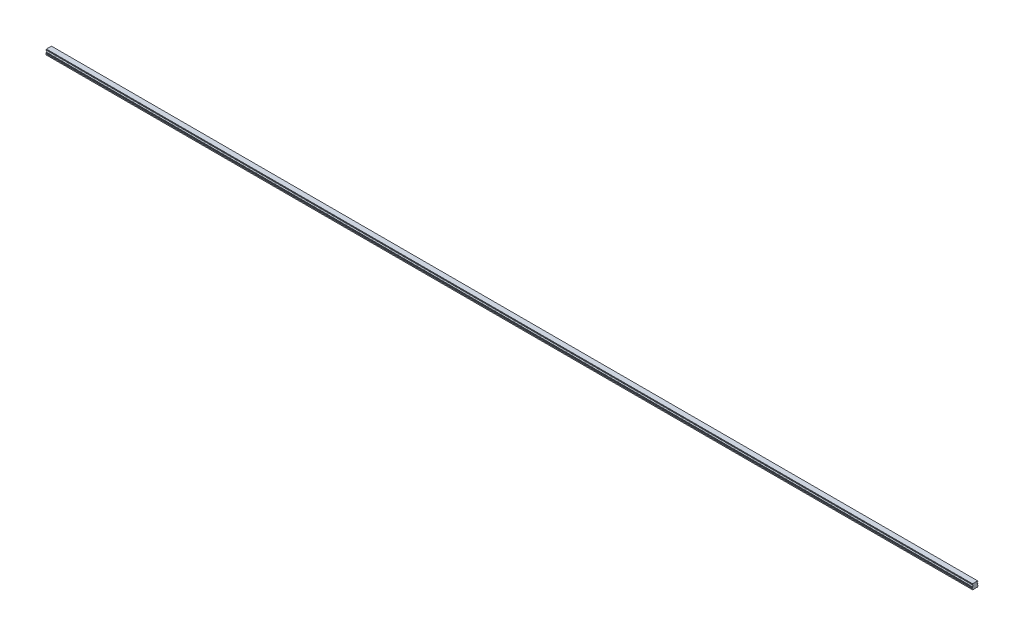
ISO-10303-21;
HEADER;
FILE_DESCRIPTION(('STEP AP214'),'2;1');
FILE_NAME('part.step','',(''),(''),'','','');
FILE_SCHEMA(('AUTOMOTIVE_DESIGN { 1 0 10303 214 1 1 1 1 }'));
ENDSEC;
DATA;
#1=APPLICATION_CONTEXT('core data for automotive mechanical design processes');
#2=APPLICATION_PROTOCOL_DEFINITION('international standard','automotive_design',2000,#1);
#3=PRODUCT_CONTEXT('',#1,'mechanical');
#4=PRODUCT('Part','Part','',(#3));
#5=PRODUCT_RELATED_PRODUCT_CATEGORY('part','',(#4));
#6=PRODUCT_DEFINITION_FORMATION('','',#4);
#7=PRODUCT_DEFINITION_CONTEXT('part definition',#1,'design');
#8=PRODUCT_DEFINITION('design','',#6,#7);
#9=PRODUCT_DEFINITION_SHAPE('','',#8);
#10=(LENGTH_UNIT() NAMED_UNIT(*) SI_UNIT(.MILLI.,.METRE.));
#11=(NAMED_UNIT(*) PLANE_ANGLE_UNIT() SI_UNIT($,.RADIAN.));
#12=(NAMED_UNIT(*) SI_UNIT($,.STERADIAN.) SOLID_ANGLE_UNIT());
#13=UNCERTAINTY_MEASURE_WITH_UNIT(LENGTH_MEASURE(1.E-05),#10,'distance_accuracy_value','');
#14=(GEOMETRIC_REPRESENTATION_CONTEXT(3) GLOBAL_UNCERTAINTY_ASSIGNED_CONTEXT((#13)) GLOBAL_UNIT_ASSIGNED_CONTEXT((#10,
#11,#12)) REPRESENTATION_CONTEXT('',''));
#15=CARTESIAN_POINT('',(0.,0.,0.));
#16=DIRECTION('',(0.,0.,1.));
#17=DIRECTION('',(1.,0.,0.));
#18=AXIS2_PLACEMENT_3D('',#15,#16,#17);
#19=CARTESIAN_POINT('',(2370.,0.399999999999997,0.));
#20=DIRECTION('',(0.,-1.,0.));
#21=DIRECTION('',(0.,0.,-1.));
#22=AXIS2_PLACEMENT_3D('',#19,#20,#21);
#23=CONICAL_SURFACE('',#22,2.89999999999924,0.785398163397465);
#24=CARTESIAN_POINT('',(2370.,0.79999999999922,0.));
#25=DIRECTION('',(0.,1.,0.));
#26=DIRECTION('',(0.,0.,1.));
#27=AXIS2_PLACEMENT_3D('',#24,#25,#26);
#28=CIRCLE('',#27,2.5);
#29=CARTESIAN_POINT('',(2370.,0.799999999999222,2.5));
#30=VERTEX_POINT('',#29);
#31=EDGE_CURVE('E11',#30,#30,#28,.F.);
#32=ORIENTED_EDGE('',*,*,#31,.F.);
#33=EDGE_LOOP('',(#32));
#34=FACE_BOUND('',#33,.T.);
#35=CARTESIAN_POINT('',(2370.,0.399999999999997,0.));
#36=DIRECTION('',(0.,1.,0.));
#37=DIRECTION('',(0.,0.,1.));
#38=AXIS2_PLACEMENT_3D('',#35,#36,#37);
#39=CIRCLE('',#38,2.89999999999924);
#40=CARTESIAN_POINT('',(2370.,0.399999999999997,2.89999999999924));
#41=VERTEX_POINT('',#40);
#42=EDGE_CURVE('E877',#41,#41,#39,.T.);
#43=ORIENTED_EDGE('',*,*,#42,.F.);
#44=EDGE_LOOP('',(#43));
#45=FACE_BOUND('',#44,.T.);
#46=ADVANCED_FACE('F39',(#34,#45),#23,.F.);
#47=CARTESIAN_POINT('',(2370.,7.,0.));
#48=DIRECTION('',(0.,-1.,0.));
#49=DIRECTION('',(0.,0.,-1.));
#50=AXIS2_PLACEMENT_3D('',#47,#48,#49);
#51=CYLINDRICAL_SURFACE('',#50,2.5);
#52=ORIENTED_EDGE('',*,*,#31,.T.);
#53=EDGE_LOOP('',(#52));
#54=FACE_BOUND('',#53,.T.);
#55=CARTESIAN_POINT('',(2370.,7.,0.));
#56=DIRECTION('',(0.,-1.,0.));
#57=DIRECTION('',(0.,0.,-1.));
#58=AXIS2_PLACEMENT_3D('',#55,#56,#57);
#59=CIRCLE('',#58,2.5);
#60=CARTESIAN_POINT('',(2370.,7.,-2.50000000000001));
#61=VERTEX_POINT('',#60);
#62=EDGE_CURVE('E49',#61,#61,#59,.T.);
#63=ORIENTED_EDGE('',*,*,#62,.F.);
#64=EDGE_LOOP('',(#63));
#65=FACE_BOUND('',#64,.T.);
#66=ADVANCED_FACE('F1262',(#54,#65),#51,.F.);
#67=CARTESIAN_POINT('',(2370.,7.,0.));
#68=DIRECTION('',(0.,-1.,0.));
#69=DIRECTION('',(0.,0.,-1.));
#70=AXIS2_PLACEMENT_3D('',#67,#68,#69);
#71=PLANE('',#70);
#72=CARTESIAN_POINT('',(2370.,7.,0.));
#73=DIRECTION('',(0.,-1.,0.));
#74=DIRECTION('',(0.,0.,-1.));
#75=AXIS2_PLACEMENT_3D('',#72,#73,#74);
#76=CIRCLE('',#75,2.1);
#77=CARTESIAN_POINT('',(2370.,7.,-2.1));
#78=VERTEX_POINT('',#77);
#79=EDGE_CURVE('E42',#78,#78,#76,.T.);
#80=ORIENTED_EDGE('',*,*,#79,.F.);
#81=EDGE_LOOP('',(#80));
#82=FACE_BOUND('',#81,.T.);
#83=ORIENTED_EDGE('',*,*,#62,.T.);
#84=EDGE_LOOP('',(#83));
#85=FACE_BOUND('',#84,.T.);
#86=ADVANCED_FACE('F1267',(#82,#85),#71,.T.);
#87=CARTESIAN_POINT('',(2310.,0.399999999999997,0.));
#88=DIRECTION('',(0.,-1.,0.));
#89=DIRECTION('',(0.,0.,-1.));
#90=AXIS2_PLACEMENT_3D('',#87,#88,#89);
#91=CONICAL_SURFACE('',#90,2.89999999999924,0.785398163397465);
#92=CARTESIAN_POINT('',(2310.,0.79999999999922,0.));
#93=DIRECTION('',(0.,1.,0.));
#94=DIRECTION('',(0.,0.,1.));
#95=AXIS2_PLACEMENT_3D('',#92,#93,#94);
#96=CIRCLE('',#95,2.5);
#97=CARTESIAN_POINT('',(2310.,0.799999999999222,2.5));
#98=VERTEX_POINT('',#97);
#99=EDGE_CURVE('E873',#98,#98,#96,.F.);
#100=ORIENTED_EDGE('',*,*,#99,.F.);
#101=EDGE_LOOP('',(#100));
#102=FACE_BOUND('',#101,.T.);
#103=CARTESIAN_POINT('',(2310.,0.399999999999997,0.));
#104=DIRECTION('',(0.,1.,0.));
#105=DIRECTION('',(0.,0.,1.));
#106=AXIS2_PLACEMENT_3D('',#103,#104,#105);
#107=CIRCLE('',#106,2.89999999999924);
#108=CARTESIAN_POINT('',(2310.,0.399999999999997,2.89999999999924));
#109=VERTEX_POINT('',#108);
#110=EDGE_CURVE('E865',#109,#109,#107,.T.);
#111=ORIENTED_EDGE('',*,*,#110,.F.);
#112=EDGE_LOOP('',(#111));
#113=FACE_BOUND('',#112,.T.);
#114=ADVANCED_FACE('F1786',(#102,#113),#91,.F.);
#115=CARTESIAN_POINT('',(2310.,7.,0.));
#116=DIRECTION('',(0.,-1.,0.));
#117=DIRECTION('',(0.,0.,-1.));
#118=AXIS2_PLACEMENT_3D('',#115,#116,#117);
#119=CYLINDRICAL_SURFACE('',#118,2.5);
#120=ORIENTED_EDGE('',*,*,#99,.T.);
#121=EDGE_LOOP('',(#120));
#122=FACE_BOUND('',#121,.T.);
#123=CARTESIAN_POINT('',(2310.,7.,0.));
#124=DIRECTION('',(0.,-1.,0.));
#125=DIRECTION('',(0.,0.,-1.));
#126=AXIS2_PLACEMENT_3D('',#123,#124,#125);
#127=CIRCLE('',#126,2.5);
#128=CARTESIAN_POINT('',(2310.,7.,-2.50000000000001));
#129=VERTEX_POINT('',#128);
#130=EDGE_CURVE('E869',#129,#129,#127,.T.);
#131=ORIENTED_EDGE('',*,*,#130,.F.);
#132=EDGE_LOOP('',(#131));
#133=FACE_BOUND('',#132,.T.);
#134=ADVANCED_FACE('F1782',(#122,#133),#119,.F.);
#135=CARTESIAN_POINT('',(2310.,7.,0.));
#136=DIRECTION('',(0.,-1.,0.));
#137=DIRECTION('',(0.,0.,-1.));
#138=AXIS2_PLACEMENT_3D('',#135,#136,#137);
#139=PLANE('',#138);
#140=CARTESIAN_POINT('',(2310.,7.,0.));
#141=DIRECTION('',(0.,-1.,0.));
#142=DIRECTION('',(0.,0.,-1.));
#143=AXIS2_PLACEMENT_3D('',#140,#141,#142);
#144=CIRCLE('',#143,2.1);
#145=CARTESIAN_POINT('',(2310.,7.,-2.1));
#146=VERTEX_POINT('',#145);
#147=EDGE_CURVE('E1032',#146,#146,#144,.T.);
#148=ORIENTED_EDGE('',*,*,#147,.F.);
#149=EDGE_LOOP('',(#148));
#150=FACE_BOUND('',#149,.T.);
#151=ORIENTED_EDGE('',*,*,#130,.T.);
#152=EDGE_LOOP('',(#151));
#153=FACE_BOUND('',#152,.T.);
#154=ADVANCED_FACE('F1778',(#150,#153),#139,.T.);
#155=CARTESIAN_POINT('',(2250.,0.399999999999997,0.));
#156=DIRECTION('',(0.,-1.,0.));
#157=DIRECTION('',(0.,0.,-1.));
#158=AXIS2_PLACEMENT_3D('',#155,#156,#157);
#159=CONICAL_SURFACE('',#158,2.89999999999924,0.785398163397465);
#160=CARTESIAN_POINT('',(2250.,0.79999999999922,0.));
#161=DIRECTION('',(0.,1.,0.));
#162=DIRECTION('',(0.,0.,1.));
#163=AXIS2_PLACEMENT_3D('',#160,#161,#162);
#164=CIRCLE('',#163,2.5);
#165=CARTESIAN_POINT('',(2250.,0.799999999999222,2.5));
#166=VERTEX_POINT('',#165);
#167=EDGE_CURVE('E861',#166,#166,#164,.F.);
#168=ORIENTED_EDGE('',*,*,#167,.F.);
#169=EDGE_LOOP('',(#168));
#170=FACE_BOUND('',#169,.T.);
#171=CARTESIAN_POINT('',(2250.,0.399999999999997,0.));
#172=DIRECTION('',(0.,1.,0.));
#173=DIRECTION('',(0.,0.,1.));
#174=AXIS2_PLACEMENT_3D('',#171,#172,#173);
#175=CIRCLE('',#174,2.89999999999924);
#176=CARTESIAN_POINT('',(2250.,0.399999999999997,2.89999999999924));
#177=VERTEX_POINT('',#176);
#178=EDGE_CURVE('E853',#177,#177,#175,.T.);
#179=ORIENTED_EDGE('',*,*,#178,.F.);
#180=EDGE_LOOP('',(#179));
#181=FACE_BOUND('',#180,.T.);
#182=ADVANCED_FACE('F1774',(#170,#181),#159,.F.);
#183=CARTESIAN_POINT('',(2250.,7.,0.));
#184=DIRECTION('',(0.,-1.,0.));
#185=DIRECTION('',(0.,0.,-1.));
#186=AXIS2_PLACEMENT_3D('',#183,#184,#185);
#187=CYLINDRICAL_SURFACE('',#186,2.5);
#188=ORIENTED_EDGE('',*,*,#167,.T.);
#189=EDGE_LOOP('',(#188));
#190=FACE_BOUND('',#189,.T.);
#191=CARTESIAN_POINT('',(2250.,7.,0.));
#192=DIRECTION('',(0.,-1.,0.));
#193=DIRECTION('',(0.,0.,-1.));
#194=AXIS2_PLACEMENT_3D('',#191,#192,#193);
#195=CIRCLE('',#194,2.5);
#196=CARTESIAN_POINT('',(2250.,7.,-2.50000000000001));
#197=VERTEX_POINT('',#196);
#198=EDGE_CURVE('E857',#197,#197,#195,.T.);
#199=ORIENTED_EDGE('',*,*,#198,.F.);
#200=EDGE_LOOP('',(#199));
#201=FACE_BOUND('',#200,.T.);
#202=ADVANCED_FACE('F1770',(#190,#201),#187,.F.);
#203=CARTESIAN_POINT('',(2250.,7.,0.));
#204=DIRECTION('',(0.,-1.,0.));
#205=DIRECTION('',(0.,0.,-1.));
#206=AXIS2_PLACEMENT_3D('',#203,#204,#205);
#207=PLANE('',#206);
#208=CARTESIAN_POINT('',(2250.,7.,0.));
#209=DIRECTION('',(0.,-1.,0.));
#210=DIRECTION('',(0.,0.,-1.));
#211=AXIS2_PLACEMENT_3D('',#208,#209,#210);
#212=CIRCLE('',#211,2.1);
#213=CARTESIAN_POINT('',(2250.,7.,-2.1));
#214=VERTEX_POINT('',#213);
#215=EDGE_CURVE('E1029',#214,#214,#212,.T.);
#216=ORIENTED_EDGE('',*,*,#215,.F.);
#217=EDGE_LOOP('',(#216));
#218=FACE_BOUND('',#217,.T.);
#219=ORIENTED_EDGE('',*,*,#198,.T.);
#220=EDGE_LOOP('',(#219));
#221=FACE_BOUND('',#220,.T.);
#222=ADVANCED_FACE('F1766',(#218,#221),#207,.T.);
#223=CARTESIAN_POINT('',(2190.,0.399999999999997,0.));
#224=DIRECTION('',(0.,-1.,0.));
#225=DIRECTION('',(0.,0.,-1.));
#226=AXIS2_PLACEMENT_3D('',#223,#224,#225);
#227=CONICAL_SURFACE('',#226,2.89999999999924,0.785398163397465);
#228=CARTESIAN_POINT('',(2190.,0.79999999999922,0.));
#229=DIRECTION('',(0.,1.,0.));
#230=DIRECTION('',(0.,0.,1.));
#231=AXIS2_PLACEMENT_3D('',#228,#229,#230);
#232=CIRCLE('',#231,2.5);
#233=CARTESIAN_POINT('',(2190.,0.799999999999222,2.5));
#234=VERTEX_POINT('',#233);
#235=EDGE_CURVE('E849',#234,#234,#232,.F.);
#236=ORIENTED_EDGE('',*,*,#235,.F.);
#237=EDGE_LOOP('',(#236));
#238=FACE_BOUND('',#237,.T.);
#239=CARTESIAN_POINT('',(2190.,0.399999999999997,0.));
#240=DIRECTION('',(0.,1.,0.));
#241=DIRECTION('',(0.,0.,1.));
#242=AXIS2_PLACEMENT_3D('',#239,#240,#241);
#243=CIRCLE('',#242,2.89999999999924);
#244=CARTESIAN_POINT('',(2190.,0.399999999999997,2.89999999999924));
#245=VERTEX_POINT('',#244);
#246=EDGE_CURVE('E841',#245,#245,#243,.T.);
#247=ORIENTED_EDGE('',*,*,#246,.F.);
#248=EDGE_LOOP('',(#247));
#249=FACE_BOUND('',#248,.T.);
#250=ADVANCED_FACE('F1762',(#238,#249),#227,.F.);
#251=CARTESIAN_POINT('',(2190.,7.,0.));
#252=DIRECTION('',(0.,-1.,0.));
#253=DIRECTION('',(0.,0.,-1.));
#254=AXIS2_PLACEMENT_3D('',#251,#252,#253);
#255=CYLINDRICAL_SURFACE('',#254,2.5);
#256=ORIENTED_EDGE('',*,*,#235,.T.);
#257=EDGE_LOOP('',(#256));
#258=FACE_BOUND('',#257,.T.);
#259=CARTESIAN_POINT('',(2190.,7.,0.));
#260=DIRECTION('',(0.,-1.,0.));
#261=DIRECTION('',(0.,0.,-1.));
#262=AXIS2_PLACEMENT_3D('',#259,#260,#261);
#263=CIRCLE('',#262,2.5);
#264=CARTESIAN_POINT('',(2190.,7.,-2.50000000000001));
#265=VERTEX_POINT('',#264);
#266=EDGE_CURVE('E845',#265,#265,#263,.T.);
#267=ORIENTED_EDGE('',*,*,#266,.F.);
#268=EDGE_LOOP('',(#267));
#269=FACE_BOUND('',#268,.T.);
#270=ADVANCED_FACE('F1758',(#258,#269),#255,.F.);
#271=CARTESIAN_POINT('',(2190.,7.,0.));
#272=DIRECTION('',(0.,-1.,0.));
#273=DIRECTION('',(0.,0.,-1.));
#274=AXIS2_PLACEMENT_3D('',#271,#272,#273);
#275=PLANE('',#274);
#276=CARTESIAN_POINT('',(2190.,7.,0.));
#277=DIRECTION('',(0.,-1.,0.));
#278=DIRECTION('',(0.,0.,-1.));
#279=AXIS2_PLACEMENT_3D('',#276,#277,#278);
#280=CIRCLE('',#279,2.1);
#281=CARTESIAN_POINT('',(2190.,7.,-2.1));
#282=VERTEX_POINT('',#281);
#283=EDGE_CURVE('E1025',#282,#282,#280,.T.);
#284=ORIENTED_EDGE('',*,*,#283,.F.);
#285=EDGE_LOOP('',(#284));
#286=FACE_BOUND('',#285,.T.);
#287=ORIENTED_EDGE('',*,*,#266,.T.);
#288=EDGE_LOOP('',(#287));
#289=FACE_BOUND('',#288,.T.);
#290=ADVANCED_FACE('F1754',(#286,#289),#275,.T.);
#291=CARTESIAN_POINT('',(2130.,0.399999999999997,0.));
#292=DIRECTION('',(0.,-1.,0.));
#293=DIRECTION('',(0.,0.,-1.));
#294=AXIS2_PLACEMENT_3D('',#291,#292,#293);
#295=CONICAL_SURFACE('',#294,2.89999999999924,0.785398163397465);
#296=CARTESIAN_POINT('',(2130.,0.79999999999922,0.));
#297=DIRECTION('',(0.,1.,0.));
#298=DIRECTION('',(0.,0.,1.));
#299=AXIS2_PLACEMENT_3D('',#296,#297,#298);
#300=CIRCLE('',#299,2.5);
#301=CARTESIAN_POINT('',(2130.,0.799999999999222,2.5));
#302=VERTEX_POINT('',#301);
#303=EDGE_CURVE('E837',#302,#302,#300,.F.);
#304=ORIENTED_EDGE('',*,*,#303,.F.);
#305=EDGE_LOOP('',(#304));
#306=FACE_BOUND('',#305,.T.);
#307=CARTESIAN_POINT('',(2130.,0.399999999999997,0.));
#308=DIRECTION('',(0.,1.,0.));
#309=DIRECTION('',(0.,0.,1.));
#310=AXIS2_PLACEMENT_3D('',#307,#308,#309);
#311=CIRCLE('',#310,2.89999999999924);
#312=CARTESIAN_POINT('',(2130.,0.399999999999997,2.89999999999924));
#313=VERTEX_POINT('',#312);
#314=EDGE_CURVE('E829',#313,#313,#311,.T.);
#315=ORIENTED_EDGE('',*,*,#314,.F.);
#316=EDGE_LOOP('',(#315));
#317=FACE_BOUND('',#316,.T.);
#318=ADVANCED_FACE('F1750',(#306,#317),#295,.F.);
#319=CARTESIAN_POINT('',(2130.,7.,0.));
#320=DIRECTION('',(0.,-1.,0.));
#321=DIRECTION('',(0.,0.,-1.));
#322=AXIS2_PLACEMENT_3D('',#319,#320,#321);
#323=CYLINDRICAL_SURFACE('',#322,2.5);
#324=ORIENTED_EDGE('',*,*,#303,.T.);
#325=EDGE_LOOP('',(#324));
#326=FACE_BOUND('',#325,.T.);
#327=CARTESIAN_POINT('',(2130.,7.,0.));
#328=DIRECTION('',(0.,-1.,0.));
#329=DIRECTION('',(0.,0.,-1.));
#330=AXIS2_PLACEMENT_3D('',#327,#328,#329);
#331=CIRCLE('',#330,2.5);
#332=CARTESIAN_POINT('',(2130.,7.,-2.50000000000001));
#333=VERTEX_POINT('',#332);
#334=EDGE_CURVE('E833',#333,#333,#331,.T.);
#335=ORIENTED_EDGE('',*,*,#334,.F.);
#336=EDGE_LOOP('',(#335));
#337=FACE_BOUND('',#336,.T.);
#338=ADVANCED_FACE('F1746',(#326,#337),#323,.F.);
#339=CARTESIAN_POINT('',(2130.,7.,0.));
#340=DIRECTION('',(0.,-1.,0.));
#341=DIRECTION('',(0.,0.,-1.));
#342=AXIS2_PLACEMENT_3D('',#339,#340,#341);
#343=PLANE('',#342);
#344=CARTESIAN_POINT('',(2130.,7.,0.));
#345=DIRECTION('',(0.,-1.,0.));
#346=DIRECTION('',(0.,0.,-1.));
#347=AXIS2_PLACEMENT_3D('',#344,#345,#346);
#348=CIRCLE('',#347,2.1);
#349=CARTESIAN_POINT('',(2130.,7.,-2.1));
#350=VERTEX_POINT('',#349);
#351=EDGE_CURVE('E1021',#350,#350,#348,.T.);
#352=ORIENTED_EDGE('',*,*,#351,.F.);
#353=EDGE_LOOP('',(#352));
#354=FACE_BOUND('',#353,.T.);
#355=ORIENTED_EDGE('',*,*,#334,.T.);
#356=EDGE_LOOP('',(#355));
#357=FACE_BOUND('',#356,.T.);
#358=ADVANCED_FACE('F1742',(#354,#357),#343,.T.);
#359=CARTESIAN_POINT('',(2070.,0.399999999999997,0.));
#360=DIRECTION('',(0.,-1.,0.));
#361=DIRECTION('',(0.,0.,-1.));
#362=AXIS2_PLACEMENT_3D('',#359,#360,#361);
#363=CONICAL_SURFACE('',#362,2.89999999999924,0.785398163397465);
#364=CARTESIAN_POINT('',(2070.,0.79999999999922,0.));
#365=DIRECTION('',(0.,1.,0.));
#366=DIRECTION('',(0.,0.,1.));
#367=AXIS2_PLACEMENT_3D('',#364,#365,#366);
#368=CIRCLE('',#367,2.5);
#369=CARTESIAN_POINT('',(2070.,0.799999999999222,2.5));
#370=VERTEX_POINT('',#369);
#371=EDGE_CURVE('E825',#370,#370,#368,.F.);
#372=ORIENTED_EDGE('',*,*,#371,.F.);
#373=EDGE_LOOP('',(#372));
#374=FACE_BOUND('',#373,.T.);
#375=CARTESIAN_POINT('',(2070.,0.399999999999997,0.));
#376=DIRECTION('',(0.,1.,0.));
#377=DIRECTION('',(0.,0.,1.));
#378=AXIS2_PLACEMENT_3D('',#375,#376,#377);
#379=CIRCLE('',#378,2.89999999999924);
#380=CARTESIAN_POINT('',(2070.,0.399999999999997,2.89999999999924));
#381=VERTEX_POINT('',#380);
#382=EDGE_CURVE('E817',#381,#381,#379,.T.);
#383=ORIENTED_EDGE('',*,*,#382,.F.);
#384=EDGE_LOOP('',(#383));
#385=FACE_BOUND('',#384,.T.);
#386=ADVANCED_FACE('F1738',(#374,#385),#363,.F.);
#387=CARTESIAN_POINT('',(2070.,7.,0.));
#388=DIRECTION('',(0.,-1.,0.));
#389=DIRECTION('',(0.,0.,-1.));
#390=AXIS2_PLACEMENT_3D('',#387,#388,#389);
#391=CYLINDRICAL_SURFACE('',#390,2.5);
#392=ORIENTED_EDGE('',*,*,#371,.T.);
#393=EDGE_LOOP('',(#392));
#394=FACE_BOUND('',#393,.T.);
#395=CARTESIAN_POINT('',(2070.,7.,0.));
#396=DIRECTION('',(0.,-1.,0.));
#397=DIRECTION('',(0.,0.,-1.));
#398=AXIS2_PLACEMENT_3D('',#395,#396,#397);
#399=CIRCLE('',#398,2.5);
#400=CARTESIAN_POINT('',(2070.,7.,-2.50000000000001));
#401=VERTEX_POINT('',#400);
#402=EDGE_CURVE('E821',#401,#401,#399,.T.);
#403=ORIENTED_EDGE('',*,*,#402,.F.);
#404=EDGE_LOOP('',(#403));
#405=FACE_BOUND('',#404,.T.);
#406=ADVANCED_FACE('F1734',(#394,#405),#391,.F.);
#407=CARTESIAN_POINT('',(2070.,7.,0.));
#408=DIRECTION('',(0.,-1.,0.));
#409=DIRECTION('',(0.,0.,-1.));
#410=AXIS2_PLACEMENT_3D('',#407,#408,#409);
#411=PLANE('',#410);
#412=CARTESIAN_POINT('',(2070.,7.,0.));
#413=DIRECTION('',(0.,-1.,0.));
#414=DIRECTION('',(0.,0.,-1.));
#415=AXIS2_PLACEMENT_3D('',#412,#413,#414);
#416=CIRCLE('',#415,2.1);
#417=CARTESIAN_POINT('',(2070.,7.,-2.1));
#418=VERTEX_POINT('',#417);
#419=EDGE_CURVE('E1017',#418,#418,#416,.T.);
#420=ORIENTED_EDGE('',*,*,#419,.F.);
#421=EDGE_LOOP('',(#420));
#422=FACE_BOUND('',#421,.T.);
#423=ORIENTED_EDGE('',*,*,#402,.T.);
#424=EDGE_LOOP('',(#423));
#425=FACE_BOUND('',#424,.T.);
#426=ADVANCED_FACE('F1730',(#422,#425),#411,.T.);
#427=CARTESIAN_POINT('',(2010.,0.399999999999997,0.));
#428=DIRECTION('',(0.,-1.,0.));
#429=DIRECTION('',(0.,0.,-1.));
#430=AXIS2_PLACEMENT_3D('',#427,#428,#429);
#431=CONICAL_SURFACE('',#430,2.89999999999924,0.785398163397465);
#432=CARTESIAN_POINT('',(2010.,0.79999999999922,0.));
#433=DIRECTION('',(0.,1.,0.));
#434=DIRECTION('',(0.,0.,1.));
#435=AXIS2_PLACEMENT_3D('',#432,#433,#434);
#436=CIRCLE('',#435,2.5);
#437=CARTESIAN_POINT('',(2010.,0.799999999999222,2.5));
#438=VERTEX_POINT('',#437);
#439=EDGE_CURVE('E813',#438,#438,#436,.F.);
#440=ORIENTED_EDGE('',*,*,#439,.F.);
#441=EDGE_LOOP('',(#440));
#442=FACE_BOUND('',#441,.T.);
#443=CARTESIAN_POINT('',(2010.,0.399999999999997,0.));
#444=DIRECTION('',(0.,1.,0.));
#445=DIRECTION('',(0.,0.,1.));
#446=AXIS2_PLACEMENT_3D('',#443,#444,#445);
#447=CIRCLE('',#446,2.89999999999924);
#448=CARTESIAN_POINT('',(2010.,0.399999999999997,2.89999999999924));
#449=VERTEX_POINT('',#448);
#450=EDGE_CURVE('E805',#449,#449,#447,.T.);
#451=ORIENTED_EDGE('',*,*,#450,.F.);
#452=EDGE_LOOP('',(#451));
#453=FACE_BOUND('',#452,.T.);
#454=ADVANCED_FACE('F1726',(#442,#453),#431,.F.);
#455=CARTESIAN_POINT('',(2010.,7.,0.));
#456=DIRECTION('',(0.,-1.,0.));
#457=DIRECTION('',(0.,0.,-1.));
#458=AXIS2_PLACEMENT_3D('',#455,#456,#457);
#459=CYLINDRICAL_SURFACE('',#458,2.5);
#460=ORIENTED_EDGE('',*,*,#439,.T.);
#461=EDGE_LOOP('',(#460));
#462=FACE_BOUND('',#461,.T.);
#463=CARTESIAN_POINT('',(2010.,7.,0.));
#464=DIRECTION('',(0.,-1.,0.));
#465=DIRECTION('',(0.,0.,-1.));
#466=AXIS2_PLACEMENT_3D('',#463,#464,#465);
#467=CIRCLE('',#466,2.5);
#468=CARTESIAN_POINT('',(2010.,7.,-2.50000000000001));
#469=VERTEX_POINT('',#468);
#470=EDGE_CURVE('E809',#469,#469,#467,.T.);
#471=ORIENTED_EDGE('',*,*,#470,.F.);
#472=EDGE_LOOP('',(#471));
#473=FACE_BOUND('',#472,.T.);
#474=ADVANCED_FACE('F1722',(#462,#473),#459,.F.);
#475=CARTESIAN_POINT('',(2010.,7.,0.));
#476=DIRECTION('',(0.,-1.,0.));
#477=DIRECTION('',(0.,0.,-1.));
#478=AXIS2_PLACEMENT_3D('',#475,#476,#477);
#479=PLANE('',#478);
#480=CARTESIAN_POINT('',(2010.,7.,0.));
#481=DIRECTION('',(0.,-1.,0.));
#482=DIRECTION('',(0.,0.,-1.));
#483=AXIS2_PLACEMENT_3D('',#480,#481,#482);
#484=CIRCLE('',#483,2.1);
#485=CARTESIAN_POINT('',(2010.,7.,-2.1));
#486=VERTEX_POINT('',#485);
#487=EDGE_CURVE('E1013',#486,#486,#484,.T.);
#488=ORIENTED_EDGE('',*,*,#487,.F.);
#489=EDGE_LOOP('',(#488));
#490=FACE_BOUND('',#489,.T.);
#491=ORIENTED_EDGE('',*,*,#470,.T.);
#492=EDGE_LOOP('',(#491));
#493=FACE_BOUND('',#492,.T.);
#494=ADVANCED_FACE('F1718',(#490,#493),#479,.T.);
#495=CARTESIAN_POINT('',(1950.,0.399999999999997,0.));
#496=DIRECTION('',(0.,-1.,0.));
#497=DIRECTION('',(0.,0.,-1.));
#498=AXIS2_PLACEMENT_3D('',#495,#496,#497);
#499=CONICAL_SURFACE('',#498,2.89999999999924,0.785398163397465);
#500=CARTESIAN_POINT('',(1950.,0.79999999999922,0.));
#501=DIRECTION('',(0.,1.,0.));
#502=DIRECTION('',(0.,0.,1.));
#503=AXIS2_PLACEMENT_3D('',#500,#501,#502);
#504=CIRCLE('',#503,2.5);
#505=CARTESIAN_POINT('',(1950.,0.799999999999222,2.5));
#506=VERTEX_POINT('',#505);
#507=EDGE_CURVE('E801',#506,#506,#504,.F.);
#508=ORIENTED_EDGE('',*,*,#507,.F.);
#509=EDGE_LOOP('',(#508));
#510=FACE_BOUND('',#509,.T.);
#511=CARTESIAN_POINT('',(1950.,0.399999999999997,0.));
#512=DIRECTION('',(0.,1.,0.));
#513=DIRECTION('',(0.,0.,1.));
#514=AXIS2_PLACEMENT_3D('',#511,#512,#513);
#515=CIRCLE('',#514,2.89999999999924);
#516=CARTESIAN_POINT('',(1950.,0.399999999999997,2.89999999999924));
#517=VERTEX_POINT('',#516);
#518=EDGE_CURVE('E793',#517,#517,#515,.T.);
#519=ORIENTED_EDGE('',*,*,#518,.F.);
#520=EDGE_LOOP('',(#519));
#521=FACE_BOUND('',#520,.T.);
#522=ADVANCED_FACE('F1714',(#510,#521),#499,.F.);
#523=CARTESIAN_POINT('',(1950.,7.,0.));
#524=DIRECTION('',(0.,-1.,0.));
#525=DIRECTION('',(0.,0.,-1.));
#526=AXIS2_PLACEMENT_3D('',#523,#524,#525);
#527=CYLINDRICAL_SURFACE('',#526,2.5);
#528=ORIENTED_EDGE('',*,*,#507,.T.);
#529=EDGE_LOOP('',(#528));
#530=FACE_BOUND('',#529,.T.);
#531=CARTESIAN_POINT('',(1950.,7.,0.));
#532=DIRECTION('',(0.,-1.,0.));
#533=DIRECTION('',(0.,0.,-1.));
#534=AXIS2_PLACEMENT_3D('',#531,#532,#533);
#535=CIRCLE('',#534,2.5);
#536=CARTESIAN_POINT('',(1950.,7.,-2.50000000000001));
#537=VERTEX_POINT('',#536);
#538=EDGE_CURVE('E797',#537,#537,#535,.T.);
#539=ORIENTED_EDGE('',*,*,#538,.F.);
#540=EDGE_LOOP('',(#539));
#541=FACE_BOUND('',#540,.T.);
#542=ADVANCED_FACE('F1710',(#530,#541),#527,.F.);
#543=CARTESIAN_POINT('',(1950.,7.,0.));
#544=DIRECTION('',(0.,-1.,0.));
#545=DIRECTION('',(0.,0.,-1.));
#546=AXIS2_PLACEMENT_3D('',#543,#544,#545);
#547=PLANE('',#546);
#548=CARTESIAN_POINT('',(1950.,7.,0.));
#549=DIRECTION('',(0.,-1.,0.));
#550=DIRECTION('',(0.,0.,-1.));
#551=AXIS2_PLACEMENT_3D('',#548,#549,#550);
#552=CIRCLE('',#551,2.1);
#553=CARTESIAN_POINT('',(1950.,7.,-2.1));
#554=VERTEX_POINT('',#553);
#555=EDGE_CURVE('E1009',#554,#554,#552,.T.);
#556=ORIENTED_EDGE('',*,*,#555,.F.);
#557=EDGE_LOOP('',(#556));
#558=FACE_BOUND('',#557,.T.);
#559=ORIENTED_EDGE('',*,*,#538,.T.);
#560=EDGE_LOOP('',(#559));
#561=FACE_BOUND('',#560,.T.);
#562=ADVANCED_FACE('F1706',(#558,#561),#547,.T.);
#563=CARTESIAN_POINT('',(1890.,0.399999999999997,0.));
#564=DIRECTION('',(0.,-1.,0.));
#565=DIRECTION('',(0.,0.,-1.));
#566=AXIS2_PLACEMENT_3D('',#563,#564,#565);
#567=CONICAL_SURFACE('',#566,2.89999999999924,0.785398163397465);
#568=CARTESIAN_POINT('',(1890.,0.79999999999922,0.));
#569=DIRECTION('',(0.,1.,0.));
#570=DIRECTION('',(0.,0.,1.));
#571=AXIS2_PLACEMENT_3D('',#568,#569,#570);
#572=CIRCLE('',#571,2.5);
#573=CARTESIAN_POINT('',(1890.,0.799999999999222,2.5));
#574=VERTEX_POINT('',#573);
#575=EDGE_CURVE('E789',#574,#574,#572,.F.);
#576=ORIENTED_EDGE('',*,*,#575,.F.);
#577=EDGE_LOOP('',(#576));
#578=FACE_BOUND('',#577,.T.);
#579=CARTESIAN_POINT('',(1890.,0.399999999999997,0.));
#580=DIRECTION('',(0.,1.,0.));
#581=DIRECTION('',(0.,0.,1.));
#582=AXIS2_PLACEMENT_3D('',#579,#580,#581);
#583=CIRCLE('',#582,2.89999999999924);
#584=CARTESIAN_POINT('',(1890.,0.399999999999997,2.89999999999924));
#585=VERTEX_POINT('',#584);
#586=EDGE_CURVE('E781',#585,#585,#583,.T.);
#587=ORIENTED_EDGE('',*,*,#586,.F.);
#588=EDGE_LOOP('',(#587));
#589=FACE_BOUND('',#588,.T.);
#590=ADVANCED_FACE('F1702',(#578,#589),#567,.F.);
#591=CARTESIAN_POINT('',(1890.,7.,0.));
#592=DIRECTION('',(0.,-1.,0.));
#593=DIRECTION('',(0.,0.,-1.));
#594=AXIS2_PLACEMENT_3D('',#591,#592,#593);
#595=CYLINDRICAL_SURFACE('',#594,2.5);
#596=ORIENTED_EDGE('',*,*,#575,.T.);
#597=EDGE_LOOP('',(#596));
#598=FACE_BOUND('',#597,.T.);
#599=CARTESIAN_POINT('',(1890.,7.,0.));
#600=DIRECTION('',(0.,-1.,0.));
#601=DIRECTION('',(0.,0.,-1.));
#602=AXIS2_PLACEMENT_3D('',#599,#600,#601);
#603=CIRCLE('',#602,2.5);
#604=CARTESIAN_POINT('',(1890.,7.,-2.50000000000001));
#605=VERTEX_POINT('',#604);
#606=EDGE_CURVE('E785',#605,#605,#603,.T.);
#607=ORIENTED_EDGE('',*,*,#606,.F.);
#608=EDGE_LOOP('',(#607));
#609=FACE_BOUND('',#608,.T.);
#610=ADVANCED_FACE('F1698',(#598,#609),#595,.F.);
#611=CARTESIAN_POINT('',(1890.,7.,0.));
#612=DIRECTION('',(0.,-1.,0.));
#613=DIRECTION('',(0.,0.,-1.));
#614=AXIS2_PLACEMENT_3D('',#611,#612,#613);
#615=PLANE('',#614);
#616=CARTESIAN_POINT('',(1890.,7.,0.));
#617=DIRECTION('',(0.,-1.,0.));
#618=DIRECTION('',(0.,0.,-1.));
#619=AXIS2_PLACEMENT_3D('',#616,#617,#618);
#620=CIRCLE('',#619,2.1);
#621=CARTESIAN_POINT('',(1890.,7.,-2.1));
#622=VERTEX_POINT('',#621);
#623=EDGE_CURVE('E1005',#622,#622,#620,.T.);
#624=ORIENTED_EDGE('',*,*,#623,.F.);
#625=EDGE_LOOP('',(#624));
#626=FACE_BOUND('',#625,.T.);
#627=ORIENTED_EDGE('',*,*,#606,.T.);
#628=EDGE_LOOP('',(#627));
#629=FACE_BOUND('',#628,.T.);
#630=ADVANCED_FACE('F1694',(#626,#629),#615,.T.);
#631=CARTESIAN_POINT('',(1830.,0.399999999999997,0.));
#632=DIRECTION('',(0.,-1.,0.));
#633=DIRECTION('',(0.,0.,-1.));
#634=AXIS2_PLACEMENT_3D('',#631,#632,#633);
#635=CONICAL_SURFACE('',#634,2.89999999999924,0.785398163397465);
#636=CARTESIAN_POINT('',(1830.,0.79999999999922,0.));
#637=DIRECTION('',(0.,1.,0.));
#638=DIRECTION('',(0.,0.,1.));
#639=AXIS2_PLACEMENT_3D('',#636,#637,#638);
#640=CIRCLE('',#639,2.5);
#641=CARTESIAN_POINT('',(1830.,0.799999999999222,2.5));
#642=VERTEX_POINT('',#641);
#643=EDGE_CURVE('E777',#642,#642,#640,.F.);
#644=ORIENTED_EDGE('',*,*,#643,.F.);
#645=EDGE_LOOP('',(#644));
#646=FACE_BOUND('',#645,.T.);
#647=CARTESIAN_POINT('',(1830.,0.399999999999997,0.));
#648=DIRECTION('',(0.,1.,0.));
#649=DIRECTION('',(0.,0.,1.));
#650=AXIS2_PLACEMENT_3D('',#647,#648,#649);
#651=CIRCLE('',#650,2.89999999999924);
#652=CARTESIAN_POINT('',(1830.,0.399999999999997,2.89999999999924));
#653=VERTEX_POINT('',#652);
#654=EDGE_CURVE('E769',#653,#653,#651,.T.);
#655=ORIENTED_EDGE('',*,*,#654,.F.);
#656=EDGE_LOOP('',(#655));
#657=FACE_BOUND('',#656,.T.);
#658=ADVANCED_FACE('F1690',(#646,#657),#635,.F.);
#659=CARTESIAN_POINT('',(1830.,7.,0.));
#660=DIRECTION('',(0.,-1.,0.));
#661=DIRECTION('',(0.,0.,-1.));
#662=AXIS2_PLACEMENT_3D('',#659,#660,#661);
#663=CYLINDRICAL_SURFACE('',#662,2.5);
#664=ORIENTED_EDGE('',*,*,#643,.T.);
#665=EDGE_LOOP('',(#664));
#666=FACE_BOUND('',#665,.T.);
#667=CARTESIAN_POINT('',(1830.,7.,0.));
#668=DIRECTION('',(0.,-1.,0.));
#669=DIRECTION('',(0.,0.,-1.));
#670=AXIS2_PLACEMENT_3D('',#667,#668,#669);
#671=CIRCLE('',#670,2.5);
#672=CARTESIAN_POINT('',(1830.,7.,-2.50000000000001));
#673=VERTEX_POINT('',#672);
#674=EDGE_CURVE('E773',#673,#673,#671,.T.);
#675=ORIENTED_EDGE('',*,*,#674,.F.);
#676=EDGE_LOOP('',(#675));
#677=FACE_BOUND('',#676,.T.);
#678=ADVANCED_FACE('F1686',(#666,#677),#663,.F.);
#679=CARTESIAN_POINT('',(1830.,7.,0.));
#680=DIRECTION('',(0.,-1.,0.));
#681=DIRECTION('',(0.,0.,-1.));
#682=AXIS2_PLACEMENT_3D('',#679,#680,#681);
#683=PLANE('',#682);
#684=CARTESIAN_POINT('',(1830.,7.,0.));
#685=DIRECTION('',(0.,-1.,0.));
#686=DIRECTION('',(0.,0.,-1.));
#687=AXIS2_PLACEMENT_3D('',#684,#685,#686);
#688=CIRCLE('',#687,2.1);
#689=CARTESIAN_POINT('',(1830.,7.,-2.1));
#690=VERTEX_POINT('',#689);
#691=EDGE_CURVE('E1001',#690,#690,#688,.T.);
#692=ORIENTED_EDGE('',*,*,#691,.F.);
#693=EDGE_LOOP('',(#692));
#694=FACE_BOUND('',#693,.T.);
#695=ORIENTED_EDGE('',*,*,#674,.T.);
#696=EDGE_LOOP('',(#695));
#697=FACE_BOUND('',#696,.T.);
#698=ADVANCED_FACE('F1682',(#694,#697),#683,.T.);
#699=CARTESIAN_POINT('',(1770.,0.399999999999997,0.));
#700=DIRECTION('',(0.,-1.,0.));
#701=DIRECTION('',(0.,0.,-1.));
#702=AXIS2_PLACEMENT_3D('',#699,#700,#701);
#703=CONICAL_SURFACE('',#702,2.89999999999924,0.785398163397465);
#704=CARTESIAN_POINT('',(1770.,0.79999999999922,0.));
#705=DIRECTION('',(0.,1.,0.));
#706=DIRECTION('',(0.,0.,1.));
#707=AXIS2_PLACEMENT_3D('',#704,#705,#706);
#708=CIRCLE('',#707,2.5);
#709=CARTESIAN_POINT('',(1770.,0.799999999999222,2.5));
#710=VERTEX_POINT('',#709);
#711=EDGE_CURVE('E765',#710,#710,#708,.F.);
#712=ORIENTED_EDGE('',*,*,#711,.F.);
#713=EDGE_LOOP('',(#712));
#714=FACE_BOUND('',#713,.T.);
#715=CARTESIAN_POINT('',(1770.,0.399999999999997,0.));
#716=DIRECTION('',(0.,1.,0.));
#717=DIRECTION('',(0.,0.,1.));
#718=AXIS2_PLACEMENT_3D('',#715,#716,#717);
#719=CIRCLE('',#718,2.89999999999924);
#720=CARTESIAN_POINT('',(1770.,0.399999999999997,2.89999999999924));
#721=VERTEX_POINT('',#720);
#722=EDGE_CURVE('E757',#721,#721,#719,.T.);
#723=ORIENTED_EDGE('',*,*,#722,.F.);
#724=EDGE_LOOP('',(#723));
#725=FACE_BOUND('',#724,.T.);
#726=ADVANCED_FACE('F1678',(#714,#725),#703,.F.);
#727=CARTESIAN_POINT('',(1770.,7.,0.));
#728=DIRECTION('',(0.,-1.,0.));
#729=DIRECTION('',(0.,0.,-1.));
#730=AXIS2_PLACEMENT_3D('',#727,#728,#729);
#731=CYLINDRICAL_SURFACE('',#730,2.5);
#732=ORIENTED_EDGE('',*,*,#711,.T.);
#733=EDGE_LOOP('',(#732));
#734=FACE_BOUND('',#733,.T.);
#735=CARTESIAN_POINT('',(1770.,7.,0.));
#736=DIRECTION('',(0.,-1.,0.));
#737=DIRECTION('',(0.,0.,-1.));
#738=AXIS2_PLACEMENT_3D('',#735,#736,#737);
#739=CIRCLE('',#738,2.5);
#740=CARTESIAN_POINT('',(1770.,7.,-2.50000000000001));
#741=VERTEX_POINT('',#740);
#742=EDGE_CURVE('E761',#741,#741,#739,.T.);
#743=ORIENTED_EDGE('',*,*,#742,.F.);
#744=EDGE_LOOP('',(#743));
#745=FACE_BOUND('',#744,.T.);
#746=ADVANCED_FACE('F1674',(#734,#745),#731,.F.);
#747=CARTESIAN_POINT('',(1770.,7.,0.));
#748=DIRECTION('',(0.,-1.,0.));
#749=DIRECTION('',(0.,0.,-1.));
#750=AXIS2_PLACEMENT_3D('',#747,#748,#749);
#751=PLANE('',#750);
#752=CARTESIAN_POINT('',(1770.,7.,0.));
#753=DIRECTION('',(0.,-1.,0.));
#754=DIRECTION('',(0.,0.,-1.));
#755=AXIS2_PLACEMENT_3D('',#752,#753,#754);
#756=CIRCLE('',#755,2.1);
#757=CARTESIAN_POINT('',(1770.,7.,-2.1));
#758=VERTEX_POINT('',#757);
#759=EDGE_CURVE('E997',#758,#758,#756,.T.);
#760=ORIENTED_EDGE('',*,*,#759,.F.);
#761=EDGE_LOOP('',(#760));
#762=FACE_BOUND('',#761,.T.);
#763=ORIENTED_EDGE('',*,*,#742,.T.);
#764=EDGE_LOOP('',(#763));
#765=FACE_BOUND('',#764,.T.);
#766=ADVANCED_FACE('F1670',(#762,#765),#751,.T.);
#767=CARTESIAN_POINT('',(1710.,0.399999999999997,0.));
#768=DIRECTION('',(0.,-1.,0.));
#769=DIRECTION('',(0.,0.,-1.));
#770=AXIS2_PLACEMENT_3D('',#767,#768,#769);
#771=CONICAL_SURFACE('',#770,2.89999999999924,0.785398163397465);
#772=CARTESIAN_POINT('',(1710.,0.79999999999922,0.));
#773=DIRECTION('',(0.,1.,0.));
#774=DIRECTION('',(0.,0.,1.));
#775=AXIS2_PLACEMENT_3D('',#772,#773,#774);
#776=CIRCLE('',#775,2.5);
#777=CARTESIAN_POINT('',(1710.,0.799999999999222,2.5));
#778=VERTEX_POINT('',#777);
#779=EDGE_CURVE('E753',#778,#778,#776,.F.);
#780=ORIENTED_EDGE('',*,*,#779,.F.);
#781=EDGE_LOOP('',(#780));
#782=FACE_BOUND('',#781,.T.);
#783=CARTESIAN_POINT('',(1710.,0.399999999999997,0.));
#784=DIRECTION('',(0.,1.,0.));
#785=DIRECTION('',(0.,0.,1.));
#786=AXIS2_PLACEMENT_3D('',#783,#784,#785);
#787=CIRCLE('',#786,2.89999999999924);
#788=CARTESIAN_POINT('',(1710.,0.399999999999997,2.89999999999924));
#789=VERTEX_POINT('',#788);
#790=EDGE_CURVE('E745',#789,#789,#787,.T.);
#791=ORIENTED_EDGE('',*,*,#790,.F.);
#792=EDGE_LOOP('',(#791));
#793=FACE_BOUND('',#792,.T.);
#794=ADVANCED_FACE('F1666',(#782,#793),#771,.F.);
#795=CARTESIAN_POINT('',(1710.,7.,0.));
#796=DIRECTION('',(0.,-1.,0.));
#797=DIRECTION('',(0.,0.,-1.));
#798=AXIS2_PLACEMENT_3D('',#795,#796,#797);
#799=CYLINDRICAL_SURFACE('',#798,2.5);
#800=ORIENTED_EDGE('',*,*,#779,.T.);
#801=EDGE_LOOP('',(#800));
#802=FACE_BOUND('',#801,.T.);
#803=CARTESIAN_POINT('',(1710.,7.,0.));
#804=DIRECTION('',(0.,-1.,0.));
#805=DIRECTION('',(0.,0.,-1.));
#806=AXIS2_PLACEMENT_3D('',#803,#804,#805);
#807=CIRCLE('',#806,2.5);
#808=CARTESIAN_POINT('',(1710.,7.,-2.50000000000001));
#809=VERTEX_POINT('',#808);
#810=EDGE_CURVE('E749',#809,#809,#807,.T.);
#811=ORIENTED_EDGE('',*,*,#810,.F.);
#812=EDGE_LOOP('',(#811));
#813=FACE_BOUND('',#812,.T.);
#814=ADVANCED_FACE('F1662',(#802,#813),#799,.F.);
#815=CARTESIAN_POINT('',(1710.,7.,0.));
#816=DIRECTION('',(0.,-1.,0.));
#817=DIRECTION('',(0.,0.,-1.));
#818=AXIS2_PLACEMENT_3D('',#815,#816,#817);
#819=PLANE('',#818);
#820=CARTESIAN_POINT('',(1710.,7.,0.));
#821=DIRECTION('',(0.,-1.,0.));
#822=DIRECTION('',(0.,0.,-1.));
#823=AXIS2_PLACEMENT_3D('',#820,#821,#822);
#824=CIRCLE('',#823,2.1);
#825=CARTESIAN_POINT('',(1710.,7.,-2.1));
#826=VERTEX_POINT('',#825);
#827=EDGE_CURVE('E993',#826,#826,#824,.T.);
#828=ORIENTED_EDGE('',*,*,#827,.F.);
#829=EDGE_LOOP('',(#828));
#830=FACE_BOUND('',#829,.T.);
#831=ORIENTED_EDGE('',*,*,#810,.T.);
#832=EDGE_LOOP('',(#831));
#833=FACE_BOUND('',#832,.T.);
#834=ADVANCED_FACE('F1658',(#830,#833),#819,.T.);
#835=CARTESIAN_POINT('',(1650.,0.399999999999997,0.));
#836=DIRECTION('',(0.,-1.,0.));
#837=DIRECTION('',(0.,0.,-1.));
#838=AXIS2_PLACEMENT_3D('',#835,#836,#837);
#839=CONICAL_SURFACE('',#838,2.89999999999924,0.785398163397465);
#840=CARTESIAN_POINT('',(1650.,0.79999999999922,0.));
#841=DIRECTION('',(0.,1.,0.));
#842=DIRECTION('',(0.,0.,1.));
#843=AXIS2_PLACEMENT_3D('',#840,#841,#842);
#844=CIRCLE('',#843,2.5);
#845=CARTESIAN_POINT('',(1650.,0.799999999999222,2.5));
#846=VERTEX_POINT('',#845);
#847=EDGE_CURVE('E741',#846,#846,#844,.F.);
#848=ORIENTED_EDGE('',*,*,#847,.F.);
#849=EDGE_LOOP('',(#848));
#850=FACE_BOUND('',#849,.T.);
#851=CARTESIAN_POINT('',(1650.,0.399999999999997,0.));
#852=DIRECTION('',(0.,1.,0.));
#853=DIRECTION('',(0.,0.,1.));
#854=AXIS2_PLACEMENT_3D('',#851,#852,#853);
#855=CIRCLE('',#854,2.89999999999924);
#856=CARTESIAN_POINT('',(1650.,0.399999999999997,2.89999999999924));
#857=VERTEX_POINT('',#856);
#858=EDGE_CURVE('E733',#857,#857,#855,.T.);
#859=ORIENTED_EDGE('',*,*,#858,.F.);
#860=EDGE_LOOP('',(#859));
#861=FACE_BOUND('',#860,.T.);
#862=ADVANCED_FACE('F1654',(#850,#861),#839,.F.);
#863=CARTESIAN_POINT('',(1650.,7.,0.));
#864=DIRECTION('',(0.,-1.,0.));
#865=DIRECTION('',(0.,0.,-1.));
#866=AXIS2_PLACEMENT_3D('',#863,#864,#865);
#867=CYLINDRICAL_SURFACE('',#866,2.5);
#868=ORIENTED_EDGE('',*,*,#847,.T.);
#869=EDGE_LOOP('',(#868));
#870=FACE_BOUND('',#869,.T.);
#871=CARTESIAN_POINT('',(1650.,7.,0.));
#872=DIRECTION('',(0.,-1.,0.));
#873=DIRECTION('',(0.,0.,-1.));
#874=AXIS2_PLACEMENT_3D('',#871,#872,#873);
#875=CIRCLE('',#874,2.5);
#876=CARTESIAN_POINT('',(1650.,7.,-2.50000000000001));
#877=VERTEX_POINT('',#876);
#878=EDGE_CURVE('E737',#877,#877,#875,.T.);
#879=ORIENTED_EDGE('',*,*,#878,.F.);
#880=EDGE_LOOP('',(#879));
#881=FACE_BOUND('',#880,.T.);
#882=ADVANCED_FACE('F1650',(#870,#881),#867,.F.);
#883=CARTESIAN_POINT('',(1650.,7.,0.));
#884=DIRECTION('',(0.,-1.,0.));
#885=DIRECTION('',(0.,0.,-1.));
#886=AXIS2_PLACEMENT_3D('',#883,#884,#885);
#887=PLANE('',#886);
#888=CARTESIAN_POINT('',(1650.,7.,0.));
#889=DIRECTION('',(0.,-1.,0.));
#890=DIRECTION('',(0.,0.,-1.));
#891=AXIS2_PLACEMENT_3D('',#888,#889,#890);
#892=CIRCLE('',#891,2.1);
#893=CARTESIAN_POINT('',(1650.,7.,-2.1));
#894=VERTEX_POINT('',#893);
#895=EDGE_CURVE('E989',#894,#894,#892,.T.);
#896=ORIENTED_EDGE('',*,*,#895,.F.);
#897=EDGE_LOOP('',(#896));
#898=FACE_BOUND('',#897,.T.);
#899=ORIENTED_EDGE('',*,*,#878,.T.);
#900=EDGE_LOOP('',(#899));
#901=FACE_BOUND('',#900,.T.);
#902=ADVANCED_FACE('F1646',(#898,#901),#887,.T.);
#903=CARTESIAN_POINT('',(1590.,0.399999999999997,0.));
#904=DIRECTION('',(0.,-1.,0.));
#905=DIRECTION('',(0.,0.,-1.));
#906=AXIS2_PLACEMENT_3D('',#903,#904,#905);
#907=CONICAL_SURFACE('',#906,2.89999999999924,0.785398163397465);
#908=CARTESIAN_POINT('',(1590.,0.79999999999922,0.));
#909=DIRECTION('',(0.,1.,0.));
#910=DIRECTION('',(0.,0.,1.));
#911=AXIS2_PLACEMENT_3D('',#908,#909,#910);
#912=CIRCLE('',#911,2.5);
#913=CARTESIAN_POINT('',(1590.,0.799999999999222,2.5));
#914=VERTEX_POINT('',#913);
#915=EDGE_CURVE('E729',#914,#914,#912,.F.);
#916=ORIENTED_EDGE('',*,*,#915,.F.);
#917=EDGE_LOOP('',(#916));
#918=FACE_BOUND('',#917,.T.);
#919=CARTESIAN_POINT('',(1590.,0.399999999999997,0.));
#920=DIRECTION('',(0.,1.,0.));
#921=DIRECTION('',(0.,0.,1.));
#922=AXIS2_PLACEMENT_3D('',#919,#920,#921);
#923=CIRCLE('',#922,2.89999999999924);
#924=CARTESIAN_POINT('',(1590.,0.399999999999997,2.89999999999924));
#925=VERTEX_POINT('',#924);
#926=EDGE_CURVE('E721',#925,#925,#923,.T.);
#927=ORIENTED_EDGE('',*,*,#926,.F.);
#928=EDGE_LOOP('',(#927));
#929=FACE_BOUND('',#928,.T.);
#930=ADVANCED_FACE('F1642',(#918,#929),#907,.F.);
#931=CARTESIAN_POINT('',(1590.,7.,0.));
#932=DIRECTION('',(0.,-1.,0.));
#933=DIRECTION('',(0.,0.,-1.));
#934=AXIS2_PLACEMENT_3D('',#931,#932,#933);
#935=CYLINDRICAL_SURFACE('',#934,2.5);
#936=ORIENTED_EDGE('',*,*,#915,.T.);
#937=EDGE_LOOP('',(#936));
#938=FACE_BOUND('',#937,.T.);
#939=CARTESIAN_POINT('',(1590.,7.,0.));
#940=DIRECTION('',(0.,-1.,0.));
#941=DIRECTION('',(0.,0.,-1.));
#942=AXIS2_PLACEMENT_3D('',#939,#940,#941);
#943=CIRCLE('',#942,2.5);
#944=CARTESIAN_POINT('',(1590.,7.,-2.50000000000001));
#945=VERTEX_POINT('',#944);
#946=EDGE_CURVE('E725',#945,#945,#943,.T.);
#947=ORIENTED_EDGE('',*,*,#946,.F.);
#948=EDGE_LOOP('',(#947));
#949=FACE_BOUND('',#948,.T.);
#950=ADVANCED_FACE('F1638',(#938,#949),#935,.F.);
#951=CARTESIAN_POINT('',(1590.,7.,0.));
#952=DIRECTION('',(0.,-1.,0.));
#953=DIRECTION('',(0.,0.,-1.));
#954=AXIS2_PLACEMENT_3D('',#951,#952,#953);
#955=PLANE('',#954);
#956=CARTESIAN_POINT('',(1590.,7.,0.));
#957=DIRECTION('',(0.,-1.,0.));
#958=DIRECTION('',(0.,0.,-1.));
#959=AXIS2_PLACEMENT_3D('',#956,#957,#958);
#960=CIRCLE('',#959,2.1);
#961=CARTESIAN_POINT('',(1590.,7.,-2.1));
#962=VERTEX_POINT('',#961);
#963=EDGE_CURVE('E985',#962,#962,#960,.T.);
#964=ORIENTED_EDGE('',*,*,#963,.F.);
#965=EDGE_LOOP('',(#964));
#966=FACE_BOUND('',#965,.T.);
#967=ORIENTED_EDGE('',*,*,#946,.T.);
#968=EDGE_LOOP('',(#967));
#969=FACE_BOUND('',#968,.T.);
#970=ADVANCED_FACE('F1634',(#966,#969),#955,.T.);
#971=CARTESIAN_POINT('',(1530.,0.399999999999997,0.));
#972=DIRECTION('',(0.,-1.,0.));
#973=DIRECTION('',(0.,0.,-1.));
#974=AXIS2_PLACEMENT_3D('',#971,#972,#973);
#975=CONICAL_SURFACE('',#974,2.89999999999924,0.785398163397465);
#976=CARTESIAN_POINT('',(1530.,0.79999999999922,0.));
#977=DIRECTION('',(0.,1.,0.));
#978=DIRECTION('',(0.,0.,1.));
#979=AXIS2_PLACEMENT_3D('',#976,#977,#978);
#980=CIRCLE('',#979,2.5);
#981=CARTESIAN_POINT('',(1530.,0.799999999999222,2.5));
#982=VERTEX_POINT('',#981);
#983=EDGE_CURVE('E717',#982,#982,#980,.F.);
#984=ORIENTED_EDGE('',*,*,#983,.F.);
#985=EDGE_LOOP('',(#984));
#986=FACE_BOUND('',#985,.T.);
#987=CARTESIAN_POINT('',(1530.,0.399999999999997,0.));
#988=DIRECTION('',(0.,1.,0.));
#989=DIRECTION('',(0.,0.,1.));
#990=AXIS2_PLACEMENT_3D('',#987,#988,#989);
#991=CIRCLE('',#990,2.89999999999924);
#992=CARTESIAN_POINT('',(1530.,0.399999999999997,2.89999999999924));
#993=VERTEX_POINT('',#992);
#994=EDGE_CURVE('E709',#993,#993,#991,.T.);
#995=ORIENTED_EDGE('',*,*,#994,.F.);
#996=EDGE_LOOP('',(#995));
#997=FACE_BOUND('',#996,.T.);
#998=ADVANCED_FACE('F1630',(#986,#997),#975,.F.);
#999=CARTESIAN_POINT('',(1530.,7.,0.));
#1000=DIRECTION('',(0.,-1.,0.));
#1001=DIRECTION('',(0.,0.,-1.));
#1002=AXIS2_PLACEMENT_3D('',#999,#1000,#1001);
#1003=CYLINDRICAL_SURFACE('',#1002,2.5);
#1004=ORIENTED_EDGE('',*,*,#983,.T.);
#1005=EDGE_LOOP('',(#1004));
#1006=FACE_BOUND('',#1005,.T.);
#1007=CARTESIAN_POINT('',(1530.,7.,0.));
#1008=DIRECTION('',(0.,-1.,0.));
#1009=DIRECTION('',(0.,0.,-1.));
#1010=AXIS2_PLACEMENT_3D('',#1007,#1008,#1009);
#1011=CIRCLE('',#1010,2.5);
#1012=CARTESIAN_POINT('',(1530.,7.,-2.50000000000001));
#1013=VERTEX_POINT('',#1012);
#1014=EDGE_CURVE('E713',#1013,#1013,#1011,.T.);
#1015=ORIENTED_EDGE('',*,*,#1014,.F.);
#1016=EDGE_LOOP('',(#1015));
#1017=FACE_BOUND('',#1016,.T.);
#1018=ADVANCED_FACE('F1626',(#1006,#1017),#1003,.F.);
#1019=CARTESIAN_POINT('',(1530.,7.,0.));
#1020=DIRECTION('',(0.,-1.,0.));
#1021=DIRECTION('',(0.,0.,-1.));
#1022=AXIS2_PLACEMENT_3D('',#1019,#1020,#1021);
#1023=PLANE('',#1022);
#1024=CARTESIAN_POINT('',(1530.,7.,0.));
#1025=DIRECTION('',(0.,-1.,0.));
#1026=DIRECTION('',(0.,0.,-1.));
#1027=AXIS2_PLACEMENT_3D('',#1024,#1025,#1026);
#1028=CIRCLE('',#1027,2.1);
#1029=CARTESIAN_POINT('',(1530.,7.,-2.1));
#1030=VERTEX_POINT('',#1029);
#1031=EDGE_CURVE('E981',#1030,#1030,#1028,.T.);
#1032=ORIENTED_EDGE('',*,*,#1031,.F.);
#1033=EDGE_LOOP('',(#1032));
#1034=FACE_BOUND('',#1033,.T.);
#1035=ORIENTED_EDGE('',*,*,#1014,.T.);
#1036=EDGE_LOOP('',(#1035));
#1037=FACE_BOUND('',#1036,.T.);
#1038=ADVANCED_FACE('F1622',(#1034,#1037),#1023,.T.);
#1039=CARTESIAN_POINT('',(1470.,0.399999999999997,0.));
#1040=DIRECTION('',(0.,-1.,0.));
#1041=DIRECTION('',(0.,0.,-1.));
#1042=AXIS2_PLACEMENT_3D('',#1039,#1040,#1041);
#1043=CONICAL_SURFACE('',#1042,2.89999999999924,0.785398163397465);
#1044=CARTESIAN_POINT('',(1470.,0.79999999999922,0.));
#1045=DIRECTION('',(0.,1.,0.));
#1046=DIRECTION('',(0.,0.,1.));
#1047=AXIS2_PLACEMENT_3D('',#1044,#1045,#1046);
#1048=CIRCLE('',#1047,2.5);
#1049=CARTESIAN_POINT('',(1470.,0.799999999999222,2.5));
#1050=VERTEX_POINT('',#1049);
#1051=EDGE_CURVE('E705',#1050,#1050,#1048,.F.);
#1052=ORIENTED_EDGE('',*,*,#1051,.F.);
#1053=EDGE_LOOP('',(#1052));
#1054=FACE_BOUND('',#1053,.T.);
#1055=CARTESIAN_POINT('',(1470.,0.399999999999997,0.));
#1056=DIRECTION('',(0.,1.,0.));
#1057=DIRECTION('',(0.,0.,1.));
#1058=AXIS2_PLACEMENT_3D('',#1055,#1056,#1057);
#1059=CIRCLE('',#1058,2.89999999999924);
#1060=CARTESIAN_POINT('',(1470.,0.399999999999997,2.89999999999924));
#1061=VERTEX_POINT('',#1060);
#1062=EDGE_CURVE('E697',#1061,#1061,#1059,.T.);
#1063=ORIENTED_EDGE('',*,*,#1062,.F.);
#1064=EDGE_LOOP('',(#1063));
#1065=FACE_BOUND('',#1064,.T.);
#1066=ADVANCED_FACE('F1618',(#1054,#1065),#1043,.F.);
#1067=CARTESIAN_POINT('',(1470.,7.,0.));
#1068=DIRECTION('',(0.,-1.,0.));
#1069=DIRECTION('',(0.,0.,-1.));
#1070=AXIS2_PLACEMENT_3D('',#1067,#1068,#1069);
#1071=CYLINDRICAL_SURFACE('',#1070,2.5);
#1072=ORIENTED_EDGE('',*,*,#1051,.T.);
#1073=EDGE_LOOP('',(#1072));
#1074=FACE_BOUND('',#1073,.T.);
#1075=CARTESIAN_POINT('',(1470.,7.,0.));
#1076=DIRECTION('',(0.,-1.,0.));
#1077=DIRECTION('',(0.,0.,-1.));
#1078=AXIS2_PLACEMENT_3D('',#1075,#1076,#1077);
#1079=CIRCLE('',#1078,2.5);
#1080=CARTESIAN_POINT('',(1470.,7.,-2.50000000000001));
#1081=VERTEX_POINT('',#1080);
#1082=EDGE_CURVE('E701',#1081,#1081,#1079,.T.);
#1083=ORIENTED_EDGE('',*,*,#1082,.F.);
#1084=EDGE_LOOP('',(#1083));
#1085=FACE_BOUND('',#1084,.T.);
#1086=ADVANCED_FACE('F1614',(#1074,#1085),#1071,.F.);
#1087=CARTESIAN_POINT('',(1470.,7.,0.));
#1088=DIRECTION('',(0.,-1.,0.));
#1089=DIRECTION('',(0.,0.,-1.));
#1090=AXIS2_PLACEMENT_3D('',#1087,#1088,#1089);
#1091=PLANE('',#1090);
#1092=CARTESIAN_POINT('',(1470.,7.,0.));
#1093=DIRECTION('',(0.,-1.,0.));
#1094=DIRECTION('',(0.,0.,-1.));
#1095=AXIS2_PLACEMENT_3D('',#1092,#1093,#1094);
#1096=CIRCLE('',#1095,2.1);
#1097=CARTESIAN_POINT('',(1470.,7.,-2.1));
#1098=VERTEX_POINT('',#1097);
#1099=EDGE_CURVE('E977',#1098,#1098,#1096,.T.);
#1100=ORIENTED_EDGE('',*,*,#1099,.F.);
#1101=EDGE_LOOP('',(#1100));
#1102=FACE_BOUND('',#1101,.T.);
#1103=ORIENTED_EDGE('',*,*,#1082,.T.);
#1104=EDGE_LOOP('',(#1103));
#1105=FACE_BOUND('',#1104,.T.);
#1106=ADVANCED_FACE('F1610',(#1102,#1105),#1091,.T.);
#1107=CARTESIAN_POINT('',(1410.,0.399999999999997,0.));
#1108=DIRECTION('',(0.,-1.,0.));
#1109=DIRECTION('',(0.,0.,-1.));
#1110=AXIS2_PLACEMENT_3D('',#1107,#1108,#1109);
#1111=CONICAL_SURFACE('',#1110,2.89999999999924,0.785398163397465);
#1112=CARTESIAN_POINT('',(1410.,0.79999999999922,0.));
#1113=DIRECTION('',(0.,1.,0.));
#1114=DIRECTION('',(0.,0.,1.));
#1115=AXIS2_PLACEMENT_3D('',#1112,#1113,#1114);
#1116=CIRCLE('',#1115,2.5);
#1117=CARTESIAN_POINT('',(1410.,0.799999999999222,2.5));
#1118=VERTEX_POINT('',#1117);
#1119=EDGE_CURVE('E693',#1118,#1118,#1116,.F.);
#1120=ORIENTED_EDGE('',*,*,#1119,.F.);
#1121=EDGE_LOOP('',(#1120));
#1122=FACE_BOUND('',#1121,.T.);
#1123=CARTESIAN_POINT('',(1410.,0.399999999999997,0.));
#1124=DIRECTION('',(0.,1.,0.));
#1125=DIRECTION('',(0.,0.,1.));
#1126=AXIS2_PLACEMENT_3D('',#1123,#1124,#1125);
#1127=CIRCLE('',#1126,2.89999999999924);
#1128=CARTESIAN_POINT('',(1410.,0.399999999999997,2.89999999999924));
#1129=VERTEX_POINT('',#1128);
#1130=EDGE_CURVE('E685',#1129,#1129,#1127,.T.);
#1131=ORIENTED_EDGE('',*,*,#1130,.F.);
#1132=EDGE_LOOP('',(#1131));
#1133=FACE_BOUND('',#1132,.T.);
#1134=ADVANCED_FACE('F1606',(#1122,#1133),#1111,.F.);
#1135=CARTESIAN_POINT('',(1410.,7.,0.));
#1136=DIRECTION('',(0.,-1.,0.));
#1137=DIRECTION('',(0.,0.,-1.));
#1138=AXIS2_PLACEMENT_3D('',#1135,#1136,#1137);
#1139=CYLINDRICAL_SURFACE('',#1138,2.5);
#1140=ORIENTED_EDGE('',*,*,#1119,.T.);
#1141=EDGE_LOOP('',(#1140));
#1142=FACE_BOUND('',#1141,.T.);
#1143=CARTESIAN_POINT('',(1410.,7.,0.));
#1144=DIRECTION('',(0.,-1.,0.));
#1145=DIRECTION('',(0.,0.,-1.));
#1146=AXIS2_PLACEMENT_3D('',#1143,#1144,#1145);
#1147=CIRCLE('',#1146,2.5);
#1148=CARTESIAN_POINT('',(1410.,7.,-2.50000000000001));
#1149=VERTEX_POINT('',#1148);
#1150=EDGE_CURVE('E689',#1149,#1149,#1147,.T.);
#1151=ORIENTED_EDGE('',*,*,#1150,.F.);
#1152=EDGE_LOOP('',(#1151));
#1153=FACE_BOUND('',#1152,.T.);
#1154=ADVANCED_FACE('F1602',(#1142,#1153),#1139,.F.);
#1155=CARTESIAN_POINT('',(1410.,7.,0.));
#1156=DIRECTION('',(0.,-1.,0.));
#1157=DIRECTION('',(0.,0.,-1.));
#1158=AXIS2_PLACEMENT_3D('',#1155,#1156,#1157);
#1159=PLANE('',#1158);
#1160=CARTESIAN_POINT('',(1410.,7.,0.));
#1161=DIRECTION('',(0.,-1.,0.));
#1162=DIRECTION('',(0.,0.,-1.));
#1163=AXIS2_PLACEMENT_3D('',#1160,#1161,#1162);
#1164=CIRCLE('',#1163,2.1);
#1165=CARTESIAN_POINT('',(1410.,7.,-2.1));
#1166=VERTEX_POINT('',#1165);
#1167=EDGE_CURVE('E973',#1166,#1166,#1164,.T.);
#1168=ORIENTED_EDGE('',*,*,#1167,.F.);
#1169=EDGE_LOOP('',(#1168));
#1170=FACE_BOUND('',#1169,.T.);
#1171=ORIENTED_EDGE('',*,*,#1150,.T.);
#1172=EDGE_LOOP('',(#1171));
#1173=FACE_BOUND('',#1172,.T.);
#1174=ADVANCED_FACE('F1598',(#1170,#1173),#1159,.T.);
#1175=CARTESIAN_POINT('',(1350.,0.399999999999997,0.));
#1176=DIRECTION('',(0.,-1.,0.));
#1177=DIRECTION('',(0.,0.,-1.));
#1178=AXIS2_PLACEMENT_3D('',#1175,#1176,#1177);
#1179=CONICAL_SURFACE('',#1178,2.89999999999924,0.785398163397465);
#1180=CARTESIAN_POINT('',(1350.,0.79999999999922,0.));
#1181=DIRECTION('',(0.,1.,0.));
#1182=DIRECTION('',(0.,0.,1.));
#1183=AXIS2_PLACEMENT_3D('',#1180,#1181,#1182);
#1184=CIRCLE('',#1183,2.5);
#1185=CARTESIAN_POINT('',(1350.,0.799999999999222,2.5));
#1186=VERTEX_POINT('',#1185);
#1187=EDGE_CURVE('E681',#1186,#1186,#1184,.F.);
#1188=ORIENTED_EDGE('',*,*,#1187,.F.);
#1189=EDGE_LOOP('',(#1188));
#1190=FACE_BOUND('',#1189,.T.);
#1191=CARTESIAN_POINT('',(1350.,0.399999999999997,0.));
#1192=DIRECTION('',(0.,1.,0.));
#1193=DIRECTION('',(0.,0.,1.));
#1194=AXIS2_PLACEMENT_3D('',#1191,#1192,#1193);
#1195=CIRCLE('',#1194,2.89999999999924);
#1196=CARTESIAN_POINT('',(1350.,0.399999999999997,2.89999999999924));
#1197=VERTEX_POINT('',#1196);
#1198=EDGE_CURVE('E673',#1197,#1197,#1195,.T.);
#1199=ORIENTED_EDGE('',*,*,#1198,.F.);
#1200=EDGE_LOOP('',(#1199));
#1201=FACE_BOUND('',#1200,.T.);
#1202=ADVANCED_FACE('F1594',(#1190,#1201),#1179,.F.);
#1203=CARTESIAN_POINT('',(1350.,7.,0.));
#1204=DIRECTION('',(0.,-1.,0.));
#1205=DIRECTION('',(0.,0.,-1.));
#1206=AXIS2_PLACEMENT_3D('',#1203,#1204,#1205);
#1207=CYLINDRICAL_SURFACE('',#1206,2.5);
#1208=ORIENTED_EDGE('',*,*,#1187,.T.);
#1209=EDGE_LOOP('',(#1208));
#1210=FACE_BOUND('',#1209,.T.);
#1211=CARTESIAN_POINT('',(1350.,7.,0.));
#1212=DIRECTION('',(0.,-1.,0.));
#1213=DIRECTION('',(0.,0.,-1.));
#1214=AXIS2_PLACEMENT_3D('',#1211,#1212,#1213);
#1215=CIRCLE('',#1214,2.5);
#1216=CARTESIAN_POINT('',(1350.,7.,-2.50000000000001));
#1217=VERTEX_POINT('',#1216);
#1218=EDGE_CURVE('E677',#1217,#1217,#1215,.T.);
#1219=ORIENTED_EDGE('',*,*,#1218,.F.);
#1220=EDGE_LOOP('',(#1219));
#1221=FACE_BOUND('',#1220,.T.);
#1222=ADVANCED_FACE('F1590',(#1210,#1221),#1207,.F.);
#1223=CARTESIAN_POINT('',(1350.,7.,0.));
#1224=DIRECTION('',(0.,-1.,0.));
#1225=DIRECTION('',(0.,0.,-1.));
#1226=AXIS2_PLACEMENT_3D('',#1223,#1224,#1225);
#1227=PLANE('',#1226);
#1228=CARTESIAN_POINT('',(1350.,7.,0.));
#1229=DIRECTION('',(0.,-1.,0.));
#1230=DIRECTION('',(0.,0.,-1.));
#1231=AXIS2_PLACEMENT_3D('',#1228,#1229,#1230);
#1232=CIRCLE('',#1231,2.1);
#1233=CARTESIAN_POINT('',(1350.,7.,-2.1));
#1234=VERTEX_POINT('',#1233);
#1235=EDGE_CURVE('E969',#1234,#1234,#1232,.T.);
#1236=ORIENTED_EDGE('',*,*,#1235,.F.);
#1237=EDGE_LOOP('',(#1236));
#1238=FACE_BOUND('',#1237,.T.);
#1239=ORIENTED_EDGE('',*,*,#1218,.T.);
#1240=EDGE_LOOP('',(#1239));
#1241=FACE_BOUND('',#1240,.T.);
#1242=ADVANCED_FACE('F1586',(#1238,#1241),#1227,.T.);
#1243=CARTESIAN_POINT('',(1290.,0.399999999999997,0.));
#1244=DIRECTION('',(0.,-1.,0.));
#1245=DIRECTION('',(0.,0.,-1.));
#1246=AXIS2_PLACEMENT_3D('',#1243,#1244,#1245);
#1247=CONICAL_SURFACE('',#1246,2.89999999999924,0.785398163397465);
#1248=CARTESIAN_POINT('',(1290.,0.79999999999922,0.));
#1249=DIRECTION('',(0.,1.,0.));
#1250=DIRECTION('',(0.,0.,1.));
#1251=AXIS2_PLACEMENT_3D('',#1248,#1249,#1250);
#1252=CIRCLE('',#1251,2.5);
#1253=CARTESIAN_POINT('',(1290.,0.799999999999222,2.5));
#1254=VERTEX_POINT('',#1253);
#1255=EDGE_CURVE('E669',#1254,#1254,#1252,.F.);
#1256=ORIENTED_EDGE('',*,*,#1255,.F.);
#1257=EDGE_LOOP('',(#1256));
#1258=FACE_BOUND('',#1257,.T.);
#1259=CARTESIAN_POINT('',(1290.,0.399999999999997,0.));
#1260=DIRECTION('',(0.,1.,0.));
#1261=DIRECTION('',(0.,0.,1.));
#1262=AXIS2_PLACEMENT_3D('',#1259,#1260,#1261);
#1263=CIRCLE('',#1262,2.89999999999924);
#1264=CARTESIAN_POINT('',(1290.,0.399999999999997,2.89999999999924));
#1265=VERTEX_POINT('',#1264);
#1266=EDGE_CURVE('E661',#1265,#1265,#1263,.T.);
#1267=ORIENTED_EDGE('',*,*,#1266,.F.);
#1268=EDGE_LOOP('',(#1267));
#1269=FACE_BOUND('',#1268,.T.);
#1270=ADVANCED_FACE('F1582',(#1258,#1269),#1247,.F.);
#1271=CARTESIAN_POINT('',(1290.,7.,0.));
#1272=DIRECTION('',(0.,-1.,0.));
#1273=DIRECTION('',(0.,0.,-1.));
#1274=AXIS2_PLACEMENT_3D('',#1271,#1272,#1273);
#1275=CYLINDRICAL_SURFACE('',#1274,2.5);
#1276=ORIENTED_EDGE('',*,*,#1255,.T.);
#1277=EDGE_LOOP('',(#1276));
#1278=FACE_BOUND('',#1277,.T.);
#1279=CARTESIAN_POINT('',(1290.,7.,0.));
#1280=DIRECTION('',(0.,-1.,0.));
#1281=DIRECTION('',(0.,0.,-1.));
#1282=AXIS2_PLACEMENT_3D('',#1279,#1280,#1281);
#1283=CIRCLE('',#1282,2.5);
#1284=CARTESIAN_POINT('',(1290.,7.,-2.50000000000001));
#1285=VERTEX_POINT('',#1284);
#1286=EDGE_CURVE('E665',#1285,#1285,#1283,.T.);
#1287=ORIENTED_EDGE('',*,*,#1286,.F.);
#1288=EDGE_LOOP('',(#1287));
#1289=FACE_BOUND('',#1288,.T.);
#1290=ADVANCED_FACE('F1578',(#1278,#1289),#1275,.F.);
#1291=CARTESIAN_POINT('',(1290.,7.,0.));
#1292=DIRECTION('',(0.,-1.,0.));
#1293=DIRECTION('',(0.,0.,-1.));
#1294=AXIS2_PLACEMENT_3D('',#1291,#1292,#1293);
#1295=PLANE('',#1294);
#1296=CARTESIAN_POINT('',(1290.,7.,0.));
#1297=DIRECTION('',(0.,-1.,0.));
#1298=DIRECTION('',(0.,0.,-1.));
#1299=AXIS2_PLACEMENT_3D('',#1296,#1297,#1298);
#1300=CIRCLE('',#1299,2.1);
#1301=CARTESIAN_POINT('',(1290.,7.,-2.1));
#1302=VERTEX_POINT('',#1301);
#1303=EDGE_CURVE('E965',#1302,#1302,#1300,.T.);
#1304=ORIENTED_EDGE('',*,*,#1303,.F.);
#1305=EDGE_LOOP('',(#1304));
#1306=FACE_BOUND('',#1305,.T.);
#1307=ORIENTED_EDGE('',*,*,#1286,.T.);
#1308=EDGE_LOOP('',(#1307));
#1309=FACE_BOUND('',#1308,.T.);
#1310=ADVANCED_FACE('F1574',(#1306,#1309),#1295,.T.);
#1311=CARTESIAN_POINT('',(1230.,0.399999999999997,0.));
#1312=DIRECTION('',(0.,-1.,0.));
#1313=DIRECTION('',(0.,0.,-1.));
#1314=AXIS2_PLACEMENT_3D('',#1311,#1312,#1313);
#1315=CONICAL_SURFACE('',#1314,2.89999999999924,0.785398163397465);
#1316=CARTESIAN_POINT('',(1230.,0.79999999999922,0.));
#1317=DIRECTION('',(0.,1.,0.));
#1318=DIRECTION('',(0.,0.,1.));
#1319=AXIS2_PLACEMENT_3D('',#1316,#1317,#1318);
#1320=CIRCLE('',#1319,2.5);
#1321=CARTESIAN_POINT('',(1230.,0.799999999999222,2.5));
#1322=VERTEX_POINT('',#1321);
#1323=EDGE_CURVE('E657',#1322,#1322,#1320,.F.);
#1324=ORIENTED_EDGE('',*,*,#1323,.F.);
#1325=EDGE_LOOP('',(#1324));
#1326=FACE_BOUND('',#1325,.T.);
#1327=CARTESIAN_POINT('',(1230.,0.399999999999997,0.));
#1328=DIRECTION('',(0.,1.,0.));
#1329=DIRECTION('',(0.,0.,1.));
#1330=AXIS2_PLACEMENT_3D('',#1327,#1328,#1329);
#1331=CIRCLE('',#1330,2.89999999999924);
#1332=CARTESIAN_POINT('',(1230.,0.399999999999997,2.89999999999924));
#1333=VERTEX_POINT('',#1332);
#1334=EDGE_CURVE('E649',#1333,#1333,#1331,.T.);
#1335=ORIENTED_EDGE('',*,*,#1334,.F.);
#1336=EDGE_LOOP('',(#1335));
#1337=FACE_BOUND('',#1336,.T.);
#1338=ADVANCED_FACE('F1570',(#1326,#1337),#1315,.F.);
#1339=CARTESIAN_POINT('',(1230.,7.,0.));
#1340=DIRECTION('',(0.,-1.,0.));
#1341=DIRECTION('',(0.,0.,-1.));
#1342=AXIS2_PLACEMENT_3D('',#1339,#1340,#1341);
#1343=CYLINDRICAL_SURFACE('',#1342,2.5);
#1344=ORIENTED_EDGE('',*,*,#1323,.T.);
#1345=EDGE_LOOP('',(#1344));
#1346=FACE_BOUND('',#1345,.T.);
#1347=CARTESIAN_POINT('',(1230.,7.,0.));
#1348=DIRECTION('',(0.,-1.,0.));
#1349=DIRECTION('',(0.,0.,-1.));
#1350=AXIS2_PLACEMENT_3D('',#1347,#1348,#1349);
#1351=CIRCLE('',#1350,2.5);
#1352=CARTESIAN_POINT('',(1230.,7.,-2.50000000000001));
#1353=VERTEX_POINT('',#1352);
#1354=EDGE_CURVE('E653',#1353,#1353,#1351,.T.);
#1355=ORIENTED_EDGE('',*,*,#1354,.F.);
#1356=EDGE_LOOP('',(#1355));
#1357=FACE_BOUND('',#1356,.T.);
#1358=ADVANCED_FACE('F1566',(#1346,#1357),#1343,.F.);
#1359=CARTESIAN_POINT('',(1230.,7.,0.));
#1360=DIRECTION('',(0.,-1.,0.));
#1361=DIRECTION('',(0.,0.,-1.));
#1362=AXIS2_PLACEMENT_3D('',#1359,#1360,#1361);
#1363=PLANE('',#1362);
#1364=CARTESIAN_POINT('',(1230.,7.,0.));
#1365=DIRECTION('',(0.,-1.,0.));
#1366=DIRECTION('',(0.,0.,-1.));
#1367=AXIS2_PLACEMENT_3D('',#1364,#1365,#1366);
#1368=CIRCLE('',#1367,2.1);
#1369=CARTESIAN_POINT('',(1230.,7.,-2.1));
#1370=VERTEX_POINT('',#1369);
#1371=EDGE_CURVE('E961',#1370,#1370,#1368,.T.);
#1372=ORIENTED_EDGE('',*,*,#1371,.F.);
#1373=EDGE_LOOP('',(#1372));
#1374=FACE_BOUND('',#1373,.T.);
#1375=ORIENTED_EDGE('',*,*,#1354,.T.);
#1376=EDGE_LOOP('',(#1375));
#1377=FACE_BOUND('',#1376,.T.);
#1378=ADVANCED_FACE('F1562',(#1374,#1377),#1363,.T.);
#1379=CARTESIAN_POINT('',(1170.,0.399999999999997,0.));
#1380=DIRECTION('',(0.,-1.,0.));
#1381=DIRECTION('',(0.,0.,-1.));
#1382=AXIS2_PLACEMENT_3D('',#1379,#1380,#1381);
#1383=CONICAL_SURFACE('',#1382,2.89999999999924,0.785398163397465);
#1384=CARTESIAN_POINT('',(1170.,0.79999999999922,0.));
#1385=DIRECTION('',(0.,1.,0.));
#1386=DIRECTION('',(0.,0.,1.));
#1387=AXIS2_PLACEMENT_3D('',#1384,#1385,#1386);
#1388=CIRCLE('',#1387,2.5);
#1389=CARTESIAN_POINT('',(1170.,0.799999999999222,2.5));
#1390=VERTEX_POINT('',#1389);
#1391=EDGE_CURVE('E645',#1390,#1390,#1388,.F.);
#1392=ORIENTED_EDGE('',*,*,#1391,.F.);
#1393=EDGE_LOOP('',(#1392));
#1394=FACE_BOUND('',#1393,.T.);
#1395=CARTESIAN_POINT('',(1170.,0.399999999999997,0.));
#1396=DIRECTION('',(0.,1.,0.));
#1397=DIRECTION('',(0.,0.,1.));
#1398=AXIS2_PLACEMENT_3D('',#1395,#1396,#1397);
#1399=CIRCLE('',#1398,2.89999999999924);
#1400=CARTESIAN_POINT('',(1170.,0.399999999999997,2.89999999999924));
#1401=VERTEX_POINT('',#1400);
#1402=EDGE_CURVE('E637',#1401,#1401,#1399,.T.);
#1403=ORIENTED_EDGE('',*,*,#1402,.F.);
#1404=EDGE_LOOP('',(#1403));
#1405=FACE_BOUND('',#1404,.T.);
#1406=ADVANCED_FACE('F1558',(#1394,#1405),#1383,.F.);
#1407=CARTESIAN_POINT('',(1170.,7.,0.));
#1408=DIRECTION('',(0.,-1.,0.));
#1409=DIRECTION('',(0.,0.,-1.));
#1410=AXIS2_PLACEMENT_3D('',#1407,#1408,#1409);
#1411=CYLINDRICAL_SURFACE('',#1410,2.5);
#1412=ORIENTED_EDGE('',*,*,#1391,.T.);
#1413=EDGE_LOOP('',(#1412));
#1414=FACE_BOUND('',#1413,.T.);
#1415=CARTESIAN_POINT('',(1170.,7.,0.));
#1416=DIRECTION('',(0.,-1.,0.));
#1417=DIRECTION('',(0.,0.,-1.));
#1418=AXIS2_PLACEMENT_3D('',#1415,#1416,#1417);
#1419=CIRCLE('',#1418,2.5);
#1420=CARTESIAN_POINT('',(1170.,7.,-2.50000000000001));
#1421=VERTEX_POINT('',#1420);
#1422=EDGE_CURVE('E641',#1421,#1421,#1419,.T.);
#1423=ORIENTED_EDGE('',*,*,#1422,.F.);
#1424=EDGE_LOOP('',(#1423));
#1425=FACE_BOUND('',#1424,.T.);
#1426=ADVANCED_FACE('F1554',(#1414,#1425),#1411,.F.);
#1427=CARTESIAN_POINT('',(1170.,7.,0.));
#1428=DIRECTION('',(0.,-1.,0.));
#1429=DIRECTION('',(0.,0.,-1.));
#1430=AXIS2_PLACEMENT_3D('',#1427,#1428,#1429);
#1431=PLANE('',#1430);
#1432=CARTESIAN_POINT('',(1170.,7.,0.));
#1433=DIRECTION('',(0.,-1.,0.));
#1434=DIRECTION('',(0.,0.,-1.));
#1435=AXIS2_PLACEMENT_3D('',#1432,#1433,#1434);
#1436=CIRCLE('',#1435,2.1);
#1437=CARTESIAN_POINT('',(1170.,7.,-2.1));
#1438=VERTEX_POINT('',#1437);
#1439=EDGE_CURVE('E957',#1438,#1438,#1436,.T.);
#1440=ORIENTED_EDGE('',*,*,#1439,.F.);
#1441=EDGE_LOOP('',(#1440));
#1442=FACE_BOUND('',#1441,.T.);
#1443=ORIENTED_EDGE('',*,*,#1422,.T.);
#1444=EDGE_LOOP('',(#1443));
#1445=FACE_BOUND('',#1444,.T.);
#1446=ADVANCED_FACE('F1550',(#1442,#1445),#1431,.T.);
#1447=CARTESIAN_POINT('',(1110.,0.399999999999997,0.));
#1448=DIRECTION('',(0.,-1.,0.));
#1449=DIRECTION('',(0.,0.,-1.));
#1450=AXIS2_PLACEMENT_3D('',#1447,#1448,#1449);
#1451=CONICAL_SURFACE('',#1450,2.89999999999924,0.785398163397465);
#1452=CARTESIAN_POINT('',(1110.,0.79999999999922,0.));
#1453=DIRECTION('',(0.,1.,0.));
#1454=DIRECTION('',(0.,0.,1.));
#1455=AXIS2_PLACEMENT_3D('',#1452,#1453,#1454);
#1456=CIRCLE('',#1455,2.5);
#1457=CARTESIAN_POINT('',(1110.,0.799999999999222,2.5));
#1458=VERTEX_POINT('',#1457);
#1459=EDGE_CURVE('E633',#1458,#1458,#1456,.F.);
#1460=ORIENTED_EDGE('',*,*,#1459,.F.);
#1461=EDGE_LOOP('',(#1460));
#1462=FACE_BOUND('',#1461,.T.);
#1463=CARTESIAN_POINT('',(1110.,0.399999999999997,0.));
#1464=DIRECTION('',(0.,1.,0.));
#1465=DIRECTION('',(0.,0.,1.));
#1466=AXIS2_PLACEMENT_3D('',#1463,#1464,#1465);
#1467=CIRCLE('',#1466,2.89999999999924);
#1468=CARTESIAN_POINT('',(1110.,0.399999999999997,2.89999999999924));
#1469=VERTEX_POINT('',#1468);
#1470=EDGE_CURVE('E625',#1469,#1469,#1467,.T.);
#1471=ORIENTED_EDGE('',*,*,#1470,.F.);
#1472=EDGE_LOOP('',(#1471));
#1473=FACE_BOUND('',#1472,.T.);
#1474=ADVANCED_FACE('F1546',(#1462,#1473),#1451,.F.);
#1475=CARTESIAN_POINT('',(1110.,7.,0.));
#1476=DIRECTION('',(0.,-1.,0.));
#1477=DIRECTION('',(0.,0.,-1.));
#1478=AXIS2_PLACEMENT_3D('',#1475,#1476,#1477);
#1479=CYLINDRICAL_SURFACE('',#1478,2.5);
#1480=ORIENTED_EDGE('',*,*,#1459,.T.);
#1481=EDGE_LOOP('',(#1480));
#1482=FACE_BOUND('',#1481,.T.);
#1483=CARTESIAN_POINT('',(1110.,7.,0.));
#1484=DIRECTION('',(0.,-1.,0.));
#1485=DIRECTION('',(0.,0.,-1.));
#1486=AXIS2_PLACEMENT_3D('',#1483,#1484,#1485);
#1487=CIRCLE('',#1486,2.5);
#1488=CARTESIAN_POINT('',(1110.,7.,-2.50000000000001));
#1489=VERTEX_POINT('',#1488);
#1490=EDGE_CURVE('E629',#1489,#1489,#1487,.T.);
#1491=ORIENTED_EDGE('',*,*,#1490,.F.);
#1492=EDGE_LOOP('',(#1491));
#1493=FACE_BOUND('',#1492,.T.);
#1494=ADVANCED_FACE('F1542',(#1482,#1493),#1479,.F.);
#1495=CARTESIAN_POINT('',(1110.,7.,0.));
#1496=DIRECTION('',(0.,-1.,0.));
#1497=DIRECTION('',(0.,0.,-1.));
#1498=AXIS2_PLACEMENT_3D('',#1495,#1496,#1497);
#1499=PLANE('',#1498);
#1500=CARTESIAN_POINT('',(1110.,7.,0.));
#1501=DIRECTION('',(0.,-1.,0.));
#1502=DIRECTION('',(0.,0.,-1.));
#1503=AXIS2_PLACEMENT_3D('',#1500,#1501,#1502);
#1504=CIRCLE('',#1503,2.1);
#1505=CARTESIAN_POINT('',(1110.,7.,-2.1));
#1506=VERTEX_POINT('',#1505);
#1507=EDGE_CURVE('E953',#1506,#1506,#1504,.T.);
#1508=ORIENTED_EDGE('',*,*,#1507,.F.);
#1509=EDGE_LOOP('',(#1508));
#1510=FACE_BOUND('',#1509,.T.);
#1511=ORIENTED_EDGE('',*,*,#1490,.T.);
#1512=EDGE_LOOP('',(#1511));
#1513=FACE_BOUND('',#1512,.T.);
#1514=ADVANCED_FACE('F1538',(#1510,#1513),#1499,.T.);
#1515=CARTESIAN_POINT('',(1050.,0.399999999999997,0.));
#1516=DIRECTION('',(0.,-1.,0.));
#1517=DIRECTION('',(0.,0.,-1.));
#1518=AXIS2_PLACEMENT_3D('',#1515,#1516,#1517);
#1519=CONICAL_SURFACE('',#1518,2.89999999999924,0.785398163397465);
#1520=CARTESIAN_POINT('',(1050.,0.79999999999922,0.));
#1521=DIRECTION('',(0.,1.,0.));
#1522=DIRECTION('',(0.,0.,1.));
#1523=AXIS2_PLACEMENT_3D('',#1520,#1521,#1522);
#1524=CIRCLE('',#1523,2.5);
#1525=CARTESIAN_POINT('',(1050.,0.799999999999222,2.5));
#1526=VERTEX_POINT('',#1525);
#1527=EDGE_CURVE('E621',#1526,#1526,#1524,.F.);
#1528=ORIENTED_EDGE('',*,*,#1527,.F.);
#1529=EDGE_LOOP('',(#1528));
#1530=FACE_BOUND('',#1529,.T.);
#1531=CARTESIAN_POINT('',(1050.,0.399999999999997,0.));
#1532=DIRECTION('',(0.,1.,0.));
#1533=DIRECTION('',(0.,0.,1.));
#1534=AXIS2_PLACEMENT_3D('',#1531,#1532,#1533);
#1535=CIRCLE('',#1534,2.89999999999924);
#1536=CARTESIAN_POINT('',(1050.,0.399999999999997,2.89999999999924));
#1537=VERTEX_POINT('',#1536);
#1538=EDGE_CURVE('E613',#1537,#1537,#1535,.T.);
#1539=ORIENTED_EDGE('',*,*,#1538,.F.);
#1540=EDGE_LOOP('',(#1539));
#1541=FACE_BOUND('',#1540,.T.);
#1542=ADVANCED_FACE('F1534',(#1530,#1541),#1519,.F.);
#1543=CARTESIAN_POINT('',(1050.,7.,0.));
#1544=DIRECTION('',(0.,-1.,0.));
#1545=DIRECTION('',(0.,0.,-1.));
#1546=AXIS2_PLACEMENT_3D('',#1543,#1544,#1545);
#1547=CYLINDRICAL_SURFACE('',#1546,2.5);
#1548=ORIENTED_EDGE('',*,*,#1527,.T.);
#1549=EDGE_LOOP('',(#1548));
#1550=FACE_BOUND('',#1549,.T.);
#1551=CARTESIAN_POINT('',(1050.,7.,0.));
#1552=DIRECTION('',(0.,-1.,0.));
#1553=DIRECTION('',(0.,0.,-1.));
#1554=AXIS2_PLACEMENT_3D('',#1551,#1552,#1553);
#1555=CIRCLE('',#1554,2.5);
#1556=CARTESIAN_POINT('',(1050.,7.,-2.50000000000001));
#1557=VERTEX_POINT('',#1556);
#1558=EDGE_CURVE('E617',#1557,#1557,#1555,.T.);
#1559=ORIENTED_EDGE('',*,*,#1558,.F.);
#1560=EDGE_LOOP('',(#1559));
#1561=FACE_BOUND('',#1560,.T.);
#1562=ADVANCED_FACE('F1530',(#1550,#1561),#1547,.F.);
#1563=CARTESIAN_POINT('',(1050.,7.,0.));
#1564=DIRECTION('',(0.,-1.,0.));
#1565=DIRECTION('',(0.,0.,-1.));
#1566=AXIS2_PLACEMENT_3D('',#1563,#1564,#1565);
#1567=PLANE('',#1566);
#1568=CARTESIAN_POINT('',(1050.,7.,0.));
#1569=DIRECTION('',(0.,-1.,0.));
#1570=DIRECTION('',(0.,0.,-1.));
#1571=AXIS2_PLACEMENT_3D('',#1568,#1569,#1570);
#1572=CIRCLE('',#1571,2.1);
#1573=CARTESIAN_POINT('',(1050.,7.,-2.1));
#1574=VERTEX_POINT('',#1573);
#1575=EDGE_CURVE('E949',#1574,#1574,#1572,.T.);
#1576=ORIENTED_EDGE('',*,*,#1575,.F.);
#1577=EDGE_LOOP('',(#1576));
#1578=FACE_BOUND('',#1577,.T.);
#1579=ORIENTED_EDGE('',*,*,#1558,.T.);
#1580=EDGE_LOOP('',(#1579));
#1581=FACE_BOUND('',#1580,.T.);
#1582=ADVANCED_FACE('F1526',(#1578,#1581),#1567,.T.);
#1583=CARTESIAN_POINT('',(990.,0.399999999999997,0.));
#1584=DIRECTION('',(0.,-1.,0.));
#1585=DIRECTION('',(0.,0.,-1.));
#1586=AXIS2_PLACEMENT_3D('',#1583,#1584,#1585);
#1587=CONICAL_SURFACE('',#1586,2.89999999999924,0.785398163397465);
#1588=CARTESIAN_POINT('',(990.,0.79999999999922,0.));
#1589=DIRECTION('',(0.,1.,0.));
#1590=DIRECTION('',(0.,0.,1.));
#1591=AXIS2_PLACEMENT_3D('',#1588,#1589,#1590);
#1592=CIRCLE('',#1591,2.5);
#1593=CARTESIAN_POINT('',(990.,0.799999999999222,2.5));
#1594=VERTEX_POINT('',#1593);
#1595=EDGE_CURVE('E609',#1594,#1594,#1592,.F.);
#1596=ORIENTED_EDGE('',*,*,#1595,.F.);
#1597=EDGE_LOOP('',(#1596));
#1598=FACE_BOUND('',#1597,.T.);
#1599=CARTESIAN_POINT('',(990.,0.399999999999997,0.));
#1600=DIRECTION('',(0.,1.,0.));
#1601=DIRECTION('',(0.,0.,1.));
#1602=AXIS2_PLACEMENT_3D('',#1599,#1600,#1601);
#1603=CIRCLE('',#1602,2.89999999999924);
#1604=CARTESIAN_POINT('',(990.,0.399999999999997,2.89999999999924));
#1605=VERTEX_POINT('',#1604);
#1606=EDGE_CURVE('E601',#1605,#1605,#1603,.T.);
#1607=ORIENTED_EDGE('',*,*,#1606,.F.);
#1608=EDGE_LOOP('',(#1607));
#1609=FACE_BOUND('',#1608,.T.);
#1610=ADVANCED_FACE('F1522',(#1598,#1609),#1587,.F.);
#1611=CARTESIAN_POINT('',(990.,7.,0.));
#1612=DIRECTION('',(0.,-1.,0.));
#1613=DIRECTION('',(0.,0.,-1.));
#1614=AXIS2_PLACEMENT_3D('',#1611,#1612,#1613);
#1615=CYLINDRICAL_SURFACE('',#1614,2.5);
#1616=ORIENTED_EDGE('',*,*,#1595,.T.);
#1617=EDGE_LOOP('',(#1616));
#1618=FACE_BOUND('',#1617,.T.);
#1619=CARTESIAN_POINT('',(990.,7.,0.));
#1620=DIRECTION('',(0.,-1.,0.));
#1621=DIRECTION('',(0.,0.,-1.));
#1622=AXIS2_PLACEMENT_3D('',#1619,#1620,#1621);
#1623=CIRCLE('',#1622,2.5);
#1624=CARTESIAN_POINT('',(990.,7.,-2.50000000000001));
#1625=VERTEX_POINT('',#1624);
#1626=EDGE_CURVE('E605',#1625,#1625,#1623,.T.);
#1627=ORIENTED_EDGE('',*,*,#1626,.F.);
#1628=EDGE_LOOP('',(#1627));
#1629=FACE_BOUND('',#1628,.T.);
#1630=ADVANCED_FACE('F1518',(#1618,#1629),#1615,.F.);
#1631=CARTESIAN_POINT('',(990.,7.,0.));
#1632=DIRECTION('',(0.,-1.,0.));
#1633=DIRECTION('',(0.,0.,-1.));
#1634=AXIS2_PLACEMENT_3D('',#1631,#1632,#1633);
#1635=PLANE('',#1634);
#1636=CARTESIAN_POINT('',(990.,7.,0.));
#1637=DIRECTION('',(0.,-1.,0.));
#1638=DIRECTION('',(0.,0.,-1.));
#1639=AXIS2_PLACEMENT_3D('',#1636,#1637,#1638);
#1640=CIRCLE('',#1639,2.1);
#1641=CARTESIAN_POINT('',(990.,7.,-2.1));
#1642=VERTEX_POINT('',#1641);
#1643=EDGE_CURVE('E945',#1642,#1642,#1640,.T.);
#1644=ORIENTED_EDGE('',*,*,#1643,.F.);
#1645=EDGE_LOOP('',(#1644));
#1646=FACE_BOUND('',#1645,.T.);
#1647=ORIENTED_EDGE('',*,*,#1626,.T.);
#1648=EDGE_LOOP('',(#1647));
#1649=FACE_BOUND('',#1648,.T.);
#1650=ADVANCED_FACE('F1514',(#1646,#1649),#1635,.T.);
#1651=CARTESIAN_POINT('',(930.,0.399999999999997,0.));
#1652=DIRECTION('',(0.,-1.,0.));
#1653=DIRECTION('',(0.,0.,-1.));
#1654=AXIS2_PLACEMENT_3D('',#1651,#1652,#1653);
#1655=CONICAL_SURFACE('',#1654,2.89999999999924,0.785398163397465);
#1656=CARTESIAN_POINT('',(930.,0.79999999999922,0.));
#1657=DIRECTION('',(0.,1.,0.));
#1658=DIRECTION('',(0.,0.,1.));
#1659=AXIS2_PLACEMENT_3D('',#1656,#1657,#1658);
#1660=CIRCLE('',#1659,2.5);
#1661=CARTESIAN_POINT('',(930.,0.799999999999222,2.5));
#1662=VERTEX_POINT('',#1661);
#1663=EDGE_CURVE('E597',#1662,#1662,#1660,.F.);
#1664=ORIENTED_EDGE('',*,*,#1663,.F.);
#1665=EDGE_LOOP('',(#1664));
#1666=FACE_BOUND('',#1665,.T.);
#1667=CARTESIAN_POINT('',(930.,0.399999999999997,0.));
#1668=DIRECTION('',(0.,1.,0.));
#1669=DIRECTION('',(0.,0.,1.));
#1670=AXIS2_PLACEMENT_3D('',#1667,#1668,#1669);
#1671=CIRCLE('',#1670,2.89999999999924);
#1672=CARTESIAN_POINT('',(930.,0.399999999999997,2.89999999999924));
#1673=VERTEX_POINT('',#1672);
#1674=EDGE_CURVE('E589',#1673,#1673,#1671,.T.);
#1675=ORIENTED_EDGE('',*,*,#1674,.F.);
#1676=EDGE_LOOP('',(#1675));
#1677=FACE_BOUND('',#1676,.T.);
#1678=ADVANCED_FACE('F1510',(#1666,#1677),#1655,.F.);
#1679=CARTESIAN_POINT('',(930.,7.,0.));
#1680=DIRECTION('',(0.,-1.,0.));
#1681=DIRECTION('',(0.,0.,-1.));
#1682=AXIS2_PLACEMENT_3D('',#1679,#1680,#1681);
#1683=CYLINDRICAL_SURFACE('',#1682,2.5);
#1684=ORIENTED_EDGE('',*,*,#1663,.T.);
#1685=EDGE_LOOP('',(#1684));
#1686=FACE_BOUND('',#1685,.T.);
#1687=CARTESIAN_POINT('',(930.,7.,0.));
#1688=DIRECTION('',(0.,-1.,0.));
#1689=DIRECTION('',(0.,0.,-1.));
#1690=AXIS2_PLACEMENT_3D('',#1687,#1688,#1689);
#1691=CIRCLE('',#1690,2.5);
#1692=CARTESIAN_POINT('',(930.,7.,-2.50000000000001));
#1693=VERTEX_POINT('',#1692);
#1694=EDGE_CURVE('E593',#1693,#1693,#1691,.T.);
#1695=ORIENTED_EDGE('',*,*,#1694,.F.);
#1696=EDGE_LOOP('',(#1695));
#1697=FACE_BOUND('',#1696,.T.);
#1698=ADVANCED_FACE('F1506',(#1686,#1697),#1683,.F.);
#1699=CARTESIAN_POINT('',(930.,7.,0.));
#1700=DIRECTION('',(0.,-1.,0.));
#1701=DIRECTION('',(0.,0.,-1.));
#1702=AXIS2_PLACEMENT_3D('',#1699,#1700,#1701);
#1703=PLANE('',#1702);
#1704=CARTESIAN_POINT('',(930.,7.,0.));
#1705=DIRECTION('',(0.,-1.,0.));
#1706=DIRECTION('',(0.,0.,-1.));
#1707=AXIS2_PLACEMENT_3D('',#1704,#1705,#1706);
#1708=CIRCLE('',#1707,2.1);
#1709=CARTESIAN_POINT('',(930.,7.,-2.1));
#1710=VERTEX_POINT('',#1709);
#1711=EDGE_CURVE('E941',#1710,#1710,#1708,.T.);
#1712=ORIENTED_EDGE('',*,*,#1711,.F.);
#1713=EDGE_LOOP('',(#1712));
#1714=FACE_BOUND('',#1713,.T.);
#1715=ORIENTED_EDGE('',*,*,#1694,.T.);
#1716=EDGE_LOOP('',(#1715));
#1717=FACE_BOUND('',#1716,.T.);
#1718=ADVANCED_FACE('F1502',(#1714,#1717),#1703,.T.);
#1719=CARTESIAN_POINT('',(870.,0.399999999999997,0.));
#1720=DIRECTION('',(0.,-1.,0.));
#1721=DIRECTION('',(0.,0.,-1.));
#1722=AXIS2_PLACEMENT_3D('',#1719,#1720,#1721);
#1723=CONICAL_SURFACE('',#1722,2.89999999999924,0.785398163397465);
#1724=CARTESIAN_POINT('',(870.,0.79999999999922,0.));
#1725=DIRECTION('',(0.,1.,0.));
#1726=DIRECTION('',(0.,0.,1.));
#1727=AXIS2_PLACEMENT_3D('',#1724,#1725,#1726);
#1728=CIRCLE('',#1727,2.5);
#1729=CARTESIAN_POINT('',(870.,0.799999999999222,2.5));
#1730=VERTEX_POINT('',#1729);
#1731=EDGE_CURVE('E585',#1730,#1730,#1728,.F.);
#1732=ORIENTED_EDGE('',*,*,#1731,.F.);
#1733=EDGE_LOOP('',(#1732));
#1734=FACE_BOUND('',#1733,.T.);
#1735=CARTESIAN_POINT('',(870.,0.399999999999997,0.));
#1736=DIRECTION('',(0.,1.,0.));
#1737=DIRECTION('',(0.,0.,1.));
#1738=AXIS2_PLACEMENT_3D('',#1735,#1736,#1737);
#1739=CIRCLE('',#1738,2.89999999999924);
#1740=CARTESIAN_POINT('',(870.,0.399999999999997,2.89999999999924));
#1741=VERTEX_POINT('',#1740);
#1742=EDGE_CURVE('E577',#1741,#1741,#1739,.T.);
#1743=ORIENTED_EDGE('',*,*,#1742,.F.);
#1744=EDGE_LOOP('',(#1743));
#1745=FACE_BOUND('',#1744,.T.);
#1746=ADVANCED_FACE('F1498',(#1734,#1745),#1723,.F.);
#1747=CARTESIAN_POINT('',(870.,7.,0.));
#1748=DIRECTION('',(0.,-1.,0.));
#1749=DIRECTION('',(0.,0.,-1.));
#1750=AXIS2_PLACEMENT_3D('',#1747,#1748,#1749);
#1751=CYLINDRICAL_SURFACE('',#1750,2.5);
#1752=ORIENTED_EDGE('',*,*,#1731,.T.);
#1753=EDGE_LOOP('',(#1752));
#1754=FACE_BOUND('',#1753,.T.);
#1755=CARTESIAN_POINT('',(870.,7.,0.));
#1756=DIRECTION('',(0.,-1.,0.));
#1757=DIRECTION('',(0.,0.,-1.));
#1758=AXIS2_PLACEMENT_3D('',#1755,#1756,#1757);
#1759=CIRCLE('',#1758,2.5);
#1760=CARTESIAN_POINT('',(870.,7.,-2.50000000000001));
#1761=VERTEX_POINT('',#1760);
#1762=EDGE_CURVE('E581',#1761,#1761,#1759,.T.);
#1763=ORIENTED_EDGE('',*,*,#1762,.F.);
#1764=EDGE_LOOP('',(#1763));
#1765=FACE_BOUND('',#1764,.T.);
#1766=ADVANCED_FACE('F1494',(#1754,#1765),#1751,.F.);
#1767=CARTESIAN_POINT('',(870.,7.,0.));
#1768=DIRECTION('',(0.,-1.,0.));
#1769=DIRECTION('',(0.,0.,-1.));
#1770=AXIS2_PLACEMENT_3D('',#1767,#1768,#1769);
#1771=PLANE('',#1770);
#1772=CARTESIAN_POINT('',(870.,7.,0.));
#1773=DIRECTION('',(0.,-1.,0.));
#1774=DIRECTION('',(0.,0.,-1.));
#1775=AXIS2_PLACEMENT_3D('',#1772,#1773,#1774);
#1776=CIRCLE('',#1775,2.1);
#1777=CARTESIAN_POINT('',(870.,7.,-2.1));
#1778=VERTEX_POINT('',#1777);
#1779=EDGE_CURVE('E937',#1778,#1778,#1776,.T.);
#1780=ORIENTED_EDGE('',*,*,#1779,.F.);
#1781=EDGE_LOOP('',(#1780));
#1782=FACE_BOUND('',#1781,.T.);
#1783=ORIENTED_EDGE('',*,*,#1762,.T.);
#1784=EDGE_LOOP('',(#1783));
#1785=FACE_BOUND('',#1784,.T.);
#1786=ADVANCED_FACE('F1490',(#1782,#1785),#1771,.T.);
#1787=CARTESIAN_POINT('',(810.,0.399999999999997,0.));
#1788=DIRECTION('',(0.,-1.,0.));
#1789=DIRECTION('',(0.,0.,-1.));
#1790=AXIS2_PLACEMENT_3D('',#1787,#1788,#1789);
#1791=CONICAL_SURFACE('',#1790,2.89999999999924,0.785398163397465);
#1792=CARTESIAN_POINT('',(810.,0.79999999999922,0.));
#1793=DIRECTION('',(0.,1.,0.));
#1794=DIRECTION('',(0.,0.,1.));
#1795=AXIS2_PLACEMENT_3D('',#1792,#1793,#1794);
#1796=CIRCLE('',#1795,2.5);
#1797=CARTESIAN_POINT('',(810.,0.799999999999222,2.5));
#1798=VERTEX_POINT('',#1797);
#1799=EDGE_CURVE('E573',#1798,#1798,#1796,.F.);
#1800=ORIENTED_EDGE('',*,*,#1799,.F.);
#1801=EDGE_LOOP('',(#1800));
#1802=FACE_BOUND('',#1801,.T.);
#1803=CARTESIAN_POINT('',(810.,0.399999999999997,0.));
#1804=DIRECTION('',(0.,1.,0.));
#1805=DIRECTION('',(0.,0.,1.));
#1806=AXIS2_PLACEMENT_3D('',#1803,#1804,#1805);
#1807=CIRCLE('',#1806,2.89999999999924);
#1808=CARTESIAN_POINT('',(810.,0.399999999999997,2.89999999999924));
#1809=VERTEX_POINT('',#1808);
#1810=EDGE_CURVE('E565',#1809,#1809,#1807,.T.);
#1811=ORIENTED_EDGE('',*,*,#1810,.F.);
#1812=EDGE_LOOP('',(#1811));
#1813=FACE_BOUND('',#1812,.T.);
#1814=ADVANCED_FACE('F1486',(#1802,#1813),#1791,.F.);
#1815=CARTESIAN_POINT('',(810.,7.,0.));
#1816=DIRECTION('',(0.,-1.,0.));
#1817=DIRECTION('',(0.,0.,-1.));
#1818=AXIS2_PLACEMENT_3D('',#1815,#1816,#1817);
#1819=CYLINDRICAL_SURFACE('',#1818,2.5);
#1820=ORIENTED_EDGE('',*,*,#1799,.T.);
#1821=EDGE_LOOP('',(#1820));
#1822=FACE_BOUND('',#1821,.T.);
#1823=CARTESIAN_POINT('',(810.,7.,0.));
#1824=DIRECTION('',(0.,-1.,0.));
#1825=DIRECTION('',(0.,0.,-1.));
#1826=AXIS2_PLACEMENT_3D('',#1823,#1824,#1825);
#1827=CIRCLE('',#1826,2.5);
#1828=CARTESIAN_POINT('',(810.,7.,-2.50000000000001));
#1829=VERTEX_POINT('',#1828);
#1830=EDGE_CURVE('E569',#1829,#1829,#1827,.T.);
#1831=ORIENTED_EDGE('',*,*,#1830,.F.);
#1832=EDGE_LOOP('',(#1831));
#1833=FACE_BOUND('',#1832,.T.);
#1834=ADVANCED_FACE('F1482',(#1822,#1833),#1819,.F.);
#1835=CARTESIAN_POINT('',(810.,7.,0.));
#1836=DIRECTION('',(0.,-1.,0.));
#1837=DIRECTION('',(0.,0.,-1.));
#1838=AXIS2_PLACEMENT_3D('',#1835,#1836,#1837);
#1839=PLANE('',#1838);
#1840=CARTESIAN_POINT('',(810.,7.,0.));
#1841=DIRECTION('',(0.,-1.,0.));
#1842=DIRECTION('',(0.,0.,-1.));
#1843=AXIS2_PLACEMENT_3D('',#1840,#1841,#1842);
#1844=CIRCLE('',#1843,2.1);
#1845=CARTESIAN_POINT('',(810.,7.,-2.1));
#1846=VERTEX_POINT('',#1845);
#1847=EDGE_CURVE('E933',#1846,#1846,#1844,.T.);
#1848=ORIENTED_EDGE('',*,*,#1847,.F.);
#1849=EDGE_LOOP('',(#1848));
#1850=FACE_BOUND('',#1849,.T.);
#1851=ORIENTED_EDGE('',*,*,#1830,.T.);
#1852=EDGE_LOOP('',(#1851));
#1853=FACE_BOUND('',#1852,.T.);
#1854=ADVANCED_FACE('F1478',(#1850,#1853),#1839,.T.);
#1855=CARTESIAN_POINT('',(750.,0.399999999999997,0.));
#1856=DIRECTION('',(0.,-1.,0.));
#1857=DIRECTION('',(0.,0.,-1.));
#1858=AXIS2_PLACEMENT_3D('',#1855,#1856,#1857);
#1859=CONICAL_SURFACE('',#1858,2.89999999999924,0.785398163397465);
#1860=CARTESIAN_POINT('',(750.,0.79999999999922,0.));
#1861=DIRECTION('',(0.,1.,0.));
#1862=DIRECTION('',(0.,0.,1.));
#1863=AXIS2_PLACEMENT_3D('',#1860,#1861,#1862);
#1864=CIRCLE('',#1863,2.5);
#1865=CARTESIAN_POINT('',(750.,0.799999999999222,2.5));
#1866=VERTEX_POINT('',#1865);
#1867=EDGE_CURVE('E561',#1866,#1866,#1864,.F.);
#1868=ORIENTED_EDGE('',*,*,#1867,.F.);
#1869=EDGE_LOOP('',(#1868));
#1870=FACE_BOUND('',#1869,.T.);
#1871=CARTESIAN_POINT('',(750.,0.399999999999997,0.));
#1872=DIRECTION('',(0.,1.,0.));
#1873=DIRECTION('',(0.,0.,1.));
#1874=AXIS2_PLACEMENT_3D('',#1871,#1872,#1873);
#1875=CIRCLE('',#1874,2.89999999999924);
#1876=CARTESIAN_POINT('',(750.,0.399999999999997,2.89999999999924));
#1877=VERTEX_POINT('',#1876);
#1878=EDGE_CURVE('E553',#1877,#1877,#1875,.T.);
#1879=ORIENTED_EDGE('',*,*,#1878,.F.);
#1880=EDGE_LOOP('',(#1879));
#1881=FACE_BOUND('',#1880,.T.);
#1882=ADVANCED_FACE('F1474',(#1870,#1881),#1859,.F.);
#1883=CARTESIAN_POINT('',(750.,7.,0.));
#1884=DIRECTION('',(0.,-1.,0.));
#1885=DIRECTION('',(0.,0.,-1.));
#1886=AXIS2_PLACEMENT_3D('',#1883,#1884,#1885);
#1887=CYLINDRICAL_SURFACE('',#1886,2.5);
#1888=ORIENTED_EDGE('',*,*,#1867,.T.);
#1889=EDGE_LOOP('',(#1888));
#1890=FACE_BOUND('',#1889,.T.);
#1891=CARTESIAN_POINT('',(750.,7.,0.));
#1892=DIRECTION('',(0.,-1.,0.));
#1893=DIRECTION('',(0.,0.,-1.));
#1894=AXIS2_PLACEMENT_3D('',#1891,#1892,#1893);
#1895=CIRCLE('',#1894,2.5);
#1896=CARTESIAN_POINT('',(750.,7.,-2.50000000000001));
#1897=VERTEX_POINT('',#1896);
#1898=EDGE_CURVE('E557',#1897,#1897,#1895,.T.);
#1899=ORIENTED_EDGE('',*,*,#1898,.F.);
#1900=EDGE_LOOP('',(#1899));
#1901=FACE_BOUND('',#1900,.T.);
#1902=ADVANCED_FACE('F1470',(#1890,#1901),#1887,.F.);
#1903=CARTESIAN_POINT('',(750.,7.,0.));
#1904=DIRECTION('',(0.,-1.,0.));
#1905=DIRECTION('',(0.,0.,-1.));
#1906=AXIS2_PLACEMENT_3D('',#1903,#1904,#1905);
#1907=PLANE('',#1906);
#1908=CARTESIAN_POINT('',(750.,7.,0.));
#1909=DIRECTION('',(0.,-1.,0.));
#1910=DIRECTION('',(0.,0.,-1.));
#1911=AXIS2_PLACEMENT_3D('',#1908,#1909,#1910);
#1912=CIRCLE('',#1911,2.1);
#1913=CARTESIAN_POINT('',(750.,7.,-2.1));
#1914=VERTEX_POINT('',#1913);
#1915=EDGE_CURVE('E929',#1914,#1914,#1912,.T.);
#1916=ORIENTED_EDGE('',*,*,#1915,.F.);
#1917=EDGE_LOOP('',(#1916));
#1918=FACE_BOUND('',#1917,.T.);
#1919=ORIENTED_EDGE('',*,*,#1898,.T.);
#1920=EDGE_LOOP('',(#1919));
#1921=FACE_BOUND('',#1920,.T.);
#1922=ADVANCED_FACE('F1466',(#1918,#1921),#1907,.T.);
#1923=CARTESIAN_POINT('',(690.,0.399999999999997,0.));
#1924=DIRECTION('',(0.,-1.,0.));
#1925=DIRECTION('',(0.,0.,-1.));
#1926=AXIS2_PLACEMENT_3D('',#1923,#1924,#1925);
#1927=CONICAL_SURFACE('',#1926,2.89999999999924,0.785398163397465);
#1928=CARTESIAN_POINT('',(690.,0.79999999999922,0.));
#1929=DIRECTION('',(0.,1.,0.));
#1930=DIRECTION('',(0.,0.,1.));
#1931=AXIS2_PLACEMENT_3D('',#1928,#1929,#1930);
#1932=CIRCLE('',#1931,2.5);
#1933=CARTESIAN_POINT('',(690.,0.799999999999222,2.5));
#1934=VERTEX_POINT('',#1933);
#1935=EDGE_CURVE('E549',#1934,#1934,#1932,.F.);
#1936=ORIENTED_EDGE('',*,*,#1935,.F.);
#1937=EDGE_LOOP('',(#1936));
#1938=FACE_BOUND('',#1937,.T.);
#1939=CARTESIAN_POINT('',(690.,0.399999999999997,0.));
#1940=DIRECTION('',(0.,1.,0.));
#1941=DIRECTION('',(0.,0.,1.));
#1942=AXIS2_PLACEMENT_3D('',#1939,#1940,#1941);
#1943=CIRCLE('',#1942,2.89999999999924);
#1944=CARTESIAN_POINT('',(690.,0.399999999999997,2.89999999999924));
#1945=VERTEX_POINT('',#1944);
#1946=EDGE_CURVE('E541',#1945,#1945,#1943,.T.);
#1947=ORIENTED_EDGE('',*,*,#1946,.F.);
#1948=EDGE_LOOP('',(#1947));
#1949=FACE_BOUND('',#1948,.T.);
#1950=ADVANCED_FACE('F1462',(#1938,#1949),#1927,.F.);
#1951=CARTESIAN_POINT('',(690.,7.,0.));
#1952=DIRECTION('',(0.,-1.,0.));
#1953=DIRECTION('',(0.,0.,-1.));
#1954=AXIS2_PLACEMENT_3D('',#1951,#1952,#1953);
#1955=CYLINDRICAL_SURFACE('',#1954,2.5);
#1956=ORIENTED_EDGE('',*,*,#1935,.T.);
#1957=EDGE_LOOP('',(#1956));
#1958=FACE_BOUND('',#1957,.T.);
#1959=CARTESIAN_POINT('',(690.,7.,0.));
#1960=DIRECTION('',(0.,-1.,0.));
#1961=DIRECTION('',(0.,0.,-1.));
#1962=AXIS2_PLACEMENT_3D('',#1959,#1960,#1961);
#1963=CIRCLE('',#1962,2.5);
#1964=CARTESIAN_POINT('',(690.,7.,-2.50000000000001));
#1965=VERTEX_POINT('',#1964);
#1966=EDGE_CURVE('E545',#1965,#1965,#1963,.T.);
#1967=ORIENTED_EDGE('',*,*,#1966,.F.);
#1968=EDGE_LOOP('',(#1967));
#1969=FACE_BOUND('',#1968,.T.);
#1970=ADVANCED_FACE('F1458',(#1958,#1969),#1955,.F.);
#1971=CARTESIAN_POINT('',(690.,7.,0.));
#1972=DIRECTION('',(0.,-1.,0.));
#1973=DIRECTION('',(0.,0.,-1.));
#1974=AXIS2_PLACEMENT_3D('',#1971,#1972,#1973);
#1975=PLANE('',#1974);
#1976=CARTESIAN_POINT('',(690.,7.,0.));
#1977=DIRECTION('',(0.,-1.,0.));
#1978=DIRECTION('',(0.,0.,-1.));
#1979=AXIS2_PLACEMENT_3D('',#1976,#1977,#1978);
#1980=CIRCLE('',#1979,2.1);
#1981=CARTESIAN_POINT('',(690.,7.,-2.1));
#1982=VERTEX_POINT('',#1981);
#1983=EDGE_CURVE('E925',#1982,#1982,#1980,.T.);
#1984=ORIENTED_EDGE('',*,*,#1983,.F.);
#1985=EDGE_LOOP('',(#1984));
#1986=FACE_BOUND('',#1985,.T.);
#1987=ORIENTED_EDGE('',*,*,#1966,.T.);
#1988=EDGE_LOOP('',(#1987));
#1989=FACE_BOUND('',#1988,.T.);
#1990=ADVANCED_FACE('F1454',(#1986,#1989),#1975,.T.);
#1991=CARTESIAN_POINT('',(630.,0.399999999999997,0.));
#1992=DIRECTION('',(0.,-1.,0.));
#1993=DIRECTION('',(0.,0.,-1.));
#1994=AXIS2_PLACEMENT_3D('',#1991,#1992,#1993);
#1995=CONICAL_SURFACE('',#1994,2.89999999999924,0.785398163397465);
#1996=CARTESIAN_POINT('',(630.,0.79999999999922,0.));
#1997=DIRECTION('',(0.,1.,0.));
#1998=DIRECTION('',(0.,0.,1.));
#1999=AXIS2_PLACEMENT_3D('',#1996,#1997,#1998);
#2000=CIRCLE('',#1999,2.5);
#2001=CARTESIAN_POINT('',(630.,0.799999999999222,2.5));
#2002=VERTEX_POINT('',#2001);
#2003=EDGE_CURVE('E537',#2002,#2002,#2000,.F.);
#2004=ORIENTED_EDGE('',*,*,#2003,.F.);
#2005=EDGE_LOOP('',(#2004));
#2006=FACE_BOUND('',#2005,.T.);
#2007=CARTESIAN_POINT('',(630.,0.399999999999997,0.));
#2008=DIRECTION('',(0.,1.,0.));
#2009=DIRECTION('',(0.,0.,1.));
#2010=AXIS2_PLACEMENT_3D('',#2007,#2008,#2009);
#2011=CIRCLE('',#2010,2.89999999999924);
#2012=CARTESIAN_POINT('',(630.,0.399999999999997,2.89999999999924));
#2013=VERTEX_POINT('',#2012);
#2014=EDGE_CURVE('E529',#2013,#2013,#2011,.T.);
#2015=ORIENTED_EDGE('',*,*,#2014,.F.);
#2016=EDGE_LOOP('',(#2015));
#2017=FACE_BOUND('',#2016,.T.);
#2018=ADVANCED_FACE('F1450',(#2006,#2017),#1995,.F.);
#2019=CARTESIAN_POINT('',(630.,7.,0.));
#2020=DIRECTION('',(0.,-1.,0.));
#2021=DIRECTION('',(0.,0.,-1.));
#2022=AXIS2_PLACEMENT_3D('',#2019,#2020,#2021);
#2023=CYLINDRICAL_SURFACE('',#2022,2.5);
#2024=ORIENTED_EDGE('',*,*,#2003,.T.);
#2025=EDGE_LOOP('',(#2024));
#2026=FACE_BOUND('',#2025,.T.);
#2027=CARTESIAN_POINT('',(630.,7.,0.));
#2028=DIRECTION('',(0.,-1.,0.));
#2029=DIRECTION('',(0.,0.,-1.));
#2030=AXIS2_PLACEMENT_3D('',#2027,#2028,#2029);
#2031=CIRCLE('',#2030,2.5);
#2032=CARTESIAN_POINT('',(630.,7.,-2.50000000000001));
#2033=VERTEX_POINT('',#2032);
#2034=EDGE_CURVE('E533',#2033,#2033,#2031,.T.);
#2035=ORIENTED_EDGE('',*,*,#2034,.F.);
#2036=EDGE_LOOP('',(#2035));
#2037=FACE_BOUND('',#2036,.T.);
#2038=ADVANCED_FACE('F1446',(#2026,#2037),#2023,.F.);
#2039=CARTESIAN_POINT('',(630.,7.,0.));
#2040=DIRECTION('',(0.,-1.,0.));
#2041=DIRECTION('',(0.,0.,-1.));
#2042=AXIS2_PLACEMENT_3D('',#2039,#2040,#2041);
#2043=PLANE('',#2042);
#2044=CARTESIAN_POINT('',(630.,7.,0.));
#2045=DIRECTION('',(0.,-1.,0.));
#2046=DIRECTION('',(0.,0.,-1.));
#2047=AXIS2_PLACEMENT_3D('',#2044,#2045,#2046);
#2048=CIRCLE('',#2047,2.1);
#2049=CARTESIAN_POINT('',(630.,7.,-2.1));
#2050=VERTEX_POINT('',#2049);
#2051=EDGE_CURVE('E921',#2050,#2050,#2048,.T.);
#2052=ORIENTED_EDGE('',*,*,#2051,.F.);
#2053=EDGE_LOOP('',(#2052));
#2054=FACE_BOUND('',#2053,.T.);
#2055=ORIENTED_EDGE('',*,*,#2034,.T.);
#2056=EDGE_LOOP('',(#2055));
#2057=FACE_BOUND('',#2056,.T.);
#2058=ADVANCED_FACE('F1442',(#2054,#2057),#2043,.T.);
#2059=CARTESIAN_POINT('',(570.,0.399999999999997,0.));
#2060=DIRECTION('',(0.,-1.,0.));
#2061=DIRECTION('',(0.,0.,-1.));
#2062=AXIS2_PLACEMENT_3D('',#2059,#2060,#2061);
#2063=CONICAL_SURFACE('',#2062,2.89999999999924,0.785398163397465);
#2064=CARTESIAN_POINT('',(570.,0.79999999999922,0.));
#2065=DIRECTION('',(0.,1.,0.));
#2066=DIRECTION('',(0.,0.,1.));
#2067=AXIS2_PLACEMENT_3D('',#2064,#2065,#2066);
#2068=CIRCLE('',#2067,2.5);
#2069=CARTESIAN_POINT('',(570.,0.799999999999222,2.5));
#2070=VERTEX_POINT('',#2069);
#2071=EDGE_CURVE('E525',#2070,#2070,#2068,.F.);
#2072=ORIENTED_EDGE('',*,*,#2071,.F.);
#2073=EDGE_LOOP('',(#2072));
#2074=FACE_BOUND('',#2073,.T.);
#2075=CARTESIAN_POINT('',(570.,0.399999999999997,0.));
#2076=DIRECTION('',(0.,1.,0.));
#2077=DIRECTION('',(0.,0.,1.));
#2078=AXIS2_PLACEMENT_3D('',#2075,#2076,#2077);
#2079=CIRCLE('',#2078,2.89999999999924);
#2080=CARTESIAN_POINT('',(570.,0.399999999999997,2.89999999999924));
#2081=VERTEX_POINT('',#2080);
#2082=EDGE_CURVE('E517',#2081,#2081,#2079,.T.);
#2083=ORIENTED_EDGE('',*,*,#2082,.F.);
#2084=EDGE_LOOP('',(#2083));
#2085=FACE_BOUND('',#2084,.T.);
#2086=ADVANCED_FACE('F1438',(#2074,#2085),#2063,.F.);
#2087=CARTESIAN_POINT('',(570.,7.,0.));
#2088=DIRECTION('',(0.,-1.,0.));
#2089=DIRECTION('',(0.,0.,-1.));
#2090=AXIS2_PLACEMENT_3D('',#2087,#2088,#2089);
#2091=CYLINDRICAL_SURFACE('',#2090,2.5);
#2092=ORIENTED_EDGE('',*,*,#2071,.T.);
#2093=EDGE_LOOP('',(#2092));
#2094=FACE_BOUND('',#2093,.T.);
#2095=CARTESIAN_POINT('',(570.,7.,0.));
#2096=DIRECTION('',(0.,-1.,0.));
#2097=DIRECTION('',(0.,0.,-1.));
#2098=AXIS2_PLACEMENT_3D('',#2095,#2096,#2097);
#2099=CIRCLE('',#2098,2.5);
#2100=CARTESIAN_POINT('',(570.,7.,-2.50000000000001));
#2101=VERTEX_POINT('',#2100);
#2102=EDGE_CURVE('E521',#2101,#2101,#2099,.T.);
#2103=ORIENTED_EDGE('',*,*,#2102,.F.);
#2104=EDGE_LOOP('',(#2103));
#2105=FACE_BOUND('',#2104,.T.);
#2106=ADVANCED_FACE('F1434',(#2094,#2105),#2091,.F.);
#2107=CARTESIAN_POINT('',(570.,7.,0.));
#2108=DIRECTION('',(0.,-1.,0.));
#2109=DIRECTION('',(0.,0.,-1.));
#2110=AXIS2_PLACEMENT_3D('',#2107,#2108,#2109);
#2111=PLANE('',#2110);
#2112=CARTESIAN_POINT('',(570.,7.,0.));
#2113=DIRECTION('',(0.,-1.,0.));
#2114=DIRECTION('',(0.,0.,-1.));
#2115=AXIS2_PLACEMENT_3D('',#2112,#2113,#2114);
#2116=CIRCLE('',#2115,2.1);
#2117=CARTESIAN_POINT('',(570.,7.,-2.1));
#2118=VERTEX_POINT('',#2117);
#2119=EDGE_CURVE('E917',#2118,#2118,#2116,.T.);
#2120=ORIENTED_EDGE('',*,*,#2119,.F.);
#2121=EDGE_LOOP('',(#2120));
#2122=FACE_BOUND('',#2121,.T.);
#2123=ORIENTED_EDGE('',*,*,#2102,.T.);
#2124=EDGE_LOOP('',(#2123));
#2125=FACE_BOUND('',#2124,.T.);
#2126=ADVANCED_FACE('F1430',(#2122,#2125),#2111,.T.);
#2127=CARTESIAN_POINT('',(510.,0.399999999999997,0.));
#2128=DIRECTION('',(0.,-1.,0.));
#2129=DIRECTION('',(0.,0.,-1.));
#2130=AXIS2_PLACEMENT_3D('',#2127,#2128,#2129);
#2131=CONICAL_SURFACE('',#2130,2.89999999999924,0.785398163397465);
#2132=CARTESIAN_POINT('',(510.,0.79999999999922,0.));
#2133=DIRECTION('',(0.,1.,0.));
#2134=DIRECTION('',(0.,0.,1.));
#2135=AXIS2_PLACEMENT_3D('',#2132,#2133,#2134);
#2136=CIRCLE('',#2135,2.5);
#2137=CARTESIAN_POINT('',(510.,0.799999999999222,2.5));
#2138=VERTEX_POINT('',#2137);
#2139=EDGE_CURVE('E513',#2138,#2138,#2136,.F.);
#2140=ORIENTED_EDGE('',*,*,#2139,.F.);
#2141=EDGE_LOOP('',(#2140));
#2142=FACE_BOUND('',#2141,.T.);
#2143=CARTESIAN_POINT('',(510.,0.399999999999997,0.));
#2144=DIRECTION('',(0.,1.,0.));
#2145=DIRECTION('',(0.,0.,1.));
#2146=AXIS2_PLACEMENT_3D('',#2143,#2144,#2145);
#2147=CIRCLE('',#2146,2.89999999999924);
#2148=CARTESIAN_POINT('',(510.,0.399999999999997,2.89999999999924));
#2149=VERTEX_POINT('',#2148);
#2150=EDGE_CURVE('E505',#2149,#2149,#2147,.T.);
#2151=ORIENTED_EDGE('',*,*,#2150,.F.);
#2152=EDGE_LOOP('',(#2151));
#2153=FACE_BOUND('',#2152,.T.);
#2154=ADVANCED_FACE('F1426',(#2142,#2153),#2131,.F.);
#2155=CARTESIAN_POINT('',(510.,7.,0.));
#2156=DIRECTION('',(0.,-1.,0.));
#2157=DIRECTION('',(0.,0.,-1.));
#2158=AXIS2_PLACEMENT_3D('',#2155,#2156,#2157);
#2159=CYLINDRICAL_SURFACE('',#2158,2.5);
#2160=ORIENTED_EDGE('',*,*,#2139,.T.);
#2161=EDGE_LOOP('',(#2160));
#2162=FACE_BOUND('',#2161,.T.);
#2163=CARTESIAN_POINT('',(510.,7.,0.));
#2164=DIRECTION('',(0.,-1.,0.));
#2165=DIRECTION('',(0.,0.,-1.));
#2166=AXIS2_PLACEMENT_3D('',#2163,#2164,#2165);
#2167=CIRCLE('',#2166,2.5);
#2168=CARTESIAN_POINT('',(510.,7.,-2.50000000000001));
#2169=VERTEX_POINT('',#2168);
#2170=EDGE_CURVE('E509',#2169,#2169,#2167,.T.);
#2171=ORIENTED_EDGE('',*,*,#2170,.F.);
#2172=EDGE_LOOP('',(#2171));
#2173=FACE_BOUND('',#2172,.T.);
#2174=ADVANCED_FACE('F1422',(#2162,#2173),#2159,.F.);
#2175=CARTESIAN_POINT('',(510.,7.,0.));
#2176=DIRECTION('',(0.,-1.,0.));
#2177=DIRECTION('',(0.,0.,-1.));
#2178=AXIS2_PLACEMENT_3D('',#2175,#2176,#2177);
#2179=PLANE('',#2178);
#2180=CARTESIAN_POINT('',(510.,7.,0.));
#2181=DIRECTION('',(0.,-1.,0.));
#2182=DIRECTION('',(0.,0.,-1.));
#2183=AXIS2_PLACEMENT_3D('',#2180,#2181,#2182);
#2184=CIRCLE('',#2183,2.1);
#2185=CARTESIAN_POINT('',(510.,7.,-2.1));
#2186=VERTEX_POINT('',#2185);
#2187=EDGE_CURVE('E913',#2186,#2186,#2184,.T.);
#2188=ORIENTED_EDGE('',*,*,#2187,.F.);
#2189=EDGE_LOOP('',(#2188));
#2190=FACE_BOUND('',#2189,.T.);
#2191=ORIENTED_EDGE('',*,*,#2170,.T.);
#2192=EDGE_LOOP('',(#2191));
#2193=FACE_BOUND('',#2192,.T.);
#2194=ADVANCED_FACE('F1418',(#2190,#2193),#2179,.T.);
#2195=CARTESIAN_POINT('',(450.,0.399999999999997,0.));
#2196=DIRECTION('',(0.,-1.,0.));
#2197=DIRECTION('',(0.,0.,-1.));
#2198=AXIS2_PLACEMENT_3D('',#2195,#2196,#2197);
#2199=CONICAL_SURFACE('',#2198,2.89999999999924,0.785398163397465);
#2200=CARTESIAN_POINT('',(450.,0.79999999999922,0.));
#2201=DIRECTION('',(0.,1.,0.));
#2202=DIRECTION('',(0.,0.,1.));
#2203=AXIS2_PLACEMENT_3D('',#2200,#2201,#2202);
#2204=CIRCLE('',#2203,2.5);
#2205=CARTESIAN_POINT('',(450.,0.799999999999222,2.5));
#2206=VERTEX_POINT('',#2205);
#2207=EDGE_CURVE('E501',#2206,#2206,#2204,.F.);
#2208=ORIENTED_EDGE('',*,*,#2207,.F.);
#2209=EDGE_LOOP('',(#2208));
#2210=FACE_BOUND('',#2209,.T.);
#2211=CARTESIAN_POINT('',(450.,0.399999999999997,0.));
#2212=DIRECTION('',(0.,1.,0.));
#2213=DIRECTION('',(0.,0.,1.));
#2214=AXIS2_PLACEMENT_3D('',#2211,#2212,#2213);
#2215=CIRCLE('',#2214,2.89999999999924);
#2216=CARTESIAN_POINT('',(450.,0.399999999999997,2.89999999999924));
#2217=VERTEX_POINT('',#2216);
#2218=EDGE_CURVE('E493',#2217,#2217,#2215,.T.);
#2219=ORIENTED_EDGE('',*,*,#2218,.F.);
#2220=EDGE_LOOP('',(#2219));
#2221=FACE_BOUND('',#2220,.T.);
#2222=ADVANCED_FACE('F1414',(#2210,#2221),#2199,.F.);
#2223=CARTESIAN_POINT('',(450.,7.,0.));
#2224=DIRECTION('',(0.,-1.,0.));
#2225=DIRECTION('',(0.,0.,-1.));
#2226=AXIS2_PLACEMENT_3D('',#2223,#2224,#2225);
#2227=CYLINDRICAL_SURFACE('',#2226,2.5);
#2228=ORIENTED_EDGE('',*,*,#2207,.T.);
#2229=EDGE_LOOP('',(#2228));
#2230=FACE_BOUND('',#2229,.T.);
#2231=CARTESIAN_POINT('',(450.,7.,0.));
#2232=DIRECTION('',(0.,-1.,0.));
#2233=DIRECTION('',(0.,0.,-1.));
#2234=AXIS2_PLACEMENT_3D('',#2231,#2232,#2233);
#2235=CIRCLE('',#2234,2.5);
#2236=CARTESIAN_POINT('',(450.,7.,-2.50000000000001));
#2237=VERTEX_POINT('',#2236);
#2238=EDGE_CURVE('E497',#2237,#2237,#2235,.T.);
#2239=ORIENTED_EDGE('',*,*,#2238,.F.);
#2240=EDGE_LOOP('',(#2239));
#2241=FACE_BOUND('',#2240,.T.);
#2242=ADVANCED_FACE('F1410',(#2230,#2241),#2227,.F.);
#2243=CARTESIAN_POINT('',(450.,7.,0.));
#2244=DIRECTION('',(0.,-1.,0.));
#2245=DIRECTION('',(0.,0.,-1.));
#2246=AXIS2_PLACEMENT_3D('',#2243,#2244,#2245);
#2247=PLANE('',#2246);
#2248=CARTESIAN_POINT('',(450.,7.,0.));
#2249=DIRECTION('',(0.,-1.,0.));
#2250=DIRECTION('',(0.,0.,-1.));
#2251=AXIS2_PLACEMENT_3D('',#2248,#2249,#2250);
#2252=CIRCLE('',#2251,2.1);
#2253=CARTESIAN_POINT('',(450.,7.,-2.1));
#2254=VERTEX_POINT('',#2253);
#2255=EDGE_CURVE('E909',#2254,#2254,#2252,.T.);
#2256=ORIENTED_EDGE('',*,*,#2255,.F.);
#2257=EDGE_LOOP('',(#2256));
#2258=FACE_BOUND('',#2257,.T.);
#2259=ORIENTED_EDGE('',*,*,#2238,.T.);
#2260=EDGE_LOOP('',(#2259));
#2261=FACE_BOUND('',#2260,.T.);
#2262=ADVANCED_FACE('F1406',(#2258,#2261),#2247,.T.);
#2263=CARTESIAN_POINT('',(390.,0.399999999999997,0.));
#2264=DIRECTION('',(0.,-1.,0.));
#2265=DIRECTION('',(0.,0.,-1.));
#2266=AXIS2_PLACEMENT_3D('',#2263,#2264,#2265);
#2267=CONICAL_SURFACE('',#2266,2.89999999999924,0.785398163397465);
#2268=CARTESIAN_POINT('',(390.,0.79999999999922,0.));
#2269=DIRECTION('',(0.,1.,0.));
#2270=DIRECTION('',(0.,0.,1.));
#2271=AXIS2_PLACEMENT_3D('',#2268,#2269,#2270);
#2272=CIRCLE('',#2271,2.5);
#2273=CARTESIAN_POINT('',(390.,0.799999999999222,2.5));
#2274=VERTEX_POINT('',#2273);
#2275=EDGE_CURVE('E489',#2274,#2274,#2272,.F.);
#2276=ORIENTED_EDGE('',*,*,#2275,.F.);
#2277=EDGE_LOOP('',(#2276));
#2278=FACE_BOUND('',#2277,.T.);
#2279=CARTESIAN_POINT('',(390.,0.399999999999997,0.));
#2280=DIRECTION('',(0.,1.,0.));
#2281=DIRECTION('',(0.,0.,1.));
#2282=AXIS2_PLACEMENT_3D('',#2279,#2280,#2281);
#2283=CIRCLE('',#2282,2.89999999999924);
#2284=CARTESIAN_POINT('',(390.,0.399999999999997,2.89999999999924));
#2285=VERTEX_POINT('',#2284);
#2286=EDGE_CURVE('E481',#2285,#2285,#2283,.T.);
#2287=ORIENTED_EDGE('',*,*,#2286,.F.);
#2288=EDGE_LOOP('',(#2287));
#2289=FACE_BOUND('',#2288,.T.);
#2290=ADVANCED_FACE('F1402',(#2278,#2289),#2267,.F.);
#2291=CARTESIAN_POINT('',(390.,7.,0.));
#2292=DIRECTION('',(0.,-1.,0.));
#2293=DIRECTION('',(0.,0.,-1.));
#2294=AXIS2_PLACEMENT_3D('',#2291,#2292,#2293);
#2295=CYLINDRICAL_SURFACE('',#2294,2.5);
#2296=ORIENTED_EDGE('',*,*,#2275,.T.);
#2297=EDGE_LOOP('',(#2296));
#2298=FACE_BOUND('',#2297,.T.);
#2299=CARTESIAN_POINT('',(390.,7.,0.));
#2300=DIRECTION('',(0.,-1.,0.));
#2301=DIRECTION('',(0.,0.,-1.));
#2302=AXIS2_PLACEMENT_3D('',#2299,#2300,#2301);
#2303=CIRCLE('',#2302,2.5);
#2304=CARTESIAN_POINT('',(390.,7.,-2.50000000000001));
#2305=VERTEX_POINT('',#2304);
#2306=EDGE_CURVE('E485',#2305,#2305,#2303,.T.);
#2307=ORIENTED_EDGE('',*,*,#2306,.F.);
#2308=EDGE_LOOP('',(#2307));
#2309=FACE_BOUND('',#2308,.T.);
#2310=ADVANCED_FACE('F1398',(#2298,#2309),#2295,.F.);
#2311=CARTESIAN_POINT('',(390.,7.,0.));
#2312=DIRECTION('',(0.,-1.,0.));
#2313=DIRECTION('',(0.,0.,-1.));
#2314=AXIS2_PLACEMENT_3D('',#2311,#2312,#2313);
#2315=PLANE('',#2314);
#2316=CARTESIAN_POINT('',(390.,7.,0.));
#2317=DIRECTION('',(0.,-1.,0.));
#2318=DIRECTION('',(0.,0.,-1.));
#2319=AXIS2_PLACEMENT_3D('',#2316,#2317,#2318);
#2320=CIRCLE('',#2319,2.1);
#2321=CARTESIAN_POINT('',(390.,7.,-2.1));
#2322=VERTEX_POINT('',#2321);
#2323=EDGE_CURVE('E905',#2322,#2322,#2320,.T.);
#2324=ORIENTED_EDGE('',*,*,#2323,.F.);
#2325=EDGE_LOOP('',(#2324));
#2326=FACE_BOUND('',#2325,.T.);
#2327=ORIENTED_EDGE('',*,*,#2306,.T.);
#2328=EDGE_LOOP('',(#2327));
#2329=FACE_BOUND('',#2328,.T.);
#2330=ADVANCED_FACE('F1394',(#2326,#2329),#2315,.T.);
#2331=CARTESIAN_POINT('',(330.,0.399999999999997,0.));
#2332=DIRECTION('',(0.,-1.,0.));
#2333=DIRECTION('',(0.,0.,-1.));
#2334=AXIS2_PLACEMENT_3D('',#2331,#2332,#2333);
#2335=CONICAL_SURFACE('',#2334,2.89999999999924,0.785398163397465);
#2336=CARTESIAN_POINT('',(330.,0.79999999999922,0.));
#2337=DIRECTION('',(0.,1.,0.));
#2338=DIRECTION('',(0.,0.,1.));
#2339=AXIS2_PLACEMENT_3D('',#2336,#2337,#2338);
#2340=CIRCLE('',#2339,2.5);
#2341=CARTESIAN_POINT('',(330.,0.799999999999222,2.5));
#2342=VERTEX_POINT('',#2341);
#2343=EDGE_CURVE('E477',#2342,#2342,#2340,.F.);
#2344=ORIENTED_EDGE('',*,*,#2343,.F.);
#2345=EDGE_LOOP('',(#2344));
#2346=FACE_BOUND('',#2345,.T.);
#2347=CARTESIAN_POINT('',(330.,0.399999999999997,0.));
#2348=DIRECTION('',(0.,1.,0.));
#2349=DIRECTION('',(0.,0.,1.));
#2350=AXIS2_PLACEMENT_3D('',#2347,#2348,#2349);
#2351=CIRCLE('',#2350,2.89999999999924);
#2352=CARTESIAN_POINT('',(330.,0.399999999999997,2.89999999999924));
#2353=VERTEX_POINT('',#2352);
#2354=EDGE_CURVE('E469',#2353,#2353,#2351,.T.);
#2355=ORIENTED_EDGE('',*,*,#2354,.F.);
#2356=EDGE_LOOP('',(#2355));
#2357=FACE_BOUND('',#2356,.T.);
#2358=ADVANCED_FACE('F1390',(#2346,#2357),#2335,.F.);
#2359=CARTESIAN_POINT('',(330.,7.,0.));
#2360=DIRECTION('',(0.,-1.,0.));
#2361=DIRECTION('',(0.,0.,-1.));
#2362=AXIS2_PLACEMENT_3D('',#2359,#2360,#2361);
#2363=CYLINDRICAL_SURFACE('',#2362,2.5);
#2364=ORIENTED_EDGE('',*,*,#2343,.T.);
#2365=EDGE_LOOP('',(#2364));
#2366=FACE_BOUND('',#2365,.T.);
#2367=CARTESIAN_POINT('',(330.,7.,0.));
#2368=DIRECTION('',(0.,-1.,0.));
#2369=DIRECTION('',(0.,0.,-1.));
#2370=AXIS2_PLACEMENT_3D('',#2367,#2368,#2369);
#2371=CIRCLE('',#2370,2.5);
#2372=CARTESIAN_POINT('',(330.,7.,-2.50000000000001));
#2373=VERTEX_POINT('',#2372);
#2374=EDGE_CURVE('E473',#2373,#2373,#2371,.T.);
#2375=ORIENTED_EDGE('',*,*,#2374,.F.);
#2376=EDGE_LOOP('',(#2375));
#2377=FACE_BOUND('',#2376,.T.);
#2378=ADVANCED_FACE('F1386',(#2366,#2377),#2363,.F.);
#2379=CARTESIAN_POINT('',(330.,7.,0.));
#2380=DIRECTION('',(0.,-1.,0.));
#2381=DIRECTION('',(0.,0.,-1.));
#2382=AXIS2_PLACEMENT_3D('',#2379,#2380,#2381);
#2383=PLANE('',#2382);
#2384=CARTESIAN_POINT('',(330.,7.,0.));
#2385=DIRECTION('',(0.,-1.,0.));
#2386=DIRECTION('',(0.,0.,-1.));
#2387=AXIS2_PLACEMENT_3D('',#2384,#2385,#2386);
#2388=CIRCLE('',#2387,2.1);
#2389=CARTESIAN_POINT('',(330.,7.,-2.1));
#2390=VERTEX_POINT('',#2389);
#2391=EDGE_CURVE('E901',#2390,#2390,#2388,.T.);
#2392=ORIENTED_EDGE('',*,*,#2391,.F.);
#2393=EDGE_LOOP('',(#2392));
#2394=FACE_BOUND('',#2393,.T.);
#2395=ORIENTED_EDGE('',*,*,#2374,.T.);
#2396=EDGE_LOOP('',(#2395));
#2397=FACE_BOUND('',#2396,.T.);
#2398=ADVANCED_FACE('F1382',(#2394,#2397),#2383,.T.);
#2399=CARTESIAN_POINT('',(270.,0.399999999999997,0.));
#2400=DIRECTION('',(0.,-1.,0.));
#2401=DIRECTION('',(0.,0.,-1.));
#2402=AXIS2_PLACEMENT_3D('',#2399,#2400,#2401);
#2403=CONICAL_SURFACE('',#2402,2.89999999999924,0.785398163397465);
#2404=CARTESIAN_POINT('',(270.,0.79999999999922,0.));
#2405=DIRECTION('',(0.,1.,0.));
#2406=DIRECTION('',(0.,0.,1.));
#2407=AXIS2_PLACEMENT_3D('',#2404,#2405,#2406);
#2408=CIRCLE('',#2407,2.5);
#2409=CARTESIAN_POINT('',(270.,0.799999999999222,2.5));
#2410=VERTEX_POINT('',#2409);
#2411=EDGE_CURVE('E465',#2410,#2410,#2408,.F.);
#2412=ORIENTED_EDGE('',*,*,#2411,.F.);
#2413=EDGE_LOOP('',(#2412));
#2414=FACE_BOUND('',#2413,.T.);
#2415=CARTESIAN_POINT('',(270.,0.399999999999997,0.));
#2416=DIRECTION('',(0.,1.,0.));
#2417=DIRECTION('',(0.,0.,1.));
#2418=AXIS2_PLACEMENT_3D('',#2415,#2416,#2417);
#2419=CIRCLE('',#2418,2.89999999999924);
#2420=CARTESIAN_POINT('',(270.,0.399999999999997,2.89999999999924));
#2421=VERTEX_POINT('',#2420);
#2422=EDGE_CURVE('E457',#2421,#2421,#2419,.T.);
#2423=ORIENTED_EDGE('',*,*,#2422,.F.);
#2424=EDGE_LOOP('',(#2423));
#2425=FACE_BOUND('',#2424,.T.);
#2426=ADVANCED_FACE('F1378',(#2414,#2425),#2403,.F.);
#2427=CARTESIAN_POINT('',(270.,7.,0.));
#2428=DIRECTION('',(0.,-1.,0.));
#2429=DIRECTION('',(0.,0.,-1.));
#2430=AXIS2_PLACEMENT_3D('',#2427,#2428,#2429);
#2431=CYLINDRICAL_SURFACE('',#2430,2.5);
#2432=ORIENTED_EDGE('',*,*,#2411,.T.);
#2433=EDGE_LOOP('',(#2432));
#2434=FACE_BOUND('',#2433,.T.);
#2435=CARTESIAN_POINT('',(270.,7.,0.));
#2436=DIRECTION('',(0.,-1.,0.));
#2437=DIRECTION('',(0.,0.,-1.));
#2438=AXIS2_PLACEMENT_3D('',#2435,#2436,#2437);
#2439=CIRCLE('',#2438,2.5);
#2440=CARTESIAN_POINT('',(270.,7.,-2.50000000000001));
#2441=VERTEX_POINT('',#2440);
#2442=EDGE_CURVE('E461',#2441,#2441,#2439,.T.);
#2443=ORIENTED_EDGE('',*,*,#2442,.F.);
#2444=EDGE_LOOP('',(#2443));
#2445=FACE_BOUND('',#2444,.T.);
#2446=ADVANCED_FACE('F1374',(#2434,#2445),#2431,.F.);
#2447=CARTESIAN_POINT('',(270.,7.,0.));
#2448=DIRECTION('',(0.,-1.,0.));
#2449=DIRECTION('',(0.,0.,-1.));
#2450=AXIS2_PLACEMENT_3D('',#2447,#2448,#2449);
#2451=PLANE('',#2450);
#2452=CARTESIAN_POINT('',(270.,7.,0.));
#2453=DIRECTION('',(0.,-1.,0.));
#2454=DIRECTION('',(0.,0.,-1.));
#2455=AXIS2_PLACEMENT_3D('',#2452,#2453,#2454);
#2456=CIRCLE('',#2455,2.1);
#2457=CARTESIAN_POINT('',(270.,7.,-2.1));
#2458=VERTEX_POINT('',#2457);
#2459=EDGE_CURVE('E897',#2458,#2458,#2456,.T.);
#2460=ORIENTED_EDGE('',*,*,#2459,.F.);
#2461=EDGE_LOOP('',(#2460));
#2462=FACE_BOUND('',#2461,.T.);
#2463=ORIENTED_EDGE('',*,*,#2442,.T.);
#2464=EDGE_LOOP('',(#2463));
#2465=FACE_BOUND('',#2464,.T.);
#2466=ADVANCED_FACE('F1370',(#2462,#2465),#2451,.T.);
#2467=CARTESIAN_POINT('',(210.,0.399999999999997,0.));
#2468=DIRECTION('',(0.,-1.,0.));
#2469=DIRECTION('',(0.,0.,-1.));
#2470=AXIS2_PLACEMENT_3D('',#2467,#2468,#2469);
#2471=CONICAL_SURFACE('',#2470,2.89999999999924,0.785398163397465);
#2472=CARTESIAN_POINT('',(210.,0.79999999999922,0.));
#2473=DIRECTION('',(0.,1.,0.));
#2474=DIRECTION('',(0.,0.,1.));
#2475=AXIS2_PLACEMENT_3D('',#2472,#2473,#2474);
#2476=CIRCLE('',#2475,2.5);
#2477=CARTESIAN_POINT('',(210.,0.799999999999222,2.5));
#2478=VERTEX_POINT('',#2477);
#2479=EDGE_CURVE('E453',#2478,#2478,#2476,.F.);
#2480=ORIENTED_EDGE('',*,*,#2479,.F.);
#2481=EDGE_LOOP('',(#2480));
#2482=FACE_BOUND('',#2481,.T.);
#2483=CARTESIAN_POINT('',(210.,0.399999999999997,0.));
#2484=DIRECTION('',(0.,1.,0.));
#2485=DIRECTION('',(0.,0.,1.));
#2486=AXIS2_PLACEMENT_3D('',#2483,#2484,#2485);
#2487=CIRCLE('',#2486,2.89999999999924);
#2488=CARTESIAN_POINT('',(210.,0.399999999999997,2.89999999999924));
#2489=VERTEX_POINT('',#2488);
#2490=EDGE_CURVE('E445',#2489,#2489,#2487,.T.);
#2491=ORIENTED_EDGE('',*,*,#2490,.F.);
#2492=EDGE_LOOP('',(#2491));
#2493=FACE_BOUND('',#2492,.T.);
#2494=ADVANCED_FACE('F1366',(#2482,#2493),#2471,.F.);
#2495=CARTESIAN_POINT('',(210.,7.,0.));
#2496=DIRECTION('',(0.,-1.,0.));
#2497=DIRECTION('',(0.,0.,-1.));
#2498=AXIS2_PLACEMENT_3D('',#2495,#2496,#2497);
#2499=CYLINDRICAL_SURFACE('',#2498,2.5);
#2500=ORIENTED_EDGE('',*,*,#2479,.T.);
#2501=EDGE_LOOP('',(#2500));
#2502=FACE_BOUND('',#2501,.T.);
#2503=CARTESIAN_POINT('',(210.,7.,0.));
#2504=DIRECTION('',(0.,-1.,0.));
#2505=DIRECTION('',(0.,0.,-1.));
#2506=AXIS2_PLACEMENT_3D('',#2503,#2504,#2505);
#2507=CIRCLE('',#2506,2.5);
#2508=CARTESIAN_POINT('',(210.,7.,-2.50000000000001));
#2509=VERTEX_POINT('',#2508);
#2510=EDGE_CURVE('E449',#2509,#2509,#2507,.T.);
#2511=ORIENTED_EDGE('',*,*,#2510,.F.);
#2512=EDGE_LOOP('',(#2511));
#2513=FACE_BOUND('',#2512,.T.);
#2514=ADVANCED_FACE('F1362',(#2502,#2513),#2499,.F.);
#2515=CARTESIAN_POINT('',(210.,7.,0.));
#2516=DIRECTION('',(0.,-1.,0.));
#2517=DIRECTION('',(0.,0.,-1.));
#2518=AXIS2_PLACEMENT_3D('',#2515,#2516,#2517);
#2519=PLANE('',#2518);
#2520=CARTESIAN_POINT('',(210.,7.,0.));
#2521=DIRECTION('',(0.,-1.,0.));
#2522=DIRECTION('',(0.,0.,-1.));
#2523=AXIS2_PLACEMENT_3D('',#2520,#2521,#2522);
#2524=CIRCLE('',#2523,2.1);
#2525=CARTESIAN_POINT('',(210.,7.,-2.1));
#2526=VERTEX_POINT('',#2525);
#2527=EDGE_CURVE('E893',#2526,#2526,#2524,.T.);
#2528=ORIENTED_EDGE('',*,*,#2527,.F.);
#2529=EDGE_LOOP('',(#2528));
#2530=FACE_BOUND('',#2529,.T.);
#2531=ORIENTED_EDGE('',*,*,#2510,.T.);
#2532=EDGE_LOOP('',(#2531));
#2533=FACE_BOUND('',#2532,.T.);
#2534=ADVANCED_FACE('F1358',(#2530,#2533),#2519,.T.);
#2535=CARTESIAN_POINT('',(150.,0.399999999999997,0.));
#2536=DIRECTION('',(0.,-1.,0.));
#2537=DIRECTION('',(0.,0.,-1.));
#2538=AXIS2_PLACEMENT_3D('',#2535,#2536,#2537);
#2539=CONICAL_SURFACE('',#2538,2.89999999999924,0.785398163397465);
#2540=CARTESIAN_POINT('',(150.,0.79999999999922,0.));
#2541=DIRECTION('',(0.,1.,0.));
#2542=DIRECTION('',(0.,0.,1.));
#2543=AXIS2_PLACEMENT_3D('',#2540,#2541,#2542);
#2544=CIRCLE('',#2543,2.5);
#2545=CARTESIAN_POINT('',(150.,0.799999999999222,2.5));
#2546=VERTEX_POINT('',#2545);
#2547=EDGE_CURVE('E441',#2546,#2546,#2544,.F.);
#2548=ORIENTED_EDGE('',*,*,#2547,.F.);
#2549=EDGE_LOOP('',(#2548));
#2550=FACE_BOUND('',#2549,.T.);
#2551=CARTESIAN_POINT('',(150.,0.399999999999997,0.));
#2552=DIRECTION('',(0.,1.,0.));
#2553=DIRECTION('',(0.,0.,1.));
#2554=AXIS2_PLACEMENT_3D('',#2551,#2552,#2553);
#2555=CIRCLE('',#2554,2.89999999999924);
#2556=CARTESIAN_POINT('',(150.,0.399999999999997,2.89999999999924));
#2557=VERTEX_POINT('',#2556);
#2558=EDGE_CURVE('E433',#2557,#2557,#2555,.T.);
#2559=ORIENTED_EDGE('',*,*,#2558,.F.);
#2560=EDGE_LOOP('',(#2559));
#2561=FACE_BOUND('',#2560,.T.);
#2562=ADVANCED_FACE('F1354',(#2550,#2561),#2539,.F.);
#2563=CARTESIAN_POINT('',(150.,7.,0.));
#2564=DIRECTION('',(0.,-1.,0.));
#2565=DIRECTION('',(0.,0.,-1.));
#2566=AXIS2_PLACEMENT_3D('',#2563,#2564,#2565);
#2567=CYLINDRICAL_SURFACE('',#2566,2.5);
#2568=ORIENTED_EDGE('',*,*,#2547,.T.);
#2569=EDGE_LOOP('',(#2568));
#2570=FACE_BOUND('',#2569,.T.);
#2571=CARTESIAN_POINT('',(150.,7.,0.));
#2572=DIRECTION('',(0.,-1.,0.));
#2573=DIRECTION('',(0.,0.,-1.));
#2574=AXIS2_PLACEMENT_3D('',#2571,#2572,#2573);
#2575=CIRCLE('',#2574,2.5);
#2576=CARTESIAN_POINT('',(150.,7.,-2.50000000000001));
#2577=VERTEX_POINT('',#2576);
#2578=EDGE_CURVE('E437',#2577,#2577,#2575,.T.);
#2579=ORIENTED_EDGE('',*,*,#2578,.F.);
#2580=EDGE_LOOP('',(#2579));
#2581=FACE_BOUND('',#2580,.T.);
#2582=ADVANCED_FACE('F1350',(#2570,#2581),#2567,.F.);
#2583=CARTESIAN_POINT('',(150.,7.,0.));
#2584=DIRECTION('',(0.,-1.,0.));
#2585=DIRECTION('',(0.,0.,-1.));
#2586=AXIS2_PLACEMENT_3D('',#2583,#2584,#2585);
#2587=PLANE('',#2586);
#2588=CARTESIAN_POINT('',(150.,7.,0.));
#2589=DIRECTION('',(0.,-1.,0.));
#2590=DIRECTION('',(0.,0.,-1.));
#2591=AXIS2_PLACEMENT_3D('',#2588,#2589,#2590);
#2592=CIRCLE('',#2591,2.1);
#2593=CARTESIAN_POINT('',(150.,7.,-2.1));
#2594=VERTEX_POINT('',#2593);
#2595=EDGE_CURVE('E888',#2594,#2594,#2592,.T.);
#2596=ORIENTED_EDGE('',*,*,#2595,.F.);
#2597=EDGE_LOOP('',(#2596));
#2598=FACE_BOUND('',#2597,.T.);
#2599=ORIENTED_EDGE('',*,*,#2578,.T.);
#2600=EDGE_LOOP('',(#2599));
#2601=FACE_BOUND('',#2600,.T.);
#2602=ADVANCED_FACE('F1340',(#2598,#2601),#2587,.T.);
#2603=CARTESIAN_POINT('',(2400.,14.,-6.59000000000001));
#2604=DIRECTION('',(0.,0.,1.));
#2605=DIRECTION('',(0.,-1.,0.));
#2606=AXIS2_PLACEMENT_3D('',#2603,#2604,#2605);
#2607=PLANE('',#2606);
#2608=DIRECTION('',(0.,1.,0.));
#2609=VECTOR('',#2608,1.);
#2610=CARTESIAN_POINT('',(0.,14.,-6.59000000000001));
#2611=LINE('',#2610,#2609);
#2612=CARTESIAN_POINT('',(0.,13.15,-6.59));
#2613=VERTEX_POINT('',#2612);
#2614=CARTESIAN_POINT('',(0.,14.,-6.59000000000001));
#2615=VERTEX_POINT('',#2614);
#2616=EDGE_CURVE('E255',#2613,#2615,#2611,.T.);
#2617=ORIENTED_EDGE('',*,*,#2616,.T.);
#2618=DIRECTION('',(-1.,0.,0.));
#2619=VECTOR('',#2618,1.);
#2620=CARTESIAN_POINT('',(2400.,14.,-6.59000000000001));
#2621=LINE('',#2620,#2619);
#2622=CARTESIAN_POINT('',(2400.,14.,-6.59000000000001));
#2623=VERTEX_POINT('',#2622);
#2624=EDGE_CURVE('E422',#2623,#2615,#2621,.T.);
#2625=ORIENTED_EDGE('',*,*,#2624,.F.);
#2626=DIRECTION('',(0.,1.,0.));
#2627=VECTOR('',#2626,1.);
#2628=CARTESIAN_POINT('',(2400.,14.,-6.59000000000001));
#2629=LINE('',#2628,#2627);
#2630=CARTESIAN_POINT('',(2400.,13.15,-6.59));
#2631=VERTEX_POINT('',#2630);
#2632=EDGE_CURVE('E332',#2631,#2623,#2629,.T.);
#2633=ORIENTED_EDGE('',*,*,#2632,.F.);
#2634=DIRECTION('',(-1.,0.,0.));
#2635=VECTOR('',#2634,1.);
#2636=CARTESIAN_POINT('',(2400.,13.15,-6.59));
#2637=LINE('',#2636,#2635);
#2638=EDGE_CURVE('E251',#2631,#2613,#2637,.T.);
#2639=ORIENTED_EDGE('',*,*,#2638,.T.);
#2640=EDGE_LOOP('',(#2617,#2625,#2633,#2639));
#2641=FACE_BOUND('',#2640,.T.);
#2642=ADVANCED_FACE('F1337',(#2641),#2607,.F.);
#2643=CARTESIAN_POINT('',(2400.,14.,-6.59000000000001));
#2644=DIRECTION('',(0.,-1.,0.));
#2645=DIRECTION('',(0.,0.,-1.));
#2646=AXIS2_PLACEMENT_3D('',#2643,#2644,#2645);
#2647=PLANE('',#2646);
#2648=DIRECTION('',(0.,0.,1.));
#2649=VECTOR('',#2648,1.);
#2650=CARTESIAN_POINT('',(0.,14.,-6.59000000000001));
#2651=LINE('',#2650,#2649);
#2652=CARTESIAN_POINT('',(0.,14.,6.59));
#2653=VERTEX_POINT('',#2652);
#2654=EDGE_CURVE('E259',#2615,#2653,#2651,.T.);
#2655=ORIENTED_EDGE('',*,*,#2654,.T.);
#2656=DIRECTION('',(-1.,0.,0.));
#2657=VECTOR('',#2656,1.);
#2658=CARTESIAN_POINT('',(2400.,14.,6.59));
#2659=LINE('',#2658,#2657);
#2660=CARTESIAN_POINT('',(2400.,14.,6.59));
#2661=VERTEX_POINT('',#2660);
#2662=EDGE_CURVE('E418',#2661,#2653,#2659,.T.);
#2663=ORIENTED_EDGE('',*,*,#2662,.F.);
#2664=DIRECTION('',(0.,0.,1.));
#2665=VECTOR('',#2664,1.);
#2666=CARTESIAN_POINT('',(2400.,14.,-6.59000000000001));
#2667=LINE('',#2666,#2665);
#2668=EDGE_CURVE('E157',#2623,#2661,#2667,.T.);
#2669=ORIENTED_EDGE('',*,*,#2668,.F.);
#2670=ORIENTED_EDGE('',*,*,#2624,.T.);
#2671=EDGE_LOOP('',(#2655,#2663,#2669,#2670));
#2672=FACE_BOUND('',#2671,.T.);
#2673=ADVANCED_FACE('F1333',(#2672),#2647,.F.);
#2674=CARTESIAN_POINT('',(2400.,14.,6.59));
#2675=DIRECTION('',(0.,0.,-1.));
#2676=DIRECTION('',(0.,1.,0.));
#2677=AXIS2_PLACEMENT_3D('',#2674,#2675,#2676);
#2678=PLANE('',#2677);
#2679=DIRECTION('',(0.,-1.,0.));
#2680=VECTOR('',#2679,1.);
#2681=CARTESIAN_POINT('',(0.,14.,6.59));
#2682=LINE('',#2681,#2680);
#2683=CARTESIAN_POINT('',(0.,13.15,6.59));
#2684=VERTEX_POINT('',#2683);
#2685=EDGE_CURVE('E263',#2653,#2684,#2682,.T.);
#2686=ORIENTED_EDGE('',*,*,#2685,.T.);
#2687=DIRECTION('',(-1.,0.,0.));
#2688=VECTOR('',#2687,1.);
#2689=CARTESIAN_POINT('',(2400.,13.15,6.59));
#2690=LINE('',#2689,#2688);
#2691=CARTESIAN_POINT('',(2400.,13.15,6.59));
#2692=VERTEX_POINT('',#2691);
#2693=EDGE_CURVE('E414',#2692,#2684,#2690,.T.);
#2694=ORIENTED_EDGE('',*,*,#2693,.F.);
#2695=DIRECTION('',(0.,-1.,0.));
#2696=VECTOR('',#2695,1.);
#2697=CARTESIAN_POINT('',(2400.,14.,6.59));
#2698=LINE('',#2697,#2696);
#2699=EDGE_CURVE('E1077',#2661,#2692,#2698,.T.);
#2700=ORIENTED_EDGE('',*,*,#2699,.F.);
#2701=ORIENTED_EDGE('',*,*,#2662,.T.);
#2702=EDGE_LOOP('',(#2686,#2694,#2700,#2701));
#2703=FACE_BOUND('',#2702,.T.);
#2704=ADVANCED_FACE('F1329',(#2703),#2678,.F.);
#2705=CARTESIAN_POINT('',(2400.,13.15,6.59));
#2706=DIRECTION('',(0.,-0.422618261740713,-0.906307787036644));
#2707=DIRECTION('',(0.,0.906307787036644,-0.422618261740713));
#2708=AXIS2_PLACEMENT_3D('',#2705,#2706,#2707);
#2709=PLANE('',#2708);
#2710=DIRECTION('',(0.,-0.906307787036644,0.422618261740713));
#2711=VECTOR('',#2710,1.);
#2712=CARTESIAN_POINT('',(0.,13.15,6.59));
#2713=LINE('',#2712,#2711);
#2714=CARTESIAN_POINT('',(0.,12.3565324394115,6.96));
#2715=VERTEX_POINT('',#2714);
#2716=EDGE_CURVE('E266',#2684,#2715,#2713,.T.);
#2717=ORIENTED_EDGE('',*,*,#2716,.T.);
#2718=DIRECTION('',(-1.,0.,0.));
#2719=VECTOR('',#2718,1.);
#2720=CARTESIAN_POINT('',(2400.,12.3565324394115,6.96));
#2721=LINE('',#2720,#2719);
#2722=CARTESIAN_POINT('',(2400.,12.3565324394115,6.96));
#2723=VERTEX_POINT('',#2722);
#2724=EDGE_CURVE('E410',#2723,#2715,#2721,.T.);
#2725=ORIENTED_EDGE('',*,*,#2724,.F.);
#2726=DIRECTION('',(0.,-0.906307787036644,0.422618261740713));
#2727=VECTOR('',#2726,1.);
#2728=CARTESIAN_POINT('',(2400.,13.15,6.59));
#2729=LINE('',#2728,#2727);
#2730=EDGE_CURVE('E1080',#2692,#2723,#2729,.T.);
#2731=ORIENTED_EDGE('',*,*,#2730,.F.);
#2732=ORIENTED_EDGE('',*,*,#2693,.T.);
#2733=EDGE_LOOP('',(#2717,#2725,#2731,#2732));
#2734=FACE_BOUND('',#2733,.T.);
#2735=ADVANCED_FACE('F1325',(#2734),#2709,.F.);
#2736=CARTESIAN_POINT('',(2400.,12.3565324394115,6.96));
#2737=DIRECTION('',(0.,0.,-1.));
#2738=DIRECTION('',(0.,1.,0.));
#2739=AXIS2_PLACEMENT_3D('',#2736,#2737,#2738);
#2740=PLANE('',#2739);
#2741=DIRECTION('',(0.,-1.,0.));
#2742=VECTOR('',#2741,1.);
#2743=CARTESIAN_POINT('',(0.,12.3565324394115,6.96));
#2744=LINE('',#2743,#2742);
#2745=CARTESIAN_POINT('',(0.,11.4351744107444,6.96));
#2746=VERTEX_POINT('',#2745);
#2747=EDGE_CURVE('E269',#2715,#2746,#2744,.T.);
#2748=ORIENTED_EDGE('',*,*,#2747,.T.);
#2749=DIRECTION('',(-1.,0.,0.));
#2750=VECTOR('',#2749,1.);
#2751=CARTESIAN_POINT('',(2400.,11.4351744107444,6.96));
#2752=LINE('',#2751,#2750);
#2753=CARTESIAN_POINT('',(2400.,11.4351744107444,6.96));
#2754=VERTEX_POINT('',#2753);
#2755=EDGE_CURVE('E406',#2754,#2746,#2752,.T.);
#2756=ORIENTED_EDGE('',*,*,#2755,.F.);
#2757=DIRECTION('',(0.,-1.,0.));
#2758=VECTOR('',#2757,1.);
#2759=CARTESIAN_POINT('',(2400.,12.3565324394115,6.96));
#2760=LINE('',#2759,#2758);
#2761=EDGE_CURVE('E1083',#2723,#2754,#2760,.T.);
#2762=ORIENTED_EDGE('',*,*,#2761,.F.);
#2763=ORIENTED_EDGE('',*,*,#2724,.T.);
#2764=EDGE_LOOP('',(#2748,#2756,#2762,#2763));
#2765=FACE_BOUND('',#2764,.T.);
#2766=ADVANCED_FACE('F1321',(#2765),#2740,.F.);
#2767=CARTESIAN_POINT('',(2400.,9.5,7.2));
#2768=DIRECTION('',(-1.,0.,0.));
#2769=DIRECTION('',(0.,0.,1.));
#2770=AXIS2_PLACEMENT_3D('',#2767,#2768,#2769);
#2771=CYLINDRICAL_SURFACE('',#2770,1.95);
#2772=CARTESIAN_POINT('',(0.,9.5,7.2));
#2773=DIRECTION('',(-1.,0.,0.));
#2774=DIRECTION('',(0.,0.,-1.));
#2775=AXIS2_PLACEMENT_3D('',#2772,#2773,#2774);
#2776=CIRCLE('',#2775,1.95);
#2777=CARTESIAN_POINT('',(0.,7.56482558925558,6.96));
#2778=VERTEX_POINT('',#2777);
#2779=EDGE_CURVE('E272',#2746,#2778,#2776,.T.);
#2780=ORIENTED_EDGE('',*,*,#2779,.T.);
#2781=DIRECTION('',(-1.,0.,0.));
#2782=VECTOR('',#2781,1.);
#2783=CARTESIAN_POINT('',(2400.,7.56482558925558,6.96));
#2784=LINE('',#2783,#2782);
#2785=CARTESIAN_POINT('',(2400.,7.56482558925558,6.96));
#2786=VERTEX_POINT('',#2785);
#2787=EDGE_CURVE('E402',#2786,#2778,#2784,.T.);
#2788=ORIENTED_EDGE('',*,*,#2787,.F.);
#2789=CARTESIAN_POINT('',(2400.,9.5,7.2));
#2790=DIRECTION('',(-1.,0.,0.));
#2791=DIRECTION('',(0.,0.,-1.));
#2792=AXIS2_PLACEMENT_3D('',#2789,#2790,#2791);
#2793=CIRCLE('',#2792,1.95);
#2794=EDGE_CURVE('E1086',#2754,#2786,#2793,.T.);
#2795=ORIENTED_EDGE('',*,*,#2794,.F.);
#2796=ORIENTED_EDGE('',*,*,#2755,.T.);
#2797=EDGE_LOOP('',(#2780,#2788,#2795,#2796));
#2798=FACE_BOUND('',#2797,.T.);
#2799=ADVANCED_FACE('F1317',(#2798),#2771,.F.);
#2800=CARTESIAN_POINT('',(2400.,7.56482558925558,6.96));
#2801=DIRECTION('',(0.,0.,-1.));
#2802=DIRECTION('',(0.,1.,0.));
#2803=AXIS2_PLACEMENT_3D('',#2800,#2801,#2802);
#2804=PLANE('',#2803);
#2805=DIRECTION('',(0.,-1.,0.));
#2806=VECTOR('',#2805,1.);
#2807=CARTESIAN_POINT('',(0.,7.56482558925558,6.96));
#2808=LINE('',#2807,#2806);
#2809=CARTESIAN_POINT('',(0.,6.64346756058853,6.96));
#2810=VERTEX_POINT('',#2809);
#2811=EDGE_CURVE('E275',#2778,#2810,#2808,.T.);
#2812=ORIENTED_EDGE('',*,*,#2811,.T.);
#2813=DIRECTION('',(-1.,0.,0.));
#2814=VECTOR('',#2813,1.);
#2815=CARTESIAN_POINT('',(2400.,6.64346756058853,6.96));
#2816=LINE('',#2815,#2814);
#2817=CARTESIAN_POINT('',(2400.,6.64346756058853,6.96));
#2818=VERTEX_POINT('',#2817);
#2819=EDGE_CURVE('E398',#2818,#2810,#2816,.T.);
#2820=ORIENTED_EDGE('',*,*,#2819,.F.);
#2821=DIRECTION('',(0.,-1.,0.));
#2822=VECTOR('',#2821,1.);
#2823=CARTESIAN_POINT('',(2400.,7.56482558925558,6.96));
#2824=LINE('',#2823,#2822);
#2825=EDGE_CURVE('E1089',#2786,#2818,#2824,.T.);
#2826=ORIENTED_EDGE('',*,*,#2825,.F.);
#2827=ORIENTED_EDGE('',*,*,#2787,.T.);
#2828=EDGE_LOOP('',(#2812,#2820,#2826,#2827));
#2829=FACE_BOUND('',#2828,.T.);
#2830=ADVANCED_FACE('F1313',(#2829),#2804,.F.);
#2831=CARTESIAN_POINT('',(2400.,6.64346756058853,6.96));
#2832=DIRECTION('',(0.,0.422618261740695,-0.906307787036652));
#2833=DIRECTION('',(0.,0.906307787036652,0.422618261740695));
#2834=AXIS2_PLACEMENT_3D('',#2831,#2832,#2833);
#2835=PLANE('',#2834);
#2836=DIRECTION('',(0.,-0.906307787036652,-0.422618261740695));
#2837=VECTOR('',#2836,1.);
#2838=CARTESIAN_POINT('',(0.,6.64346756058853,6.96));
#2839=LINE('',#2838,#2837);
#2840=CARTESIAN_POINT('',(0.,5.85,6.59000000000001));
#2841=VERTEX_POINT('',#2840);
#2842=EDGE_CURVE('E278',#2810,#2841,#2839,.T.);
#2843=ORIENTED_EDGE('',*,*,#2842,.T.);
#2844=DIRECTION('',(-1.,0.,0.));
#2845=VECTOR('',#2844,1.);
#2846=CARTESIAN_POINT('',(2400.,5.85,6.59000000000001));
#2847=LINE('',#2846,#2845);
#2848=CARTESIAN_POINT('',(2400.,5.85,6.59000000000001));
#2849=VERTEX_POINT('',#2848);
#2850=EDGE_CURVE('E394',#2849,#2841,#2847,.T.);
#2851=ORIENTED_EDGE('',*,*,#2850,.F.);
#2852=DIRECTION('',(0.,-0.906307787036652,-0.422618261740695));
#2853=VECTOR('',#2852,1.);
#2854=CARTESIAN_POINT('',(2400.,6.64346756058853,6.96));
#2855=LINE('',#2854,#2853);
#2856=EDGE_CURVE('E1092',#2818,#2849,#2855,.T.);
#2857=ORIENTED_EDGE('',*,*,#2856,.F.);
#2858=ORIENTED_EDGE('',*,*,#2819,.T.);
#2859=EDGE_LOOP('',(#2843,#2851,#2857,#2858));
#2860=FACE_BOUND('',#2859,.T.);
#2861=ADVANCED_FACE('F1309',(#2860),#2835,.F.);
#2862=CARTESIAN_POINT('',(2400.,5.85,6.59000000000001));
#2863=DIRECTION('',(0.,-0.25881904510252,-0.965925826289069));
#2864=DIRECTION('',(0.,0.965925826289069,-0.25881904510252));
#2865=AXIS2_PLACEMENT_3D('',#2862,#2863,#2864);
#2866=PLANE('',#2865);
#2867=DIRECTION('',(0.,-0.965925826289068,0.25881904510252));
#2868=VECTOR('',#2867,1.);
#2869=CARTESIAN_POINT('',(0.,5.85,6.59000000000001));
#2870=LINE('',#2869,#2868);
#2871=CARTESIAN_POINT('',(0.,4.2,7.03211616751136));
#2872=VERTEX_POINT('',#2871);
#2873=EDGE_CURVE('E281',#2841,#2872,#2870,.T.);
#2874=ORIENTED_EDGE('',*,*,#2873,.T.);
#2875=DIRECTION('',(-1.,0.,0.));
#2876=VECTOR('',#2875,1.);
#2877=CARTESIAN_POINT('',(2400.,4.2,7.03211616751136));
#2878=LINE('',#2877,#2876);
#2879=CARTESIAN_POINT('',(2400.,4.2,7.03211616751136));
#2880=VERTEX_POINT('',#2879);
#2881=EDGE_CURVE('E390',#2880,#2872,#2878,.T.);
#2882=ORIENTED_EDGE('',*,*,#2881,.F.);
#2883=DIRECTION('',(0.,-0.965925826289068,0.25881904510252));
#2884=VECTOR('',#2883,1.);
#2885=CARTESIAN_POINT('',(2400.,5.85,6.59000000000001));
#2886=LINE('',#2885,#2884);
#2887=EDGE_CURVE('E1095',#2849,#2880,#2886,.T.);
#2888=ORIENTED_EDGE('',*,*,#2887,.F.);
#2889=ORIENTED_EDGE('',*,*,#2850,.T.);
#2890=EDGE_LOOP('',(#2874,#2882,#2888,#2889));
#2891=FACE_BOUND('',#2890,.T.);
#2892=ADVANCED_FACE('F1305',(#2891),#2866,.F.);
#2893=CARTESIAN_POINT('',(2400.,4.2,7.03211616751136));
#2894=DIRECTION('',(0.,-0.866025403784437,-0.500000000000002));
#2895=DIRECTION('',(0.,0.500000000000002,-0.866025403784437));
#2896=AXIS2_PLACEMENT_3D('',#2893,#2894,#2895);
#2897=PLANE('',#2896);
#2898=DIRECTION('',(0.,-0.500000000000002,0.866025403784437));
#2899=VECTOR('',#2898,1.);
#2900=CARTESIAN_POINT('',(0.,4.2,7.03211616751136));
#2901=LINE('',#2900,#2899);
#2902=CARTESIAN_POINT('',(0.,3.92986714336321,7.5));
#2903=VERTEX_POINT('',#2902);
#2904=EDGE_CURVE('E284',#2872,#2903,#2901,.T.);
#2905=ORIENTED_EDGE('',*,*,#2904,.T.);
#2906=DIRECTION('',(-1.,0.,0.));
#2907=VECTOR('',#2906,1.);
#2908=CARTESIAN_POINT('',(2400.,3.92986714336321,7.5));
#2909=LINE('',#2908,#2907);
#2910=CARTESIAN_POINT('',(2400.,3.92986714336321,7.5));
#2911=VERTEX_POINT('',#2910);
#2912=EDGE_CURVE('E386',#2911,#2903,#2909,.T.);
#2913=ORIENTED_EDGE('',*,*,#2912,.F.);
#2914=DIRECTION('',(0.,-0.500000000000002,0.866025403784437));
#2915=VECTOR('',#2914,1.);
#2916=CARTESIAN_POINT('',(2400.,4.2,7.03211616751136));
#2917=LINE('',#2916,#2915);
#2918=EDGE_CURVE('E1097',#2880,#2911,#2917,.T.);
#2919=ORIENTED_EDGE('',*,*,#2918,.F.);
#2920=ORIENTED_EDGE('',*,*,#2881,.T.);
#2921=EDGE_LOOP('',(#2905,#2913,#2919,#2920));
#2922=FACE_BOUND('',#2921,.T.);
#2923=ADVANCED_FACE('F1301',(#2922),#2897,.F.);
#2924=CARTESIAN_POINT('',(2400.,3.92986714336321,7.5));
#2925=DIRECTION('',(0.,0.,-1.));
#2926=DIRECTION('',(0.,1.,0.));
#2927=AXIS2_PLACEMENT_3D('',#2924,#2925,#2926);
#2928=PLANE('',#2927);
#2929=DIRECTION('',(0.,-1.,0.));
#2930=VECTOR('',#2929,1.);
#2931=CARTESIAN_POINT('',(0.,3.92986714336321,7.5));
#2932=LINE('',#2931,#2930);
#2933=CARTESIAN_POINT('',(0.,1.4,7.5));
#2934=VERTEX_POINT('',#2933);
#2935=EDGE_CURVE('E287',#2903,#2934,#2932,.T.);
#2936=ORIENTED_EDGE('',*,*,#2935,.T.);
#2937=DIRECTION('',(-1.,0.,0.));
#2938=VECTOR('',#2937,1.);
#2939=CARTESIAN_POINT('',(2400.,1.4,7.5));
#2940=LINE('',#2939,#2938);
#2941=CARTESIAN_POINT('',(2400.,1.4,7.5));
#2942=VERTEX_POINT('',#2941);
#2943=EDGE_CURVE('E382',#2942,#2934,#2940,.T.);
#2944=ORIENTED_EDGE('',*,*,#2943,.F.);
#2945=DIRECTION('',(0.,-1.,0.));
#2946=VECTOR('',#2945,1.);
#2947=CARTESIAN_POINT('',(2400.,3.92986714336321,7.5));
#2948=LINE('',#2947,#2946);
#2949=EDGE_CURVE('E1100',#2911,#2942,#2948,.T.);
#2950=ORIENTED_EDGE('',*,*,#2949,.F.);
#2951=ORIENTED_EDGE('',*,*,#2912,.T.);
#2952=EDGE_LOOP('',(#2936,#2944,#2950,#2951));
#2953=FACE_BOUND('',#2952,.T.);
#2954=ADVANCED_FACE('F1297',(#2953),#2928,.F.);
#2955=CARTESIAN_POINT('',(2400.,1.4,7.5));
#2956=DIRECTION('',(0.,0.70710678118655,-0.707106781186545));
#2957=DIRECTION('',(0.,0.707106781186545,0.70710678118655));
#2958=AXIS2_PLACEMENT_3D('',#2955,#2956,#2957);
#2959=PLANE('',#2958);
#2960=DIRECTION('',(0.,-0.707106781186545,-0.70710678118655));
#2961=VECTOR('',#2960,1.);
#2962=CARTESIAN_POINT('',(0.,1.4,7.5));
#2963=LINE('',#2962,#2961);
#2964=CARTESIAN_POINT('',(0.,0.,6.1));
#2965=VERTEX_POINT('',#2964);
#2966=EDGE_CURVE('E290',#2934,#2965,#2963,.T.);
#2967=ORIENTED_EDGE('',*,*,#2966,.T.);
#2968=DIRECTION('',(-1.,0.,0.));
#2969=VECTOR('',#2968,1.);
#2970=CARTESIAN_POINT('',(2400.,0.,6.1));
#2971=LINE('',#2970,#2969);
#2972=CARTESIAN_POINT('',(2400.,0.,6.1));
#2973=VERTEX_POINT('',#2972);
#2974=EDGE_CURVE('E378',#2973,#2965,#2971,.T.);
#2975=ORIENTED_EDGE('',*,*,#2974,.F.);
#2976=DIRECTION('',(0.,-0.707106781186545,-0.70710678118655));
#2977=VECTOR('',#2976,1.);
#2978=CARTESIAN_POINT('',(2400.,1.4,7.5));
#2979=LINE('',#2978,#2977);
#2980=EDGE_CURVE('E1103',#2942,#2973,#2979,.T.);
#2981=ORIENTED_EDGE('',*,*,#2980,.F.);
#2982=ORIENTED_EDGE('',*,*,#2943,.T.);
#2983=EDGE_LOOP('',(#2967,#2975,#2981,#2982));
#2984=FACE_BOUND('',#2983,.T.);
#2985=ADVANCED_FACE('F1293',(#2984),#2959,.F.);
#2986=CARTESIAN_POINT('',(2400.,0.,6.1));
#2987=DIRECTION('',(0.,1.,0.));
#2988=DIRECTION('',(0.,0.,1.));
#2989=AXIS2_PLACEMENT_3D('',#2986,#2987,#2988);
#2990=PLANE('',#2989);
#2991=DIRECTION('',(0.,0.,-1.));
#2992=VECTOR('',#2991,1.);
#2993=CARTESIAN_POINT('',(0.,0.,6.1));
#2994=LINE('',#2993,#2992);
#2995=CARTESIAN_POINT('',(0.,0.,3.65));
#2996=VERTEX_POINT('',#2995);
#2997=EDGE_CURVE('E293',#2965,#2996,#2994,.T.);
#2998=ORIENTED_EDGE('',*,*,#2997,.T.);
#2999=DIRECTION('',(-1.,0.,0.));
#3000=VECTOR('',#2999,1.);
#3001=CARTESIAN_POINT('',(2400.,0.,3.65));
#3002=LINE('',#3001,#3000);
#3003=CARTESIAN_POINT('',(2400.,0.,3.65));
#3004=VERTEX_POINT('',#3003);
#3005=EDGE_CURVE('E374',#3004,#2996,#3002,.T.);
#3006=ORIENTED_EDGE('',*,*,#3005,.F.);
#3007=DIRECTION('',(0.,0.,-1.));
#3008=VECTOR('',#3007,1.);
#3009=CARTESIAN_POINT('',(2400.,0.,6.1));
#3010=LINE('',#3009,#3008);
#3011=EDGE_CURVE('E1106',#2973,#3004,#3010,.T.);
#3012=ORIENTED_EDGE('',*,*,#3011,.F.);
#3013=ORIENTED_EDGE('',*,*,#2974,.T.);
#3014=EDGE_LOOP('',(#2998,#3006,#3012,#3013));
#3015=FACE_BOUND('',#3014,.T.);
#3016=ADVANCED_FACE('F1285',(#3015),#2990,.F.);
#3017=CARTESIAN_POINT('',(2400.,0.,3.65));
#3018=DIRECTION('',(0.,0.707106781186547,0.707106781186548));
#3019=DIRECTION('',(0.,-0.707106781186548,0.707106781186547));
#3020=AXIS2_PLACEMENT_3D('',#3017,#3018,#3019);
#3021=PLANE('',#3020);
#3022=DIRECTION('',(0.,0.707106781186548,-0.707106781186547));
#3023=VECTOR('',#3022,1.);
#3024=CARTESIAN_POINT('',(0.,0.,3.65));
#3025=LINE('',#3024,#3023);
#3026=CARTESIAN_POINT('',(0.,0.399999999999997,3.25));
#3027=VERTEX_POINT('',#3026);
#3028=EDGE_CURVE('E296',#2996,#3027,#3025,.T.);
#3029=ORIENTED_EDGE('',*,*,#3028,.T.);
#3030=DIRECTION('',(-1.,0.,0.));
#3031=VECTOR('',#3030,1.);
#3032=CARTESIAN_POINT('',(2400.,0.399999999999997,3.25));
#3033=LINE('',#3032,#3031);
#3034=CARTESIAN_POINT('',(2400.,0.399999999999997,3.25));
#3035=VERTEX_POINT('',#3034);
#3036=EDGE_CURVE('E370',#3035,#3027,#3033,.T.);
#3037=ORIENTED_EDGE('',*,*,#3036,.F.);
#3038=DIRECTION('',(0.,0.707106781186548,-0.707106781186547));
#3039=VECTOR('',#3038,1.);
#3040=CARTESIAN_POINT('',(2400.,0.,3.65));
#3041=LINE('',#3040,#3039);
#3042=EDGE_CURVE('E1109',#3004,#3035,#3041,.T.);
#3043=ORIENTED_EDGE('',*,*,#3042,.F.);
#3044=ORIENTED_EDGE('',*,*,#3005,.T.);
#3045=EDGE_LOOP('',(#3029,#3037,#3043,#3044));
#3046=FACE_BOUND('',#3045,.T.);
#3047=ADVANCED_FACE('F1276',(#3046),#3021,.F.);
#3048=CARTESIAN_POINT('',(2400.,0.399999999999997,3.25));
#3049=DIRECTION('',(0.,1.,0.));
#3050=DIRECTION('',(0.,0.,1.));
#3051=AXIS2_PLACEMENT_3D('',#3048,#3049,#3050);
#3052=PLANE('',#3051);
#3053=CARTESIAN_POINT('',(90.,0.399999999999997,0.));
#3054=DIRECTION('',(0.,1.,0.));
#3055=DIRECTION('',(0.,0.,1.));
#3056=AXIS2_PLACEMENT_3D('',#3053,#3054,#3055);
#3057=CIRCLE('',#3056,2.89999999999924);
#3058=CARTESIAN_POINT('',(90.,0.399999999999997,2.89999999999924));
#3059=VERTEX_POINT('',#3058);
#3060=EDGE_CURVE('E1040',#3059,#3059,#3057,.T.);
#3061=ORIENTED_EDGE('',*,*,#3060,.T.);
#3062=EDGE_LOOP('',(#3061));
#3063=FACE_BOUND('',#3062,.T.);
#3064=CARTESIAN_POINT('',(30.,0.399999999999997,0.));
#3065=DIRECTION('',(0.,1.,0.));
#3066=DIRECTION('',(0.,0.,1.));
#3067=AXIS2_PLACEMENT_3D('',#3064,#3065,#3066);
#3068=CIRCLE('',#3067,2.89999999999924);
#3069=CARTESIAN_POINT('',(30.,0.399999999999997,2.89999999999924));
#3070=VERTEX_POINT('',#3069);
#3071=EDGE_CURVE('E425',#3070,#3070,#3068,.T.);
#3072=ORIENTED_EDGE('',*,*,#3071,.T.);
#3073=EDGE_LOOP('',(#3072));
#3074=FACE_BOUND('',#3073,.T.);
#3075=DIRECTION('',(0.,0.,-1.));
#3076=VECTOR('',#3075,1.);
#3077=CARTESIAN_POINT('',(0.,0.399999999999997,3.25));
#3078=LINE('',#3077,#3076);
#3079=CARTESIAN_POINT('',(0.,0.399999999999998,-3.25));
#3080=VERTEX_POINT('',#3079);
#3081=EDGE_CURVE('E299',#3027,#3080,#3078,.T.);
#3082=ORIENTED_EDGE('',*,*,#3081,.T.);
#3083=DIRECTION('',(-1.,0.,0.));
#3084=VECTOR('',#3083,1.);
#3085=CARTESIAN_POINT('',(2400.,0.399999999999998,-3.25));
#3086=LINE('',#3085,#3084);
#3087=CARTESIAN_POINT('',(2400.,0.399999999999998,-3.25));
#3088=VERTEX_POINT('',#3087);
#3089=EDGE_CURVE('E366',#3088,#3080,#3086,.T.);
#3090=ORIENTED_EDGE('',*,*,#3089,.F.);
#3091=DIRECTION('',(0.,0.,-1.));
#3092=VECTOR('',#3091,1.);
#3093=CARTESIAN_POINT('',(2400.,0.399999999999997,3.25));
#3094=LINE('',#3093,#3092);
#3095=EDGE_CURVE('E1112',#3035,#3088,#3094,.T.);
#3096=ORIENTED_EDGE('',*,*,#3095,.F.);
#3097=ORIENTED_EDGE('',*,*,#3036,.T.);
#3098=EDGE_LOOP('',(#3082,#3090,#3096,#3097));
#3099=FACE_BOUND('',#3098,.T.);
#3100=ORIENTED_EDGE('',*,*,#2558,.T.);
#3101=EDGE_LOOP('',(#3100));
#3102=FACE_BOUND('',#3101,.T.);
#3103=ORIENTED_EDGE('',*,*,#2490,.T.);
#3104=EDGE_LOOP('',(#3103));
#3105=FACE_BOUND('',#3104,.T.);
#3106=ORIENTED_EDGE('',*,*,#2422,.T.);
#3107=EDGE_LOOP('',(#3106));
#3108=FACE_BOUND('',#3107,.T.);
#3109=ORIENTED_EDGE('',*,*,#2354,.T.);
#3110=EDGE_LOOP('',(#3109));
#3111=FACE_BOUND('',#3110,.T.);
#3112=ORIENTED_EDGE('',*,*,#2286,.T.);
#3113=EDGE_LOOP('',(#3112));
#3114=FACE_BOUND('',#3113,.T.);
#3115=ORIENTED_EDGE('',*,*,#2218,.T.);
#3116=EDGE_LOOP('',(#3115));
#3117=FACE_BOUND('',#3116,.T.);
#3118=ORIENTED_EDGE('',*,*,#2150,.T.);
#3119=EDGE_LOOP('',(#3118));
#3120=FACE_BOUND('',#3119,.T.);
#3121=ORIENTED_EDGE('',*,*,#2082,.T.);
#3122=EDGE_LOOP('',(#3121));
#3123=FACE_BOUND('',#3122,.T.);
#3124=ORIENTED_EDGE('',*,*,#2014,.T.);
#3125=EDGE_LOOP('',(#3124));
#3126=FACE_BOUND('',#3125,.T.);
#3127=ORIENTED_EDGE('',*,*,#1946,.T.);
#3128=EDGE_LOOP('',(#3127));
#3129=FACE_BOUND('',#3128,.T.);
#3130=ORIENTED_EDGE('',*,*,#1878,.T.);
#3131=EDGE_LOOP('',(#3130));
#3132=FACE_BOUND('',#3131,.T.);
#3133=ORIENTED_EDGE('',*,*,#1810,.T.);
#3134=EDGE_LOOP('',(#3133));
#3135=FACE_BOUND('',#3134,.T.);
#3136=ORIENTED_EDGE('',*,*,#1742,.T.);
#3137=EDGE_LOOP('',(#3136));
#3138=FACE_BOUND('',#3137,.T.);
#3139=ORIENTED_EDGE('',*,*,#1674,.T.);
#3140=EDGE_LOOP('',(#3139));
#3141=FACE_BOUND('',#3140,.T.);
#3142=ORIENTED_EDGE('',*,*,#1606,.T.);
#3143=EDGE_LOOP('',(#3142));
#3144=FACE_BOUND('',#3143,.T.);
#3145=ORIENTED_EDGE('',*,*,#1538,.T.);
#3146=EDGE_LOOP('',(#3145));
#3147=FACE_BOUND('',#3146,.T.);
#3148=ORIENTED_EDGE('',*,*,#1470,.T.);
#3149=EDGE_LOOP('',(#3148));
#3150=FACE_BOUND('',#3149,.T.);
#3151=ORIENTED_EDGE('',*,*,#1402,.T.);
#3152=EDGE_LOOP('',(#3151));
#3153=FACE_BOUND('',#3152,.T.);
#3154=ORIENTED_EDGE('',*,*,#1334,.T.);
#3155=EDGE_LOOP('',(#3154));
#3156=FACE_BOUND('',#3155,.T.);
#3157=ORIENTED_EDGE('',*,*,#1266,.T.);
#3158=EDGE_LOOP('',(#3157));
#3159=FACE_BOUND('',#3158,.T.);
#3160=ORIENTED_EDGE('',*,*,#1198,.T.);
#3161=EDGE_LOOP('',(#3160));
#3162=FACE_BOUND('',#3161,.T.);
#3163=ORIENTED_EDGE('',*,*,#1130,.T.);
#3164=EDGE_LOOP('',(#3163));
#3165=FACE_BOUND('',#3164,.T.);
#3166=ORIENTED_EDGE('',*,*,#1062,.T.);
#3167=EDGE_LOOP('',(#3166));
#3168=FACE_BOUND('',#3167,.T.);
#3169=ORIENTED_EDGE('',*,*,#994,.T.);
#3170=EDGE_LOOP('',(#3169));
#3171=FACE_BOUND('',#3170,.T.);
#3172=ORIENTED_EDGE('',*,*,#926,.T.);
#3173=EDGE_LOOP('',(#3172));
#3174=FACE_BOUND('',#3173,.T.);
#3175=ORIENTED_EDGE('',*,*,#858,.T.);
#3176=EDGE_LOOP('',(#3175));
#3177=FACE_BOUND('',#3176,.T.);
#3178=ORIENTED_EDGE('',*,*,#790,.T.);
#3179=EDGE_LOOP('',(#3178));
#3180=FACE_BOUND('',#3179,.T.);
#3181=ORIENTED_EDGE('',*,*,#722,.T.);
#3182=EDGE_LOOP('',(#3181));
#3183=FACE_BOUND('',#3182,.T.);
#3184=ORIENTED_EDGE('',*,*,#654,.T.);
#3185=EDGE_LOOP('',(#3184));
#3186=FACE_BOUND('',#3185,.T.);
#3187=ORIENTED_EDGE('',*,*,#586,.T.);
#3188=EDGE_LOOP('',(#3187));
#3189=FACE_BOUND('',#3188,.T.);
#3190=ORIENTED_EDGE('',*,*,#518,.T.);
#3191=EDGE_LOOP('',(#3190));
#3192=FACE_BOUND('',#3191,.T.);
#3193=ORIENTED_EDGE('',*,*,#450,.T.);
#3194=EDGE_LOOP('',(#3193));
#3195=FACE_BOUND('',#3194,.T.);
#3196=ORIENTED_EDGE('',*,*,#382,.T.);
#3197=EDGE_LOOP('',(#3196));
#3198=FACE_BOUND('',#3197,.T.);
#3199=ORIENTED_EDGE('',*,*,#314,.T.);
#3200=EDGE_LOOP('',(#3199));
#3201=FACE_BOUND('',#3200,.T.);
#3202=ORIENTED_EDGE('',*,*,#246,.T.);
#3203=EDGE_LOOP('',(#3202));
#3204=FACE_BOUND('',#3203,.T.);
#3205=ORIENTED_EDGE('',*,*,#178,.T.);
#3206=EDGE_LOOP('',(#3205));
#3207=FACE_BOUND('',#3206,.T.);
#3208=ORIENTED_EDGE('',*,*,#110,.T.);
#3209=EDGE_LOOP('',(#3208));
#3210=FACE_BOUND('',#3209,.T.);
#3211=ORIENTED_EDGE('',*,*,#42,.T.);
#3212=EDGE_LOOP('',(#3211));
#3213=FACE_BOUND('',#3212,.T.);
#3214=ADVANCED_FACE('F1273',(#3063,#3074,#3099,#3102,#3105,#3108,#3111,#3114,#3117,#3120,#3123,
#3126,#3129,#3132,#3135,#3138,#3141,#3144,#3147,#3150,#3153,#3156,#3159,#3162,#3165,#3168,#3171,
#3174,#3177,#3180,#3183,#3186,#3189,#3192,#3195,#3198,#3201,#3204,#3207,#3210,#3213),#3052,.F.);
#3215=CARTESIAN_POINT('',(2400.,0.399999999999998,-3.25));
#3216=DIRECTION('',(0.,0.707106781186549,-0.707106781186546));
#3217=DIRECTION('',(0.,0.707106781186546,0.707106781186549));
#3218=AXIS2_PLACEMENT_3D('',#3215,#3216,#3217);
#3219=PLANE('',#3218);
#3220=DIRECTION('',(0.,-0.707106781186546,-0.707106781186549));
#3221=VECTOR('',#3220,1.);
#3222=CARTESIAN_POINT('',(0.,0.399999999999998,-3.25));
#3223=LINE('',#3222,#3221);
#3224=CARTESIAN_POINT('',(0.,0.,-3.65));
#3225=VERTEX_POINT('',#3224);
#3226=EDGE_CURVE('E302',#3080,#3225,#3223,.T.);
#3227=ORIENTED_EDGE('',*,*,#3226,.T.);
#3228=DIRECTION('',(-1.,0.,0.));
#3229=VECTOR('',#3228,1.);
#3230=CARTESIAN_POINT('',(2400.,0.,-3.65));
#3231=LINE('',#3230,#3229);
#3232=CARTESIAN_POINT('',(2400.,0.,-3.65));
#3233=VERTEX_POINT('',#3232);
#3234=EDGE_CURVE('E362',#3233,#3225,#3231,.T.);
#3235=ORIENTED_EDGE('',*,*,#3234,.F.);
#3236=DIRECTION('',(0.,-0.707106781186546,-0.707106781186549));
#3237=VECTOR('',#3236,1.);
#3238=CARTESIAN_POINT('',(2400.,0.399999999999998,-3.25));
#3239=LINE('',#3238,#3237);
#3240=EDGE_CURVE('E1115',#3088,#3233,#3239,.T.);
#3241=ORIENTED_EDGE('',*,*,#3240,.F.);
#3242=ORIENTED_EDGE('',*,*,#3089,.T.);
#3243=EDGE_LOOP('',(#3227,#3235,#3241,#3242));
#3244=FACE_BOUND('',#3243,.T.);
#3245=ADVANCED_FACE('F1275',(#3244),#3219,.F.);
#3246=CARTESIAN_POINT('',(2400.,0.,-3.65));
#3247=DIRECTION('',(0.,1.,0.));
#3248=DIRECTION('',(0.,0.,1.));
#3249=AXIS2_PLACEMENT_3D('',#3246,#3247,#3248);
#3250=PLANE('',#3249);
#3251=DIRECTION('',(0.,0.,-1.));
#3252=VECTOR('',#3251,1.);
#3253=CARTESIAN_POINT('',(0.,0.,-3.65));
#3254=LINE('',#3253,#3252);
#3255=CARTESIAN_POINT('',(0.,0.,-6.1));
#3256=VERTEX_POINT('',#3255);
#3257=EDGE_CURVE('E305',#3225,#3256,#3254,.T.);
#3258=ORIENTED_EDGE('',*,*,#3257,.T.);
#3259=DIRECTION('',(-1.,0.,0.));
#3260=VECTOR('',#3259,1.);
#3261=CARTESIAN_POINT('',(2400.,0.,-6.1));
#3262=LINE('',#3261,#3260);
#3263=CARTESIAN_POINT('',(2400.,0.,-6.1));
#3264=VERTEX_POINT('',#3263);
#3265=EDGE_CURVE('E358',#3264,#3256,#3262,.T.);
#3266=ORIENTED_EDGE('',*,*,#3265,.F.);
#3267=DIRECTION('',(0.,0.,-1.));
#3268=VECTOR('',#3267,1.);
#3269=CARTESIAN_POINT('',(2400.,0.,-3.65));
#3270=LINE('',#3269,#3268);
#3271=EDGE_CURVE('E1118',#3233,#3264,#3270,.T.);
#3272=ORIENTED_EDGE('',*,*,#3271,.F.);
#3273=ORIENTED_EDGE('',*,*,#3234,.T.);
#3274=EDGE_LOOP('',(#3258,#3266,#3272,#3273));
#3275=FACE_BOUND('',#3274,.T.);
#3276=ADVANCED_FACE('F1282',(#3275),#3250,.F.);
#3277=CARTESIAN_POINT('',(2400.,0.,-6.1));
#3278=DIRECTION('',(0.,0.707106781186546,0.707106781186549));
#3279=DIRECTION('',(0.,-0.707106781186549,0.707106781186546));
#3280=AXIS2_PLACEMENT_3D('',#3277,#3278,#3279);
#3281=PLANE('',#3280);
#3282=DIRECTION('',(0.,0.707106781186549,-0.707106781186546));
#3283=VECTOR('',#3282,1.);
#3284=CARTESIAN_POINT('',(0.,0.,-6.1));
#3285=LINE('',#3284,#3283);
#3286=CARTESIAN_POINT('',(0.,1.4,-7.5));
#3287=VERTEX_POINT('',#3286);
#3288=EDGE_CURVE('E308',#3256,#3287,#3285,.T.);
#3289=ORIENTED_EDGE('',*,*,#3288,.T.);
#3290=DIRECTION('',(-1.,0.,0.));
#3291=VECTOR('',#3290,1.);
#3292=CARTESIAN_POINT('',(2400.,1.4,-7.5));
#3293=LINE('',#3292,#3291);
#3294=CARTESIAN_POINT('',(2400.,1.4,-7.5));
#3295=VERTEX_POINT('',#3294);
#3296=EDGE_CURVE('E354',#3295,#3287,#3293,.T.);
#3297=ORIENTED_EDGE('',*,*,#3296,.F.);
#3298=DIRECTION('',(0.,0.707106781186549,-0.707106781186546));
#3299=VECTOR('',#3298,1.);
#3300=CARTESIAN_POINT('',(2400.,0.,-6.1));
#3301=LINE('',#3300,#3299);
#3302=EDGE_CURVE('E1121',#3264,#3295,#3301,.T.);
#3303=ORIENTED_EDGE('',*,*,#3302,.F.);
#3304=ORIENTED_EDGE('',*,*,#3265,.T.);
#3305=EDGE_LOOP('',(#3289,#3297,#3303,#3304));
#3306=FACE_BOUND('',#3305,.T.);
#3307=ADVANCED_FACE('F2191',(#3306),#3281,.F.);
#3308=CARTESIAN_POINT('',(2400.,1.4,-7.5));
#3309=DIRECTION('',(0.,0.,1.));
#3310=DIRECTION('',(0.,-1.,0.));
#3311=AXIS2_PLACEMENT_3D('',#3308,#3309,#3310);
#3312=PLANE('',#3311);
#3313=DIRECTION('',(0.,1.,0.));
#3314=VECTOR('',#3313,1.);
#3315=CARTESIAN_POINT('',(0.,1.4,-7.5));
#3316=LINE('',#3315,#3314);
#3317=CARTESIAN_POINT('',(0.,3.92986714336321,-7.5));
#3318=VERTEX_POINT('',#3317);
#3319=EDGE_CURVE('E311',#3287,#3318,#3316,.T.);
#3320=ORIENTED_EDGE('',*,*,#3319,.T.);
#3321=DIRECTION('',(-1.,0.,0.));
#3322=VECTOR('',#3321,1.);
#3323=CARTESIAN_POINT('',(2400.,3.92986714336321,-7.5));
#3324=LINE('',#3323,#3322);
#3325=CARTESIAN_POINT('',(2400.,3.92986714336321,-7.5));
#3326=VERTEX_POINT('',#3325);
#3327=EDGE_CURVE('E350',#3326,#3318,#3324,.T.);
#3328=ORIENTED_EDGE('',*,*,#3327,.F.);
#3329=DIRECTION('',(0.,1.,0.));
#3330=VECTOR('',#3329,1.);
#3331=CARTESIAN_POINT('',(2400.,1.4,-7.5));
#3332=LINE('',#3331,#3330);
#3333=EDGE_CURVE('E1124',#3295,#3326,#3332,.T.);
#3334=ORIENTED_EDGE('',*,*,#3333,.F.);
#3335=ORIENTED_EDGE('',*,*,#3296,.T.);
#3336=EDGE_LOOP('',(#3320,#3328,#3334,#3335));
#3337=FACE_BOUND('',#3336,.T.);
#3338=ADVANCED_FACE('F2199',(#3337),#3312,.F.);
#3339=CARTESIAN_POINT('',(2400.,3.92986714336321,-7.5));
#3340=DIRECTION('',(0.,-0.866025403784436,0.500000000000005));
#3341=DIRECTION('',(0.,-0.500000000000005,-0.866025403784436));
#3342=AXIS2_PLACEMENT_3D('',#3339,#3340,#3341);
#3343=PLANE('',#3342);
#3344=DIRECTION('',(0.,0.500000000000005,0.866025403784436));
#3345=VECTOR('',#3344,1.);
#3346=CARTESIAN_POINT('',(0.,3.92986714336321,-7.5));
#3347=LINE('',#3346,#3345);
#3348=CARTESIAN_POINT('',(0.,4.2,-7.03211616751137));
#3349=VERTEX_POINT('',#3348);
#3350=EDGE_CURVE('E314',#3318,#3349,#3347,.T.);
#3351=ORIENTED_EDGE('',*,*,#3350,.T.);
#3352=DIRECTION('',(-1.,0.,0.));
#3353=VECTOR('',#3352,1.);
#3354=CARTESIAN_POINT('',(2400.,4.2,-7.03211616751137));
#3355=LINE('',#3354,#3353);
#3356=CARTESIAN_POINT('',(2400.,4.2,-7.03211616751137));
#3357=VERTEX_POINT('',#3356);
#3358=EDGE_CURVE('E346',#3357,#3349,#3355,.T.);
#3359=ORIENTED_EDGE('',*,*,#3358,.F.);
#3360=DIRECTION('',(0.,0.500000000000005,0.866025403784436));
#3361=VECTOR('',#3360,1.);
#3362=CARTESIAN_POINT('',(2400.,3.92986714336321,-7.5));
#3363=LINE('',#3362,#3361);
#3364=EDGE_CURVE('E1127',#3326,#3357,#3363,.T.);
#3365=ORIENTED_EDGE('',*,*,#3364,.F.);
#3366=ORIENTED_EDGE('',*,*,#3327,.T.);
#3367=EDGE_LOOP('',(#3351,#3359,#3365,#3366));
#3368=FACE_BOUND('',#3367,.T.);
#3369=ADVANCED_FACE('F2208',(#3368),#3343,.F.);
#3370=CARTESIAN_POINT('',(2400.,4.2,-7.03211616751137));
#3371=DIRECTION('',(0.,-0.258819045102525,0.965925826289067));
#3372=DIRECTION('',(0.,-0.965925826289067,-0.258819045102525));
#3373=AXIS2_PLACEMENT_3D('',#3370,#3371,#3372);
#3374=PLANE('',#3373);
#3375=DIRECTION('',(0.,0.965925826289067,0.258819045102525));
#3376=VECTOR('',#3375,1.);
#3377=CARTESIAN_POINT('',(0.,4.2,-7.03211616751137));
#3378=LINE('',#3377,#3376);
#3379=CARTESIAN_POINT('',(0.,5.85,-6.59000000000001));
#3380=VERTEX_POINT('',#3379);
#3381=EDGE_CURVE('E317',#3349,#3380,#3378,.T.);
#3382=ORIENTED_EDGE('',*,*,#3381,.T.);
#3383=DIRECTION('',(-1.,0.,0.));
#3384=VECTOR('',#3383,1.);
#3385=CARTESIAN_POINT('',(2400.,5.85,-6.59000000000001));
#3386=LINE('',#3385,#3384);
#3387=CARTESIAN_POINT('',(2400.,5.85,-6.59000000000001));
#3388=VERTEX_POINT('',#3387);
#3389=EDGE_CURVE('E342',#3388,#3380,#3386,.T.);
#3390=ORIENTED_EDGE('',*,*,#3389,.F.);
#3391=DIRECTION('',(0.,0.965925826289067,0.258819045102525));
#3392=VECTOR('',#3391,1.);
#3393=CARTESIAN_POINT('',(2400.,4.2,-7.03211616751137));
#3394=LINE('',#3393,#3392);
#3395=EDGE_CURVE('E1130',#3357,#3388,#3394,.T.);
#3396=ORIENTED_EDGE('',*,*,#3395,.F.);
#3397=ORIENTED_EDGE('',*,*,#3358,.T.);
#3398=EDGE_LOOP('',(#3382,#3390,#3396,#3397));
#3399=FACE_BOUND('',#3398,.T.);
#3400=ADVANCED_FACE('F2217',(#3399),#3374,.F.);
#3401=CARTESIAN_POINT('',(2400.,5.85,-6.59000000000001));
#3402=DIRECTION('',(0.,0.422618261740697,0.906307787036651));
#3403=DIRECTION('',(0.,-0.906307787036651,0.422618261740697));
#3404=AXIS2_PLACEMENT_3D('',#3401,#3402,#3403);
#3405=PLANE('',#3404);
#3406=DIRECTION('',(0.,0.906307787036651,-0.422618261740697));
#3407=VECTOR('',#3406,1.);
#3408=CARTESIAN_POINT('',(0.,5.85,-6.59000000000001));
#3409=LINE('',#3408,#3407);
#3410=CARTESIAN_POINT('',(0.,6.64346756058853,-6.96));
#3411=VERTEX_POINT('',#3410);
#3412=EDGE_CURVE('E320',#3380,#3411,#3409,.T.);
#3413=ORIENTED_EDGE('',*,*,#3412,.T.);
#3414=DIRECTION('',(-1.,0.,0.));
#3415=VECTOR('',#3414,1.);
#3416=CARTESIAN_POINT('',(2400.,6.64346756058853,-6.96));
#3417=LINE('',#3416,#3415);
#3418=CARTESIAN_POINT('',(2400.,6.64346756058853,-6.96));
#3419=VERTEX_POINT('',#3418);
#3420=EDGE_CURVE('E338',#3419,#3411,#3417,.T.);
#3421=ORIENTED_EDGE('',*,*,#3420,.F.);
#3422=DIRECTION('',(0.,0.906307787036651,-0.422618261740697));
#3423=VECTOR('',#3422,1.);
#3424=CARTESIAN_POINT('',(2400.,5.85,-6.59000000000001));
#3425=LINE('',#3424,#3423);
#3426=EDGE_CURVE('E1133',#3388,#3419,#3425,.T.);
#3427=ORIENTED_EDGE('',*,*,#3426,.F.);
#3428=ORIENTED_EDGE('',*,*,#3389,.T.);
#3429=EDGE_LOOP('',(#3413,#3421,#3427,#3428));
#3430=FACE_BOUND('',#3429,.T.);
#3431=ADVANCED_FACE('F2226',(#3430),#3405,.F.);
#3432=CARTESIAN_POINT('',(2400.,6.64346756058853,-6.96));
#3433=DIRECTION('',(0.,0.,1.));
#3434=DIRECTION('',(0.,-1.,0.));
#3435=AXIS2_PLACEMENT_3D('',#3432,#3433,#3434);
#3436=PLANE('',#3435);
#3437=DIRECTION('',(0.,1.,0.));
#3438=VECTOR('',#3437,1.);
#3439=CARTESIAN_POINT('',(0.,6.64346756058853,-6.96));
#3440=LINE('',#3439,#3438);
#3441=CARTESIAN_POINT('',(0.,7.56482558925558,-6.96));
#3442=VERTEX_POINT('',#3441);
#3443=EDGE_CURVE('E323',#3411,#3442,#3440,.T.);
#3444=ORIENTED_EDGE('',*,*,#3443,.T.);
#3445=DIRECTION('',(-1.,0.,0.));
#3446=VECTOR('',#3445,1.);
#3447=CARTESIAN_POINT('',(2400.,7.56482558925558,-6.96));
#3448=LINE('',#3447,#3446);
#3449=CARTESIAN_POINT('',(2400.,7.56482558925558,-6.96));
#3450=VERTEX_POINT('',#3449);
#3451=EDGE_CURVE('E242',#3450,#3442,#3448,.T.);
#3452=ORIENTED_EDGE('',*,*,#3451,.F.);
#3453=DIRECTION('',(0.,1.,0.));
#3454=VECTOR('',#3453,1.);
#3455=CARTESIAN_POINT('',(2400.,6.64346756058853,-6.96));
#3456=LINE('',#3455,#3454);
#3457=EDGE_CURVE('E231',#3419,#3450,#3456,.T.);
#3458=ORIENTED_EDGE('',*,*,#3457,.F.);
#3459=ORIENTED_EDGE('',*,*,#3420,.T.);
#3460=EDGE_LOOP('',(#3444,#3452,#3458,#3459));
#3461=FACE_BOUND('',#3460,.T.);
#3462=ADVANCED_FACE('F2235',(#3461),#3436,.F.);
#3463=CARTESIAN_POINT('',(2400.,9.5,-7.2));
#3464=DIRECTION('',(-1.,0.,0.));
#3465=DIRECTION('',(0.,0.,1.));
#3466=AXIS2_PLACEMENT_3D('',#3463,#3464,#3465);
#3467=CYLINDRICAL_SURFACE('',#3466,1.95);
#3468=CARTESIAN_POINT('',(0.,9.5,-7.2));
#3469=DIRECTION('',(-1.,0.,0.));
#3470=DIRECTION('',(0.,0.,-1.));
#3471=AXIS2_PLACEMENT_3D('',#3468,#3469,#3470);
#3472=CIRCLE('',#3471,1.95);
#3473=CARTESIAN_POINT('',(0.,11.4351744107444,-6.96));
#3474=VERTEX_POINT('',#3473);
#3475=EDGE_CURVE('E240',#3442,#3474,#3472,.T.);
#3476=ORIENTED_EDGE('',*,*,#3475,.T.);
#3477=DIRECTION('',(-1.,0.,0.));
#3478=VECTOR('',#3477,1.);
#3479=CARTESIAN_POINT('',(2400.,11.4351744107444,-6.96));
#3480=LINE('',#3479,#3478);
#3481=CARTESIAN_POINT('',(2400.,11.4351744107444,-6.96));
#3482=VERTEX_POINT('',#3481);
#3483=EDGE_CURVE('E237',#3482,#3474,#3480,.T.);
#3484=ORIENTED_EDGE('',*,*,#3483,.F.);
#3485=CARTESIAN_POINT('',(2400.,9.5,-7.2));
#3486=DIRECTION('',(-1.,0.,0.));
#3487=DIRECTION('',(0.,0.,-1.));
#3488=AXIS2_PLACEMENT_3D('',#3485,#3486,#3487);
#3489=CIRCLE('',#3488,1.95);
#3490=EDGE_CURVE('E225',#3450,#3482,#3489,.T.);
#3491=ORIENTED_EDGE('',*,*,#3490,.F.);
#3492=ORIENTED_EDGE('',*,*,#3451,.T.);
#3493=EDGE_LOOP('',(#3476,#3484,#3491,#3492));
#3494=FACE_BOUND('',#3493,.T.);
#3495=ADVANCED_FACE('F238',(#3494),#3467,.F.);
#3496=CARTESIAN_POINT('',(2400.,12.3565324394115,-6.96));
#3497=DIRECTION('',(0.,0.,1.));
#3498=DIRECTION('',(0.,-1.,0.));
#3499=AXIS2_PLACEMENT_3D('',#3496,#3497,#3498);
#3500=PLANE('',#3499);
#3501=DIRECTION('',(0.,1.,0.));
#3502=VECTOR('',#3501,1.);
#3503=CARTESIAN_POINT('',(0.,12.3565324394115,-6.96));
#3504=LINE('',#3503,#3502);
#3505=CARTESIAN_POINT('',(0.,12.3565324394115,-6.96));
#3506=VERTEX_POINT('',#3505);
#3507=EDGE_CURVE('E142',#3474,#3506,#3504,.T.);
#3508=ORIENTED_EDGE('',*,*,#3507,.T.);
#3509=DIRECTION('',(-1.,0.,0.));
#3510=VECTOR('',#3509,1.);
#3511=CARTESIAN_POINT('',(2400.,12.3565324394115,-6.96));
#3512=LINE('',#3511,#3510);
#3513=CARTESIAN_POINT('',(2400.,12.3565324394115,-6.96));
#3514=VERTEX_POINT('',#3513);
#3515=EDGE_CURVE('E243',#3514,#3506,#3512,.T.);
#3516=ORIENTED_EDGE('',*,*,#3515,.F.);
#3517=DIRECTION('',(0.,1.,0.));
#3518=VECTOR('',#3517,1.);
#3519=CARTESIAN_POINT('',(2400.,12.3565324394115,-6.96));
#3520=LINE('',#3519,#3518);
#3521=EDGE_CURVE('E229',#3482,#3514,#3520,.T.);
#3522=ORIENTED_EDGE('',*,*,#3521,.F.);
#3523=ORIENTED_EDGE('',*,*,#3483,.T.);
#3524=EDGE_LOOP('',(#3508,#3516,#3522,#3523));
#3525=FACE_BOUND('',#3524,.T.);
#3526=ADVANCED_FACE('F245',(#3525),#3500,.F.);
#3527=CARTESIAN_POINT('',(2400.,13.15,-6.59));
#3528=DIRECTION('',(0.,-0.422618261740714,0.906307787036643));
#3529=DIRECTION('',(0.,-0.906307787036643,-0.422618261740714));
#3530=AXIS2_PLACEMENT_3D('',#3527,#3528,#3529);
#3531=PLANE('',#3530);
#3532=DIRECTION('',(0.,0.906307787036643,0.422618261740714));
#3533=VECTOR('',#3532,1.);
#3534=CARTESIAN_POINT('',(0.,13.15,-6.59));
#3535=LINE('',#3534,#3533);
#3536=EDGE_CURVE('E148',#3506,#2613,#3535,.T.);
#3537=ORIENTED_EDGE('',*,*,#3536,.T.);
#3538=ORIENTED_EDGE('',*,*,#2638,.F.);
#3539=DIRECTION('',(0.,0.906307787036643,0.422618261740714));
#3540=VECTOR('',#3539,1.);
#3541=CARTESIAN_POINT('',(2400.,13.15,-6.59));
#3542=LINE('',#3541,#3540);
#3543=EDGE_CURVE('E58',#3514,#2631,#3542,.T.);
#3544=ORIENTED_EDGE('',*,*,#3543,.F.);
#3545=ORIENTED_EDGE('',*,*,#3515,.T.);
#3546=EDGE_LOOP('',(#3537,#3538,#3544,#3545));
#3547=FACE_BOUND('',#3546,.T.);
#3548=ADVANCED_FACE('F2259',(#3547),#3531,.F.);
#3549=CARTESIAN_POINT('',(2400.,9.5,-7.2));
#3550=DIRECTION('',(1.,0.,0.));
#3551=DIRECTION('',(0.,0.,-1.));
#3552=AXIS2_PLACEMENT_3D('',#3549,#3550,#3551);
#3553=PLANE('',#3552);
#3554=ORIENTED_EDGE('',*,*,#2632,.T.);
#3555=ORIENTED_EDGE('',*,*,#2668,.T.);
#3556=ORIENTED_EDGE('',*,*,#2699,.T.);
#3557=ORIENTED_EDGE('',*,*,#2730,.T.);
#3558=ORIENTED_EDGE('',*,*,#2761,.T.);
#3559=ORIENTED_EDGE('',*,*,#2794,.T.);
#3560=ORIENTED_EDGE('',*,*,#2825,.T.);
#3561=ORIENTED_EDGE('',*,*,#2856,.T.);
#3562=ORIENTED_EDGE('',*,*,#2887,.T.);
#3563=ORIENTED_EDGE('',*,*,#2918,.T.);
#3564=ORIENTED_EDGE('',*,*,#2949,.T.);
#3565=ORIENTED_EDGE('',*,*,#2980,.T.);
#3566=ORIENTED_EDGE('',*,*,#3011,.T.);
#3567=ORIENTED_EDGE('',*,*,#3042,.T.);
#3568=ORIENTED_EDGE('',*,*,#3095,.T.);
#3569=ORIENTED_EDGE('',*,*,#3240,.T.);
#3570=ORIENTED_EDGE('',*,*,#3271,.T.);
#3571=ORIENTED_EDGE('',*,*,#3302,.T.);
#3572=ORIENTED_EDGE('',*,*,#3333,.T.);
#3573=ORIENTED_EDGE('',*,*,#3364,.T.);
#3574=ORIENTED_EDGE('',*,*,#3395,.T.);
#3575=ORIENTED_EDGE('',*,*,#3426,.T.);
#3576=ORIENTED_EDGE('',*,*,#3457,.T.);
#3577=ORIENTED_EDGE('',*,*,#3490,.T.);
#3578=ORIENTED_EDGE('',*,*,#3521,.T.);
#3579=ORIENTED_EDGE('',*,*,#3543,.T.);
#3580=EDGE_LOOP('',(#3554,#3555,#3556,#3557,#3558,#3559,#3560,#3561,#3562,#3563,#3564,#3565,
#3566,#3567,#3568,#3569,#3570,#3571,#3572,#3573,#3574,#3575,#3576,#3577,#3578,#3579));
#3581=FACE_BOUND('',#3580,.T.);
#3582=ADVANCED_FACE('F227',(#3581),#3553,.T.);
#3583=CARTESIAN_POINT('',(0.,9.5,-7.2));
#3584=DIRECTION('',(1.,0.,0.));
#3585=DIRECTION('',(0.,0.,-1.));
#3586=AXIS2_PLACEMENT_3D('',#3583,#3584,#3585);
#3587=PLANE('',#3586);
#3588=ORIENTED_EDGE('',*,*,#2616,.F.);
#3589=ORIENTED_EDGE('',*,*,#3536,.F.);
#3590=ORIENTED_EDGE('',*,*,#3507,.F.);
#3591=ORIENTED_EDGE('',*,*,#3475,.F.);
#3592=ORIENTED_EDGE('',*,*,#3443,.F.);
#3593=ORIENTED_EDGE('',*,*,#3412,.F.);
#3594=ORIENTED_EDGE('',*,*,#3381,.F.);
#3595=ORIENTED_EDGE('',*,*,#3350,.F.);
#3596=ORIENTED_EDGE('',*,*,#3319,.F.);
#3597=ORIENTED_EDGE('',*,*,#3288,.F.);
#3598=ORIENTED_EDGE('',*,*,#3257,.F.);
#3599=ORIENTED_EDGE('',*,*,#3226,.F.);
#3600=ORIENTED_EDGE('',*,*,#3081,.F.);
#3601=ORIENTED_EDGE('',*,*,#3028,.F.);
#3602=ORIENTED_EDGE('',*,*,#2997,.F.);
#3603=ORIENTED_EDGE('',*,*,#2966,.F.);
#3604=ORIENTED_EDGE('',*,*,#2935,.F.);
#3605=ORIENTED_EDGE('',*,*,#2904,.F.);
#3606=ORIENTED_EDGE('',*,*,#2873,.F.);
#3607=ORIENTED_EDGE('',*,*,#2842,.F.);
#3608=ORIENTED_EDGE('',*,*,#2811,.F.);
#3609=ORIENTED_EDGE('',*,*,#2779,.F.);
#3610=ORIENTED_EDGE('',*,*,#2747,.F.);
#3611=ORIENTED_EDGE('',*,*,#2716,.F.);
#3612=ORIENTED_EDGE('',*,*,#2685,.F.);
#3613=ORIENTED_EDGE('',*,*,#2654,.F.);
#3614=EDGE_LOOP('',(#3588,#3589,#3590,#3591,#3592,#3593,#3594,#3595,#3596,#3597,#3598,#3599,
#3600,#3601,#3602,#3603,#3604,#3605,#3606,#3607,#3608,#3609,#3610,#3611,#3612,#3613));
#3615=FACE_BOUND('',#3614,.T.);
#3616=ADVANCED_FACE('F2274',(#3615),#3587,.F.);
#3617=CARTESIAN_POINT('',(30.,7.,0.));
#3618=DIRECTION('',(0.,-1.,0.));
#3619=DIRECTION('',(0.,0.,-1.));
#3620=AXIS2_PLACEMENT_3D('',#3617,#3618,#3619);
#3621=CYLINDRICAL_SURFACE('',#3620,2.5);
#3622=CARTESIAN_POINT('',(30.,0.79999999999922,0.));
#3623=DIRECTION('',(0.,1.,0.));
#3624=DIRECTION('',(0.,0.,1.));
#3625=AXIS2_PLACEMENT_3D('',#3622,#3623,#3624);
#3626=CIRCLE('',#3625,2.5);
#3627=CARTESIAN_POINT('',(30.,0.799999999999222,2.5));
#3628=VERTEX_POINT('',#3627);
#3629=EDGE_CURVE('E429',#3628,#3628,#3626,.F.);
#3630=ORIENTED_EDGE('',*,*,#3629,.T.);
#3631=EDGE_LOOP('',(#3630));
#3632=FACE_BOUND('',#3631,.T.);
#3633=CARTESIAN_POINT('',(30.,7.,0.));
#3634=DIRECTION('',(0.,-1.,0.));
#3635=DIRECTION('',(0.,0.,-1.));
#3636=AXIS2_PLACEMENT_3D('',#3633,#3634,#3635);
#3637=CIRCLE('',#3636,2.5);
#3638=CARTESIAN_POINT('',(30.,7.,-2.50000000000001));
#3639=VERTEX_POINT('',#3638);
#3640=EDGE_CURVE('E260',#3639,#3639,#3637,.T.);
#3641=ORIENTED_EDGE('',*,*,#3640,.F.);
#3642=EDGE_LOOP('',(#3641));
#3643=FACE_BOUND('',#3642,.T.);
#3644=ADVANCED_FACE('F2282',(#3632,#3643),#3621,.F.);
#3645=CARTESIAN_POINT('',(30.,7.,0.));
#3646=DIRECTION('',(0.,-1.,0.));
#3647=DIRECTION('',(0.,0.,-1.));
#3648=AXIS2_PLACEMENT_3D('',#3645,#3646,#3647);
#3649=PLANE('',#3648);
#3650=CARTESIAN_POINT('',(30.,7.,0.));
#3651=DIRECTION('',(0.,-1.,0.));
#3652=DIRECTION('',(0.,0.,-1.));
#3653=AXIS2_PLACEMENT_3D('',#3650,#3651,#3652);
#3654=CIRCLE('',#3653,2.1);
#3655=CARTESIAN_POINT('',(30.,7.,-2.1));
#3656=VERTEX_POINT('',#3655);
#3657=EDGE_CURVE('E1066',#3656,#3656,#3654,.T.);
#3658=ORIENTED_EDGE('',*,*,#3657,.F.);
#3659=EDGE_LOOP('',(#3658));
#3660=FACE_BOUND('',#3659,.T.);
#3661=ORIENTED_EDGE('',*,*,#3640,.T.);
#3662=EDGE_LOOP('',(#3661));
#3663=FACE_BOUND('',#3662,.T.);
#3664=ADVANCED_FACE('F2292',(#3660,#3663),#3649,.T.);
#3665=CARTESIAN_POINT('',(30.,9.5,0.));
#3666=DIRECTION('',(0.,-1.,0.));
#3667=DIRECTION('',(0.,0.,-1.));
#3668=AXIS2_PLACEMENT_3D('',#3665,#3666,#3667);
#3669=CYLINDRICAL_SURFACE('',#3668,2.1);
#3670=ORIENTED_EDGE('',*,*,#3657,.T.);
#3671=EDGE_LOOP('',(#3670));
#3672=FACE_BOUND('',#3671,.T.);
#3673=CARTESIAN_POINT('',(30.,9.5,0.));
#3674=DIRECTION('',(0.,-1.,0.));
#3675=DIRECTION('',(0.,0.,-1.));
#3676=AXIS2_PLACEMENT_3D('',#3673,#3674,#3675);
#3677=CIRCLE('',#3676,2.1);
#3678=CARTESIAN_POINT('',(30.,9.5,-2.1));
#3679=VERTEX_POINT('',#3678);
#3680=EDGE_CURVE('E1062',#3679,#3679,#3677,.T.);
#3681=ORIENTED_EDGE('',*,*,#3680,.F.);
#3682=EDGE_LOOP('',(#3681));
#3683=FACE_BOUND('',#3682,.T.);
#3684=ADVANCED_FACE('F2302',(#3672,#3683),#3669,.F.);
#3685=CARTESIAN_POINT('',(30.,9.5,0.));
#3686=DIRECTION('',(0.,-1.,0.));
#3687=DIRECTION('',(0.,0.,-1.));
#3688=AXIS2_PLACEMENT_3D('',#3685,#3686,#3687);
#3689=CONICAL_SURFACE('',#3688,2.1,1.0471975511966);
#3690=CARTESIAN_POINT('',(30.,10.7124355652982,0.));
#3691=VERTEX_POINT('',#3690);
#3692=VERTEX_LOOP('',#3691);
#3693=FACE_BOUND('',#3692,.T.);
#3694=ORIENTED_EDGE('',*,*,#3680,.T.);
#3695=EDGE_LOOP('',(#3694));
#3696=FACE_BOUND('',#3695,.T.);
#3697=ADVANCED_FACE('F1346',(#3693,#3696),#3689,.F.);
#3698=CARTESIAN_POINT('',(30.,0.399999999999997,0.));
#3699=DIRECTION('',(0.,-1.,0.));
#3700=DIRECTION('',(0.,0.,-1.));
#3701=AXIS2_PLACEMENT_3D('',#3698,#3699,#3700);
#3702=CONICAL_SURFACE('',#3701,2.89999999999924,0.785398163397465);
#3703=ORIENTED_EDGE('',*,*,#3629,.F.);
#3704=EDGE_LOOP('',(#3703));
#3705=FACE_BOUND('',#3704,.T.);
#3706=ORIENTED_EDGE('',*,*,#3071,.F.);
#3707=EDGE_LOOP('',(#3706));
#3708=FACE_BOUND('',#3707,.T.);
#3709=ADVANCED_FACE('F1342',(#3705,#3708),#3702,.F.);
#3710=CARTESIAN_POINT('',(90.,7.,0.));
#3711=DIRECTION('',(0.,-1.,0.));
#3712=DIRECTION('',(0.,0.,-1.));
#3713=AXIS2_PLACEMENT_3D('',#3710,#3711,#3712);
#3714=PLANE('',#3713);
#3715=CARTESIAN_POINT('',(90.,7.,0.));
#3716=DIRECTION('',(0.,-1.,0.));
#3717=DIRECTION('',(0.,0.,-1.));
#3718=AXIS2_PLACEMENT_3D('',#3715,#3716,#3717);
#3719=CIRCLE('',#3718,2.1);
#3720=CARTESIAN_POINT('',(90.,7.,-2.1));
#3721=VERTEX_POINT('',#3720);
#3722=EDGE_CURVE('E884',#3721,#3721,#3719,.T.);
#3723=ORIENTED_EDGE('',*,*,#3722,.F.);
#3724=EDGE_LOOP('',(#3723));
#3725=FACE_BOUND('',#3724,.T.);
#3726=CARTESIAN_POINT('',(90.,7.,0.));
#3727=DIRECTION('',(0.,-1.,0.));
#3728=DIRECTION('',(0.,0.,-1.));
#3729=AXIS2_PLACEMENT_3D('',#3726,#3727,#3728);
#3730=CIRCLE('',#3729,2.5);
#3731=CARTESIAN_POINT('',(90.,7.,-2.50000000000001));
#3732=VERTEX_POINT('',#3731);
#3733=EDGE_CURVE('E1053',#3732,#3732,#3730,.T.);
#3734=ORIENTED_EDGE('',*,*,#3733,.T.);
#3735=EDGE_LOOP('',(#3734));
#3736=FACE_BOUND('',#3735,.T.);
#3737=ADVANCED_FACE('F1345',(#3725,#3736),#3714,.T.);
#3738=CARTESIAN_POINT('',(90.,7.,0.));
#3739=DIRECTION('',(0.,-1.,0.));
#3740=DIRECTION('',(0.,0.,-1.));
#3741=AXIS2_PLACEMENT_3D('',#3738,#3739,#3740);
#3742=CYLINDRICAL_SURFACE('',#3741,2.5);
#3743=CARTESIAN_POINT('',(90.,0.79999999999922,0.));
#3744=DIRECTION('',(0.,1.,0.));
#3745=DIRECTION('',(0.,0.,1.));
#3746=AXIS2_PLACEMENT_3D('',#3743,#3744,#3745);
#3747=CIRCLE('',#3746,2.5);
#3748=CARTESIAN_POINT('',(90.,0.799999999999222,2.5));
#3749=VERTEX_POINT('',#3748);
#3750=EDGE_CURVE('E1046',#3749,#3749,#3747,.F.);
#3751=ORIENTED_EDGE('',*,*,#3750,.T.);
#3752=EDGE_LOOP('',(#3751));
#3753=FACE_BOUND('',#3752,.T.);
#3754=ORIENTED_EDGE('',*,*,#3733,.F.);
#3755=EDGE_LOOP('',(#3754));
#3756=FACE_BOUND('',#3755,.T.);
#3757=ADVANCED_FACE('F2330',(#3753,#3756),#3742,.F.);
#3758=CARTESIAN_POINT('',(90.,0.399999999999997,0.));
#3759=DIRECTION('',(0.,-1.,0.));
#3760=DIRECTION('',(0.,0.,-1.));
#3761=AXIS2_PLACEMENT_3D('',#3758,#3759,#3760);
#3762=CONICAL_SURFACE('',#3761,2.89999999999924,0.785398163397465);
#3763=ORIENTED_EDGE('',*,*,#3750,.F.);
#3764=EDGE_LOOP('',(#3763));
#3765=FACE_BOUND('',#3764,.T.);
#3766=ORIENTED_EDGE('',*,*,#3060,.F.);
#3767=EDGE_LOOP('',(#3766));
#3768=FACE_BOUND('',#3767,.T.);
#3769=ADVANCED_FACE('F2339',(#3765,#3768),#3762,.F.);
#3770=CARTESIAN_POINT('',(90.,9.5,0.));
#3771=DIRECTION('',(0.,-1.,0.));
#3772=DIRECTION('',(0.,0.,-1.));
#3773=AXIS2_PLACEMENT_3D('',#3770,#3771,#3772);
#3774=CYLINDRICAL_SURFACE('',#3773,2.1);
#3775=ORIENTED_EDGE('',*,*,#3722,.T.);
#3776=EDGE_LOOP('',(#3775));
#3777=FACE_BOUND('',#3776,.T.);
#3778=CARTESIAN_POINT('',(90.,9.5,0.));
#3779=DIRECTION('',(0.,-1.,0.));
#3780=DIRECTION('',(0.,0.,-1.));
#3781=AXIS2_PLACEMENT_3D('',#3778,#3779,#3780);
#3782=CIRCLE('',#3781,2.1);
#3783=CARTESIAN_POINT('',(90.,9.5,-2.1));
#3784=VERTEX_POINT('',#3783);
#3785=EDGE_CURVE('E889',#3784,#3784,#3782,.T.);
#3786=ORIENTED_EDGE('',*,*,#3785,.F.);
#3787=EDGE_LOOP('',(#3786));
#3788=FACE_BOUND('',#3787,.T.);
#3789=ADVANCED_FACE('F2348',(#3777,#3788),#3774,.F.);
#3790=CARTESIAN_POINT('',(60.,9.5,0.));
#3791=DIRECTION('',(0.,-1.,0.));
#3792=DIRECTION('',(0.,0.,-1.));
#3793=AXIS2_PLACEMENT_3D('',#3790,#3791,#3792);
#3794=PLANE('',#3793);
#3795=ORIENTED_EDGE('',*,*,#3785,.T.);
#3796=EDGE_LOOP('',(#3795));
#3797=FACE_BOUND('',#3796,.T.);
#3798=ADVANCED_FACE('F2357',(#3797),#3794,.T.);
#3799=CARTESIAN_POINT('',(150.,9.5,0.));
#3800=DIRECTION('',(0.,-1.,0.));
#3801=DIRECTION('',(0.,0.,-1.));
#3802=AXIS2_PLACEMENT_3D('',#3799,#3800,#3801);
#3803=CYLINDRICAL_SURFACE('',#3802,2.1);
#3804=ORIENTED_EDGE('',*,*,#2595,.T.);
#3805=EDGE_LOOP('',(#3804));
#3806=FACE_BOUND('',#3805,.T.);
#3807=CARTESIAN_POINT('',(150.,9.5,0.));
#3808=DIRECTION('',(0.,-1.,0.));
#3809=DIRECTION('',(0.,0.,-1.));
#3810=AXIS2_PLACEMENT_3D('',#3807,#3808,#3809);
#3811=CIRCLE('',#3810,2.1);
#3812=CARTESIAN_POINT('',(150.,9.5,-2.1));
#3813=VERTEX_POINT('',#3812);
#3814=EDGE_CURVE('E3889',#3813,#3813,#3811,.T.);
#3815=ORIENTED_EDGE('',*,*,#3814,.F.);
#3816=EDGE_LOOP('',(#3815));
#3817=FACE_BOUND('',#3816,.T.);
#3818=ADVANCED_FACE('F2366',(#3806,#3817),#3803,.F.);
#3819=CARTESIAN_POINT('',(120.,9.5,0.));
#3820=DIRECTION('',(0.,-1.,0.));
#3821=DIRECTION('',(0.,0.,-1.));
#3822=AXIS2_PLACEMENT_3D('',#3819,#3820,#3821);
#3823=PLANE('',#3822);
#3824=ORIENTED_EDGE('',*,*,#3814,.T.);
#3825=EDGE_LOOP('',(#3824));
#3826=FACE_BOUND('',#3825,.T.);
#3827=ADVANCED_FACE('F2375',(#3826),#3823,.T.);
#3828=CARTESIAN_POINT('',(210.,9.5,0.));
#3829=DIRECTION('',(0.,-1.,0.));
#3830=DIRECTION('',(0.,0.,-1.));
#3831=AXIS2_PLACEMENT_3D('',#3828,#3829,#3830);
#3832=CYLINDRICAL_SURFACE('',#3831,2.1);
#3833=ORIENTED_EDGE('',*,*,#2527,.T.);
#3834=EDGE_LOOP('',(#3833));
#3835=FACE_BOUND('',#3834,.T.);
#3836=CARTESIAN_POINT('',(210.,9.5,0.));
#3837=DIRECTION('',(0.,-1.,0.));
#3838=DIRECTION('',(0.,0.,-1.));
#3839=AXIS2_PLACEMENT_3D('',#3836,#3837,#3838);
#3840=CIRCLE('',#3839,2.1);
#3841=CARTESIAN_POINT('',(210.,9.5,-2.1));
#3842=VERTEX_POINT('',#3841);
#3843=EDGE_CURVE('E1140',#3842,#3842,#3840,.T.);
#3844=ORIENTED_EDGE('',*,*,#3843,.F.);
#3845=EDGE_LOOP('',(#3844));
#3846=FACE_BOUND('',#3845,.T.);
#3847=ADVANCED_FACE('F2384',(#3835,#3846),#3832,.F.);
#3848=CARTESIAN_POINT('',(180.,9.5,0.));
#3849=DIRECTION('',(0.,-1.,0.));
#3850=DIRECTION('',(0.,0.,-1.));
#3851=AXIS2_PLACEMENT_3D('',#3848,#3849,#3850);
#3852=PLANE('',#3851);
#3853=ORIENTED_EDGE('',*,*,#3843,.T.);
#3854=EDGE_LOOP('',(#3853));
#3855=FACE_BOUND('',#3854,.T.);
#3856=ADVANCED_FACE('F2393',(#3855),#3852,.T.);
#3857=CARTESIAN_POINT('',(270.,9.5,0.));
#3858=DIRECTION('',(0.,-1.,0.));
#3859=DIRECTION('',(0.,0.,-1.));
#3860=AXIS2_PLACEMENT_3D('',#3857,#3858,#3859);
#3861=CYLINDRICAL_SURFACE('',#3860,2.1);
#3862=ORIENTED_EDGE('',*,*,#2459,.T.);
#3863=EDGE_LOOP('',(#3862));
#3864=FACE_BOUND('',#3863,.T.);
#3865=CARTESIAN_POINT('',(270.,9.5,0.));
#3866=DIRECTION('',(0.,-1.,0.));
#3867=DIRECTION('',(0.,0.,-1.));
#3868=AXIS2_PLACEMENT_3D('',#3865,#3866,#3867);
#3869=CIRCLE('',#3868,2.1);
#3870=CARTESIAN_POINT('',(270.,9.5,-2.1));
#3871=VERTEX_POINT('',#3870);
#3872=EDGE_CURVE('E1137',#3871,#3871,#3869,.T.);
#3873=ORIENTED_EDGE('',*,*,#3872,.F.);
#3874=EDGE_LOOP('',(#3873));
#3875=FACE_BOUND('',#3874,.T.);
#3876=ADVANCED_FACE('F2402',(#3864,#3875),#3861,.F.);
#3877=CARTESIAN_POINT('',(240.,9.5,0.));
#3878=DIRECTION('',(0.,-1.,0.));
#3879=DIRECTION('',(0.,0.,-1.));
#3880=AXIS2_PLACEMENT_3D('',#3877,#3878,#3879);
#3881=PLANE('',#3880);
#3882=ORIENTED_EDGE('',*,*,#3872,.T.);
#3883=EDGE_LOOP('',(#3882));
#3884=FACE_BOUND('',#3883,.T.);
#3885=ADVANCED_FACE('F2411',(#3884),#3881,.T.);
#3886=CARTESIAN_POINT('',(330.,9.5,0.));
#3887=DIRECTION('',(0.,-1.,0.));
#3888=DIRECTION('',(0.,0.,-1.));
#3889=AXIS2_PLACEMENT_3D('',#3886,#3887,#3888);
#3890=CYLINDRICAL_SURFACE('',#3889,2.1);
#3891=ORIENTED_EDGE('',*,*,#2391,.T.);
#3892=EDGE_LOOP('',(#3891));
#3893=FACE_BOUND('',#3892,.T.);
#3894=CARTESIAN_POINT('',(330.,9.5,0.));
#3895=DIRECTION('',(0.,-1.,0.));
#3896=DIRECTION('',(0.,0.,-1.));
#3897=AXIS2_PLACEMENT_3D('',#3894,#3895,#3896);
#3898=CIRCLE('',#3897,2.1);
#3899=CARTESIAN_POINT('',(330.,9.5,-2.1));
#3900=VERTEX_POINT('',#3899);
#3901=EDGE_CURVE('E1141',#3900,#3900,#3898,.T.);
#3902=ORIENTED_EDGE('',*,*,#3901,.F.);
#3903=EDGE_LOOP('',(#3902));
#3904=FACE_BOUND('',#3903,.T.);
#3905=ADVANCED_FACE('F2420',(#3893,#3904),#3890,.F.);
#3906=CARTESIAN_POINT('',(300.,9.5,0.));
#3907=DIRECTION('',(0.,-1.,0.));
#3908=DIRECTION('',(0.,0.,-1.));
#3909=AXIS2_PLACEMENT_3D('',#3906,#3907,#3908);
#3910=PLANE('',#3909);
#3911=ORIENTED_EDGE('',*,*,#3901,.T.);
#3912=EDGE_LOOP('',(#3911));
#3913=FACE_BOUND('',#3912,.T.);
#3914=ADVANCED_FACE('F2429',(#3913),#3910,.T.);
#3915=CARTESIAN_POINT('',(390.,9.5,0.));
#3916=DIRECTION('',(0.,-1.,0.));
#3917=DIRECTION('',(0.,0.,-1.));
#3918=AXIS2_PLACEMENT_3D('',#3915,#3916,#3917);
#3919=CYLINDRICAL_SURFACE('',#3918,2.1);
#3920=ORIENTED_EDGE('',*,*,#2323,.T.);
#3921=EDGE_LOOP('',(#3920));
#3922=FACE_BOUND('',#3921,.T.);
#3923=CARTESIAN_POINT('',(390.,9.5,0.));
#3924=DIRECTION('',(0.,-1.,0.));
#3925=DIRECTION('',(0.,0.,-1.));
#3926=AXIS2_PLACEMENT_3D('',#3923,#3924,#3925);
#3927=CIRCLE('',#3926,2.1);
#3928=CARTESIAN_POINT('',(390.,9.5,-2.1));
#3929=VERTEX_POINT('',#3928);
#3930=EDGE_CURVE('E1177',#3929,#3929,#3927,.T.);
#3931=ORIENTED_EDGE('',*,*,#3930,.F.);
#3932=EDGE_LOOP('',(#3931));
#3933=FACE_BOUND('',#3932,.T.);
#3934=ADVANCED_FACE('F2438',(#3922,#3933),#3919,.F.);
#3935=CARTESIAN_POINT('',(360.,9.5,0.));
#3936=DIRECTION('',(0.,-1.,0.));
#3937=DIRECTION('',(0.,0.,-1.));
#3938=AXIS2_PLACEMENT_3D('',#3935,#3936,#3937);
#3939=PLANE('',#3938);
#3940=ORIENTED_EDGE('',*,*,#3930,.T.);
#3941=EDGE_LOOP('',(#3940));
#3942=FACE_BOUND('',#3941,.T.);
#3943=ADVANCED_FACE('F2447',(#3942),#3939,.T.);
#3944=CARTESIAN_POINT('',(450.,9.5,0.));
#3945=DIRECTION('',(0.,-1.,0.));
#3946=DIRECTION('',(0.,0.,-1.));
#3947=AXIS2_PLACEMENT_3D('',#3944,#3945,#3946);
#3948=CYLINDRICAL_SURFACE('',#3947,2.1);
#3949=ORIENTED_EDGE('',*,*,#2255,.T.);
#3950=EDGE_LOOP('',(#3949));
#3951=FACE_BOUND('',#3950,.T.);
#3952=CARTESIAN_POINT('',(450.,9.5,0.));
#3953=DIRECTION('',(0.,-1.,0.));
#3954=DIRECTION('',(0.,0.,-1.));
#3955=AXIS2_PLACEMENT_3D('',#3952,#3953,#3954);
#3956=CIRCLE('',#3955,2.1);
#3957=CARTESIAN_POINT('',(450.,9.5,-2.1));
#3958=VERTEX_POINT('',#3957);
#3959=EDGE_CURVE('E1155',#3958,#3958,#3956,.T.);
#3960=ORIENTED_EDGE('',*,*,#3959,.F.);
#3961=EDGE_LOOP('',(#3960));
#3962=FACE_BOUND('',#3961,.T.);
#3963=ADVANCED_FACE('F2456',(#3951,#3962),#3948,.F.);
#3964=CARTESIAN_POINT('',(420.,9.5,0.));
#3965=DIRECTION('',(0.,-1.,0.));
#3966=DIRECTION('',(0.,0.,-1.));
#3967=AXIS2_PLACEMENT_3D('',#3964,#3965,#3966);
#3968=PLANE('',#3967);
#3969=ORIENTED_EDGE('',*,*,#3959,.T.);
#3970=EDGE_LOOP('',(#3969));
#3971=FACE_BOUND('',#3970,.T.);
#3972=ADVANCED_FACE('F2465',(#3971),#3968,.T.);
#3973=CARTESIAN_POINT('',(510.,9.5,0.));
#3974=DIRECTION('',(0.,-1.,0.));
#3975=DIRECTION('',(0.,0.,-1.));
#3976=AXIS2_PLACEMENT_3D('',#3973,#3974,#3975);
#3977=CYLINDRICAL_SURFACE('',#3976,2.1);
#3978=ORIENTED_EDGE('',*,*,#2187,.T.);
#3979=EDGE_LOOP('',(#3978));
#3980=FACE_BOUND('',#3979,.T.);
#3981=CARTESIAN_POINT('',(510.,9.5,0.));
#3982=DIRECTION('',(0.,-1.,0.));
#3983=DIRECTION('',(0.,0.,-1.));
#3984=AXIS2_PLACEMENT_3D('',#3981,#3982,#3983);
#3985=CIRCLE('',#3984,2.1);
#3986=CARTESIAN_POINT('',(510.,9.5,-2.1));
#3987=VERTEX_POINT('',#3986);
#3988=EDGE_CURVE('E1152',#3987,#3987,#3985,.T.);
#3989=ORIENTED_EDGE('',*,*,#3988,.F.);
#3990=EDGE_LOOP('',(#3989));
#3991=FACE_BOUND('',#3990,.T.);
#3992=ADVANCED_FACE('F2474',(#3980,#3991),#3977,.F.);
#3993=CARTESIAN_POINT('',(480.,9.5,0.));
#3994=DIRECTION('',(0.,-1.,0.));
#3995=DIRECTION('',(0.,0.,-1.));
#3996=AXIS2_PLACEMENT_3D('',#3993,#3994,#3995);
#3997=PLANE('',#3996);
#3998=ORIENTED_EDGE('',*,*,#3988,.T.);
#3999=EDGE_LOOP('',(#3998));
#4000=FACE_BOUND('',#3999,.T.);
#4001=ADVANCED_FACE('F2483',(#4000),#3997,.T.);
#4002=CARTESIAN_POINT('',(570.,9.5,0.));
#4003=DIRECTION('',(0.,-1.,0.));
#4004=DIRECTION('',(0.,0.,-1.));
#4005=AXIS2_PLACEMENT_3D('',#4002,#4003,#4004);
#4006=CYLINDRICAL_SURFACE('',#4005,2.1);
#4007=ORIENTED_EDGE('',*,*,#2119,.T.);
#4008=EDGE_LOOP('',(#4007));
#4009=FACE_BOUND('',#4008,.T.);
#4010=CARTESIAN_POINT('',(570.,9.5,0.));
#4011=DIRECTION('',(0.,-1.,0.));
#4012=DIRECTION('',(0.,0.,-1.));
#4013=AXIS2_PLACEMENT_3D('',#4010,#4011,#4012);
#4014=CIRCLE('',#4013,2.1);
#4015=CARTESIAN_POINT('',(570.,9.5,-2.1));
#4016=VERTEX_POINT('',#4015);
#4017=EDGE_CURVE('E1156',#4016,#4016,#4014,.T.);
#4018=ORIENTED_EDGE('',*,*,#4017,.F.);
#4019=EDGE_LOOP('',(#4018));
#4020=FACE_BOUND('',#4019,.T.);
#4021=ADVANCED_FACE('F2492',(#4009,#4020),#4006,.F.);
#4022=CARTESIAN_POINT('',(540.,9.5,0.));
#4023=DIRECTION('',(0.,-1.,0.));
#4024=DIRECTION('',(0.,0.,-1.));
#4025=AXIS2_PLACEMENT_3D('',#4022,#4023,#4024);
#4026=PLANE('',#4025);
#4027=ORIENTED_EDGE('',*,*,#4017,.T.);
#4028=EDGE_LOOP('',(#4027));
#4029=FACE_BOUND('',#4028,.T.);
#4030=ADVANCED_FACE('F2501',(#4029),#4026,.T.);
#4031=CARTESIAN_POINT('',(630.,9.5,0.));
#4032=DIRECTION('',(0.,-1.,0.));
#4033=DIRECTION('',(0.,0.,-1.));
#4034=AXIS2_PLACEMENT_3D('',#4031,#4032,#4033);
#4035=CYLINDRICAL_SURFACE('',#4034,2.1);
#4036=ORIENTED_EDGE('',*,*,#2051,.T.);
#4037=EDGE_LOOP('',(#4036));
#4038=FACE_BOUND('',#4037,.T.);
#4039=CARTESIAN_POINT('',(630.,9.5,0.));
#4040=DIRECTION('',(0.,-1.,0.));
#4041=DIRECTION('',(0.,0.,-1.));
#4042=AXIS2_PLACEMENT_3D('',#4039,#4040,#4041);
#4043=CIRCLE('',#4042,2.1);
#4044=CARTESIAN_POINT('',(630.,9.5,-2.1));
#4045=VERTEX_POINT('',#4044);
#4046=EDGE_CURVE('E1158',#4045,#4045,#4043,.T.);
#4047=ORIENTED_EDGE('',*,*,#4046,.F.);
#4048=EDGE_LOOP('',(#4047));
#4049=FACE_BOUND('',#4048,.T.);
#4050=ADVANCED_FACE('F2510',(#4038,#4049),#4035,.F.);
#4051=CARTESIAN_POINT('',(600.,9.5,0.));
#4052=DIRECTION('',(0.,-1.,0.));
#4053=DIRECTION('',(0.,0.,-1.));
#4054=AXIS2_PLACEMENT_3D('',#4051,#4052,#4053);
#4055=PLANE('',#4054);
#4056=ORIENTED_EDGE('',*,*,#4046,.T.);
#4057=EDGE_LOOP('',(#4056));
#4058=FACE_BOUND('',#4057,.T.);
#4059=ADVANCED_FACE('F2519',(#4058),#4055,.T.);
#4060=CARTESIAN_POINT('',(690.,9.5,0.));
#4061=DIRECTION('',(0.,-1.,0.));
#4062=DIRECTION('',(0.,0.,-1.));
#4063=AXIS2_PLACEMENT_3D('',#4060,#4061,#4062);
#4064=CYLINDRICAL_SURFACE('',#4063,2.1);
#4065=ORIENTED_EDGE('',*,*,#1983,.T.);
#4066=EDGE_LOOP('',(#4065));
#4067=FACE_BOUND('',#4066,.T.);
#4068=CARTESIAN_POINT('',(690.,9.5,0.));
#4069=DIRECTION('',(0.,-1.,0.));
#4070=DIRECTION('',(0.,0.,-1.));
#4071=AXIS2_PLACEMENT_3D('',#4068,#4069,#4070);
#4072=CIRCLE('',#4071,2.1);
#4073=CARTESIAN_POINT('',(690.,9.5,-2.1));
#4074=VERTEX_POINT('',#4073);
#4075=EDGE_CURVE('E1161',#4074,#4074,#4072,.T.);
#4076=ORIENTED_EDGE('',*,*,#4075,.F.);
#4077=EDGE_LOOP('',(#4076));
#4078=FACE_BOUND('',#4077,.T.);
#4079=ADVANCED_FACE('F2528',(#4067,#4078),#4064,.F.);
#4080=CARTESIAN_POINT('',(660.,9.5,0.));
#4081=DIRECTION('',(0.,-1.,0.));
#4082=DIRECTION('',(0.,0.,-1.));
#4083=AXIS2_PLACEMENT_3D('',#4080,#4081,#4082);
#4084=PLANE('',#4083);
#4085=ORIENTED_EDGE('',*,*,#4075,.T.);
#4086=EDGE_LOOP('',(#4085));
#4087=FACE_BOUND('',#4086,.T.);
#4088=ADVANCED_FACE('F2537',(#4087),#4084,.T.);
#4089=CARTESIAN_POINT('',(750.,9.5,0.));
#4090=DIRECTION('',(0.,-1.,0.));
#4091=DIRECTION('',(0.,0.,-1.));
#4092=AXIS2_PLACEMENT_3D('',#4089,#4090,#4091);
#4093=CYLINDRICAL_SURFACE('',#4092,2.1);
#4094=ORIENTED_EDGE('',*,*,#1915,.T.);
#4095=EDGE_LOOP('',(#4094));
#4096=FACE_BOUND('',#4095,.T.);
#4097=CARTESIAN_POINT('',(750.,9.5,0.));
#4098=DIRECTION('',(0.,-1.,0.));
#4099=DIRECTION('',(0.,0.,-1.));
#4100=AXIS2_PLACEMENT_3D('',#4097,#4098,#4099);
#4101=CIRCLE('',#4100,2.1);
#4102=CARTESIAN_POINT('',(750.,9.5,-2.1));
#4103=VERTEX_POINT('',#4102);
#4104=EDGE_CURVE('E3876',#4103,#4103,#4101,.T.);
#4105=ORIENTED_EDGE('',*,*,#4104,.F.);
#4106=EDGE_LOOP('',(#4105));
#4107=FACE_BOUND('',#4106,.T.);
#4108=ADVANCED_FACE('F2546',(#4096,#4107),#4093,.F.);
#4109=CARTESIAN_POINT('',(720.,9.5,0.));
#4110=DIRECTION('',(0.,-1.,0.));
#4111=DIRECTION('',(0.,0.,-1.));
#4112=AXIS2_PLACEMENT_3D('',#4109,#4110,#4111);
#4113=PLANE('',#4112);
#4114=ORIENTED_EDGE('',*,*,#4104,.T.);
#4115=EDGE_LOOP('',(#4114));
#4116=FACE_BOUND('',#4115,.T.);
#4117=ADVANCED_FACE('F2555',(#4116),#4113,.T.);
#4118=CARTESIAN_POINT('',(810.,9.5,0.));
#4119=DIRECTION('',(0.,-1.,0.));
#4120=DIRECTION('',(0.,0.,-1.));
#4121=AXIS2_PLACEMENT_3D('',#4118,#4119,#4120);
#4122=CYLINDRICAL_SURFACE('',#4121,2.1);
#4123=ORIENTED_EDGE('',*,*,#1847,.T.);
#4124=EDGE_LOOP('',(#4123));
#4125=FACE_BOUND('',#4124,.T.);
#4126=CARTESIAN_POINT('',(810.,9.5,0.));
#4127=DIRECTION('',(0.,-1.,0.));
#4128=DIRECTION('',(0.,0.,-1.));
#4129=AXIS2_PLACEMENT_3D('',#4126,#4127,#4128);
#4130=CIRCLE('',#4129,2.1);
#4131=CARTESIAN_POINT('',(810.,9.5,-2.1));
#4132=VERTEX_POINT('',#4131);
#4133=EDGE_CURVE('E1171',#4132,#4132,#4130,.T.);
#4134=ORIENTED_EDGE('',*,*,#4133,.F.);
#4135=EDGE_LOOP('',(#4134));
#4136=FACE_BOUND('',#4135,.T.);
#4137=ADVANCED_FACE('F2564',(#4125,#4136),#4122,.F.);
#4138=CARTESIAN_POINT('',(780.,9.5,0.));
#4139=DIRECTION('',(0.,-1.,0.));
#4140=DIRECTION('',(0.,0.,-1.));
#4141=AXIS2_PLACEMENT_3D('',#4138,#4139,#4140);
#4142=PLANE('',#4141);
#4143=ORIENTED_EDGE('',*,*,#4133,.T.);
#4144=EDGE_LOOP('',(#4143));
#4145=FACE_BOUND('',#4144,.T.);
#4146=ADVANCED_FACE('F2573',(#4145),#4142,.T.);
#4147=CARTESIAN_POINT('',(870.,9.5,0.));
#4148=DIRECTION('',(0.,-1.,0.));
#4149=DIRECTION('',(0.,0.,-1.));
#4150=AXIS2_PLACEMENT_3D('',#4147,#4148,#4149);
#4151=CYLINDRICAL_SURFACE('',#4150,2.1);
#4152=ORIENTED_EDGE('',*,*,#1779,.T.);
#4153=EDGE_LOOP('',(#4152));
#4154=FACE_BOUND('',#4153,.T.);
#4155=CARTESIAN_POINT('',(870.,9.5,0.));
#4156=DIRECTION('',(0.,-1.,0.));
#4157=DIRECTION('',(0.,0.,-1.));
#4158=AXIS2_PLACEMENT_3D('',#4155,#4156,#4157);
#4159=CIRCLE('',#4158,2.1);
#4160=CARTESIAN_POINT('',(870.,9.5,-2.1));
#4161=VERTEX_POINT('',#4160);
#4162=EDGE_CURVE('E1169',#4161,#4161,#4159,.T.);
#4163=ORIENTED_EDGE('',*,*,#4162,.F.);
#4164=EDGE_LOOP('',(#4163));
#4165=FACE_BOUND('',#4164,.T.);
#4166=ADVANCED_FACE('F2582',(#4154,#4165),#4151,.F.);
#4167=CARTESIAN_POINT('',(840.,9.5,0.));
#4168=DIRECTION('',(0.,-1.,0.));
#4169=DIRECTION('',(0.,0.,-1.));
#4170=AXIS2_PLACEMENT_3D('',#4167,#4168,#4169);
#4171=PLANE('',#4170);
#4172=ORIENTED_EDGE('',*,*,#4162,.T.);
#4173=EDGE_LOOP('',(#4172));
#4174=FACE_BOUND('',#4173,.T.);
#4175=ADVANCED_FACE('F2591',(#4174),#4171,.T.);
#4176=CARTESIAN_POINT('',(930.,9.5,0.));
#4177=DIRECTION('',(0.,-1.,0.));
#4178=DIRECTION('',(0.,0.,-1.));
#4179=AXIS2_PLACEMENT_3D('',#4176,#4177,#4178);
#4180=CYLINDRICAL_SURFACE('',#4179,2.1);
#4181=ORIENTED_EDGE('',*,*,#1711,.T.);
#4182=EDGE_LOOP('',(#4181));
#4183=FACE_BOUND('',#4182,.T.);
#4184=CARTESIAN_POINT('',(930.,9.5,0.));
#4185=DIRECTION('',(0.,-1.,0.));
#4186=DIRECTION('',(0.,0.,-1.));
#4187=AXIS2_PLACEMENT_3D('',#4184,#4185,#4186);
#4188=CIRCLE('',#4187,2.1);
#4189=CARTESIAN_POINT('',(930.,9.5,-2.1));
#4190=VERTEX_POINT('',#4189);
#4191=EDGE_CURVE('E1172',#4190,#4190,#4188,.T.);
#4192=ORIENTED_EDGE('',*,*,#4191,.F.);
#4193=EDGE_LOOP('',(#4192));
#4194=FACE_BOUND('',#4193,.T.);
#4195=ADVANCED_FACE('F2600',(#4183,#4194),#4180,.F.);
#4196=CARTESIAN_POINT('',(900.,9.5,0.));
#4197=DIRECTION('',(0.,-1.,0.));
#4198=DIRECTION('',(0.,0.,-1.));
#4199=AXIS2_PLACEMENT_3D('',#4196,#4197,#4198);
#4200=PLANE('',#4199);
#4201=ORIENTED_EDGE('',*,*,#4191,.T.);
#4202=EDGE_LOOP('',(#4201));
#4203=FACE_BOUND('',#4202,.T.);
#4204=ADVANCED_FACE('F2609',(#4203),#4200,.T.);
#4205=CARTESIAN_POINT('',(990.,9.5,0.));
#4206=DIRECTION('',(0.,-1.,0.));
#4207=DIRECTION('',(0.,0.,-1.));
#4208=AXIS2_PLACEMENT_3D('',#4205,#4206,#4207);
#4209=CYLINDRICAL_SURFACE('',#4208,2.1);
#4210=ORIENTED_EDGE('',*,*,#1643,.T.);
#4211=EDGE_LOOP('',(#4210));
#4212=FACE_BOUND('',#4211,.T.);
#4213=CARTESIAN_POINT('',(990.,9.5,0.));
#4214=DIRECTION('',(0.,-1.,0.));
#4215=DIRECTION('',(0.,0.,-1.));
#4216=AXIS2_PLACEMENT_3D('',#4213,#4214,#4215);
#4217=CIRCLE('',#4216,2.1);
#4218=CARTESIAN_POINT('',(990.,9.5,-2.1));
#4219=VERTEX_POINT('',#4218);
#4220=EDGE_CURVE('E3866',#4219,#4219,#4217,.T.);
#4221=ORIENTED_EDGE('',*,*,#4220,.F.);
#4222=EDGE_LOOP('',(#4221));
#4223=FACE_BOUND('',#4222,.T.);
#4224=ADVANCED_FACE('F2618',(#4212,#4223),#4209,.F.);
#4225=CARTESIAN_POINT('',(960.,9.5,0.));
#4226=DIRECTION('',(0.,-1.,0.));
#4227=DIRECTION('',(0.,0.,-1.));
#4228=AXIS2_PLACEMENT_3D('',#4225,#4226,#4227);
#4229=PLANE('',#4228);
#4230=ORIENTED_EDGE('',*,*,#4220,.T.);
#4231=EDGE_LOOP('',(#4230));
#4232=FACE_BOUND('',#4231,.T.);
#4233=ADVANCED_FACE('F2627',(#4232),#4229,.T.);
#4234=CARTESIAN_POINT('',(1050.,9.5,0.));
#4235=DIRECTION('',(0.,-1.,0.));
#4236=DIRECTION('',(0.,0.,-1.));
#4237=AXIS2_PLACEMENT_3D('',#4234,#4235,#4236);
#4238=CYLINDRICAL_SURFACE('',#4237,2.1);
#4239=ORIENTED_EDGE('',*,*,#1575,.T.);
#4240=EDGE_LOOP('',(#4239));
#4241=FACE_BOUND('',#4240,.T.);
#4242=CARTESIAN_POINT('',(1050.,9.5,0.));
#4243=DIRECTION('',(0.,-1.,0.));
#4244=DIRECTION('',(0.,0.,-1.));
#4245=AXIS2_PLACEMENT_3D('',#4242,#4243,#4244);
#4246=CIRCLE('',#4245,2.1);
#4247=CARTESIAN_POINT('',(1050.,9.5,-2.1));
#4248=VERTEX_POINT('',#4247);
#4249=EDGE_CURVE('E3862',#4248,#4248,#4246,.T.);
#4250=ORIENTED_EDGE('',*,*,#4249,.F.);
#4251=EDGE_LOOP('',(#4250));
#4252=FACE_BOUND('',#4251,.T.);
#4253=ADVANCED_FACE('F2636',(#4241,#4252),#4238,.F.);
#4254=CARTESIAN_POINT('',(1020.,9.5,0.));
#4255=DIRECTION('',(0.,-1.,0.));
#4256=DIRECTION('',(0.,0.,-1.));
#4257=AXIS2_PLACEMENT_3D('',#4254,#4255,#4256);
#4258=PLANE('',#4257);
#4259=ORIENTED_EDGE('',*,*,#4249,.T.);
#4260=EDGE_LOOP('',(#4259));
#4261=FACE_BOUND('',#4260,.T.);
#4262=ADVANCED_FACE('F2645',(#4261),#4258,.T.);
#4263=CARTESIAN_POINT('',(1110.,9.5,0.));
#4264=DIRECTION('',(0.,-1.,0.));
#4265=DIRECTION('',(0.,0.,-1.));
#4266=AXIS2_PLACEMENT_3D('',#4263,#4264,#4265);
#4267=CYLINDRICAL_SURFACE('',#4266,2.1);
#4268=ORIENTED_EDGE('',*,*,#1507,.T.);
#4269=EDGE_LOOP('',(#4268));
#4270=FACE_BOUND('',#4269,.T.);
#4271=CARTESIAN_POINT('',(1110.,9.5,0.));
#4272=DIRECTION('',(0.,-1.,0.));
#4273=DIRECTION('',(0.,0.,-1.));
#4274=AXIS2_PLACEMENT_3D('',#4271,#4272,#4273);
#4275=CIRCLE('',#4274,2.1);
#4276=CARTESIAN_POINT('',(1110.,9.5,-2.1));
#4277=VERTEX_POINT('',#4276);
#4278=EDGE_CURVE('E3856',#4277,#4277,#4275,.T.);
#4279=ORIENTED_EDGE('',*,*,#4278,.F.);
#4280=EDGE_LOOP('',(#4279));
#4281=FACE_BOUND('',#4280,.T.);
#4282=ADVANCED_FACE('F2654',(#4270,#4281),#4267,.F.);
#4283=CARTESIAN_POINT('',(1080.,9.5,0.));
#4284=DIRECTION('',(0.,-1.,0.));
#4285=DIRECTION('',(0.,0.,-1.));
#4286=AXIS2_PLACEMENT_3D('',#4283,#4284,#4285);
#4287=PLANE('',#4286);
#4288=ORIENTED_EDGE('',*,*,#4278,.T.);
#4289=EDGE_LOOP('',(#4288));
#4290=FACE_BOUND('',#4289,.T.);
#4291=ADVANCED_FACE('F2663',(#4290),#4287,.T.);
#4292=CARTESIAN_POINT('',(1170.,9.5,0.));
#4293=DIRECTION('',(0.,-1.,0.));
#4294=DIRECTION('',(0.,0.,-1.));
#4295=AXIS2_PLACEMENT_3D('',#4292,#4293,#4294);
#4296=CYLINDRICAL_SURFACE('',#4295,2.1);
#4297=ORIENTED_EDGE('',*,*,#1439,.T.);
#4298=EDGE_LOOP('',(#4297));
#4299=FACE_BOUND('',#4298,.T.);
#4300=CARTESIAN_POINT('',(1170.,9.5,0.));
#4301=DIRECTION('',(0.,-1.,0.));
#4302=DIRECTION('',(0.,0.,-1.));
#4303=AXIS2_PLACEMENT_3D('',#4300,#4301,#4302);
#4304=CIRCLE('',#4303,2.1);
#4305=CARTESIAN_POINT('',(1170.,9.5,-2.1));
#4306=VERTEX_POINT('',#4305);
#4307=EDGE_CURVE('E3853',#4306,#4306,#4304,.T.);
#4308=ORIENTED_EDGE('',*,*,#4307,.F.);
#4309=EDGE_LOOP('',(#4308));
#4310=FACE_BOUND('',#4309,.T.);
#4311=ADVANCED_FACE('F2672',(#4299,#4310),#4296,.F.);
#4312=CARTESIAN_POINT('',(1140.,9.5,0.));
#4313=DIRECTION('',(0.,-1.,0.));
#4314=DIRECTION('',(0.,0.,-1.));
#4315=AXIS2_PLACEMENT_3D('',#4312,#4313,#4314);
#4316=PLANE('',#4315);
#4317=ORIENTED_EDGE('',*,*,#4307,.T.);
#4318=EDGE_LOOP('',(#4317));
#4319=FACE_BOUND('',#4318,.T.);
#4320=ADVANCED_FACE('F2681',(#4319),#4316,.T.);
#4321=CARTESIAN_POINT('',(1230.,9.5,0.));
#4322=DIRECTION('',(0.,-1.,0.));
#4323=DIRECTION('',(0.,0.,-1.));
#4324=AXIS2_PLACEMENT_3D('',#4321,#4322,#4323);
#4325=CYLINDRICAL_SURFACE('',#4324,2.1);
#4326=ORIENTED_EDGE('',*,*,#1371,.T.);
#4327=EDGE_LOOP('',(#4326));
#4328=FACE_BOUND('',#4327,.T.);
#4329=CARTESIAN_POINT('',(1230.,9.5,0.));
#4330=DIRECTION('',(0.,-1.,0.));
#4331=DIRECTION('',(0.,0.,-1.));
#4332=AXIS2_PLACEMENT_3D('',#4329,#4330,#4331);
#4333=CIRCLE('',#4332,2.1);
#4334=CARTESIAN_POINT('',(1230.,9.5,-2.1));
#4335=VERTEX_POINT('',#4334);
#4336=EDGE_CURVE('E1196',#4335,#4335,#4333,.T.);
#4337=ORIENTED_EDGE('',*,*,#4336,.F.);
#4338=EDGE_LOOP('',(#4337));
#4339=FACE_BOUND('',#4338,.T.);
#4340=ADVANCED_FACE('F2690',(#4328,#4339),#4325,.F.);
#4341=CARTESIAN_POINT('',(1200.,9.5,0.));
#4342=DIRECTION('',(0.,-1.,0.));
#4343=DIRECTION('',(0.,0.,-1.));
#4344=AXIS2_PLACEMENT_3D('',#4341,#4342,#4343);
#4345=PLANE('',#4344);
#4346=ORIENTED_EDGE('',*,*,#4336,.T.);
#4347=EDGE_LOOP('',(#4346));
#4348=FACE_BOUND('',#4347,.T.);
#4349=ADVANCED_FACE('F2699',(#4348),#4345,.T.);
#4350=CARTESIAN_POINT('',(1290.,9.5,0.));
#4351=DIRECTION('',(0.,-1.,0.));
#4352=DIRECTION('',(0.,0.,-1.));
#4353=AXIS2_PLACEMENT_3D('',#4350,#4351,#4352);
#4354=CYLINDRICAL_SURFACE('',#4353,2.1);
#4355=ORIENTED_EDGE('',*,*,#1303,.T.);
#4356=EDGE_LOOP('',(#4355));
#4357=FACE_BOUND('',#4356,.T.);
#4358=CARTESIAN_POINT('',(1290.,9.5,0.));
#4359=DIRECTION('',(0.,-1.,0.));
#4360=DIRECTION('',(0.,0.,-1.));
#4361=AXIS2_PLACEMENT_3D('',#4358,#4359,#4360);
#4362=CIRCLE('',#4361,2.1);
#4363=CARTESIAN_POINT('',(1290.,9.5,-2.1));
#4364=VERTEX_POINT('',#4363);
#4365=EDGE_CURVE('E1190',#4364,#4364,#4362,.T.);
#4366=ORIENTED_EDGE('',*,*,#4365,.F.);
#4367=EDGE_LOOP('',(#4366));
#4368=FACE_BOUND('',#4367,.T.);
#4369=ADVANCED_FACE('F2708',(#4357,#4368),#4354,.F.);
#4370=CARTESIAN_POINT('',(1260.,9.5,0.));
#4371=DIRECTION('',(0.,-1.,0.));
#4372=DIRECTION('',(0.,0.,-1.));
#4373=AXIS2_PLACEMENT_3D('',#4370,#4371,#4372);
#4374=PLANE('',#4373);
#4375=ORIENTED_EDGE('',*,*,#4365,.T.);
#4376=EDGE_LOOP('',(#4375));
#4377=FACE_BOUND('',#4376,.T.);
#4378=ADVANCED_FACE('F2717',(#4377),#4374,.T.);
#4379=CARTESIAN_POINT('',(1350.,9.5,0.));
#4380=DIRECTION('',(0.,-1.,0.));
#4381=DIRECTION('',(0.,0.,-1.));
#4382=AXIS2_PLACEMENT_3D('',#4379,#4380,#4381);
#4383=CYLINDRICAL_SURFACE('',#4382,2.1);
#4384=ORIENTED_EDGE('',*,*,#1235,.T.);
#4385=EDGE_LOOP('',(#4384));
#4386=FACE_BOUND('',#4385,.T.);
#4387=CARTESIAN_POINT('',(1350.,9.5,0.));
#4388=DIRECTION('',(0.,-1.,0.));
#4389=DIRECTION('',(0.,0.,-1.));
#4390=AXIS2_PLACEMENT_3D('',#4387,#4388,#4389);
#4391=CIRCLE('',#4390,2.1);
#4392=CARTESIAN_POINT('',(1350.,9.5,-2.1));
#4393=VERTEX_POINT('',#4392);
#4394=EDGE_CURVE('E1188',#4393,#4393,#4391,.T.);
#4395=ORIENTED_EDGE('',*,*,#4394,.F.);
#4396=EDGE_LOOP('',(#4395));
#4397=FACE_BOUND('',#4396,.T.);
#4398=ADVANCED_FACE('F2726',(#4386,#4397),#4383,.F.);
#4399=CARTESIAN_POINT('',(1320.,9.5,0.));
#4400=DIRECTION('',(0.,-1.,0.));
#4401=DIRECTION('',(0.,0.,-1.));
#4402=AXIS2_PLACEMENT_3D('',#4399,#4400,#4401);
#4403=PLANE('',#4402);
#4404=ORIENTED_EDGE('',*,*,#4394,.T.);
#4405=EDGE_LOOP('',(#4404));
#4406=FACE_BOUND('',#4405,.T.);
#4407=ADVANCED_FACE('F2735',(#4406),#4403,.T.);
#4408=CARTESIAN_POINT('',(1410.,9.5,0.));
#4409=DIRECTION('',(0.,-1.,0.));
#4410=DIRECTION('',(0.,0.,-1.));
#4411=AXIS2_PLACEMENT_3D('',#4408,#4409,#4410);
#4412=CYLINDRICAL_SURFACE('',#4411,2.1);
#4413=ORIENTED_EDGE('',*,*,#1167,.T.);
#4414=EDGE_LOOP('',(#4413));
#4415=FACE_BOUND('',#4414,.T.);
#4416=CARTESIAN_POINT('',(1410.,9.5,0.));
#4417=DIRECTION('',(0.,-1.,0.));
#4418=DIRECTION('',(0.,0.,-1.));
#4419=AXIS2_PLACEMENT_3D('',#4416,#4417,#4418);
#4420=CIRCLE('',#4419,2.1);
#4421=CARTESIAN_POINT('',(1410.,9.5,-2.1));
#4422=VERTEX_POINT('',#4421);
#4423=EDGE_CURVE('E1191',#4422,#4422,#4420,.T.);
#4424=ORIENTED_EDGE('',*,*,#4423,.F.);
#4425=EDGE_LOOP('',(#4424));
#4426=FACE_BOUND('',#4425,.T.);
#4427=ADVANCED_FACE('F2744',(#4415,#4426),#4412,.F.);
#4428=CARTESIAN_POINT('',(1380.,9.5,0.));
#4429=DIRECTION('',(0.,-1.,0.));
#4430=DIRECTION('',(0.,0.,-1.));
#4431=AXIS2_PLACEMENT_3D('',#4428,#4429,#4430);
#4432=PLANE('',#4431);
#4433=ORIENTED_EDGE('',*,*,#4423,.T.);
#4434=EDGE_LOOP('',(#4433));
#4435=FACE_BOUND('',#4434,.T.);
#4436=ADVANCED_FACE('F2752',(#4435),#4432,.T.);
#4437=CARTESIAN_POINT('',(1470.,9.5,0.));
#4438=DIRECTION('',(0.,-1.,0.));
#4439=DIRECTION('',(0.,0.,-1.));
#4440=AXIS2_PLACEMENT_3D('',#4437,#4438,#4439);
#4441=CYLINDRICAL_SURFACE('',#4440,2.1);
#4442=ORIENTED_EDGE('',*,*,#1099,.T.);
#4443=EDGE_LOOP('',(#4442));
#4444=FACE_BOUND('',#4443,.T.);
#4445=CARTESIAN_POINT('',(1470.,9.5,0.));
#4446=DIRECTION('',(0.,-1.,0.));
#4447=DIRECTION('',(0.,0.,-1.));
#4448=AXIS2_PLACEMENT_3D('',#4445,#4446,#4447);
#4449=CIRCLE('',#4448,2.1);
#4450=CARTESIAN_POINT('',(1470.,9.5,-2.1));
#4451=VERTEX_POINT('',#4450);
#4452=EDGE_CURVE('E1200',#4451,#4451,#4449,.T.);
#4453=ORIENTED_EDGE('',*,*,#4452,.F.);
#4454=EDGE_LOOP('',(#4453));
#4455=FACE_BOUND('',#4454,.T.);
#4456=ADVANCED_FACE('F2761',(#4444,#4455),#4441,.F.);
#4457=CARTESIAN_POINT('',(1440.,9.5,0.));
#4458=DIRECTION('',(0.,-1.,0.));
#4459=DIRECTION('',(0.,0.,-1.));
#4460=AXIS2_PLACEMENT_3D('',#4457,#4458,#4459);
#4461=PLANE('',#4460);
#4462=ORIENTED_EDGE('',*,*,#4452,.T.);
#4463=EDGE_LOOP('',(#4462));
#4464=FACE_BOUND('',#4463,.T.);
#4465=ADVANCED_FACE('F2770',(#4464),#4461,.T.);
#4466=CARTESIAN_POINT('',(1530.,9.5,0.));
#4467=DIRECTION('',(0.,-1.,0.));
#4468=DIRECTION('',(0.,0.,-1.));
#4469=AXIS2_PLACEMENT_3D('',#4466,#4467,#4468);
#4470=CYLINDRICAL_SURFACE('',#4469,2.1);
#4471=ORIENTED_EDGE('',*,*,#1031,.T.);
#4472=EDGE_LOOP('',(#4471));
#4473=FACE_BOUND('',#4472,.T.);
#4474=CARTESIAN_POINT('',(1530.,9.5,0.));
#4475=DIRECTION('',(0.,-1.,0.));
#4476=DIRECTION('',(0.,0.,-1.));
#4477=AXIS2_PLACEMENT_3D('',#4474,#4475,#4476);
#4478=CIRCLE('',#4477,2.1);
#4479=CARTESIAN_POINT('',(1530.,9.5,-2.1));
#4480=VERTEX_POINT('',#4479);
#4481=EDGE_CURVE('E1146',#4480,#4480,#4478,.T.);
#4482=ORIENTED_EDGE('',*,*,#4481,.F.);
#4483=EDGE_LOOP('',(#4482));
#4484=FACE_BOUND('',#4483,.T.);
#4485=ADVANCED_FACE('F2779',(#4473,#4484),#4470,.F.);
#4486=CARTESIAN_POINT('',(1500.,9.5,0.));
#4487=DIRECTION('',(0.,-1.,0.));
#4488=DIRECTION('',(0.,0.,-1.));
#4489=AXIS2_PLACEMENT_3D('',#4486,#4487,#4488);
#4490=PLANE('',#4489);
#4491=ORIENTED_EDGE('',*,*,#4481,.T.);
#4492=EDGE_LOOP('',(#4491));
#4493=FACE_BOUND('',#4492,.T.);
#4494=ADVANCED_FACE('F2788',(#4493),#4490,.T.);
#4495=CARTESIAN_POINT('',(1590.,9.5,0.));
#4496=DIRECTION('',(0.,-1.,0.));
#4497=DIRECTION('',(0.,0.,-1.));
#4498=AXIS2_PLACEMENT_3D('',#4495,#4496,#4497);
#4499=CYLINDRICAL_SURFACE('',#4498,2.1);
#4500=ORIENTED_EDGE('',*,*,#963,.T.);
#4501=EDGE_LOOP('',(#4500));
#4502=FACE_BOUND('',#4501,.T.);
#4503=CARTESIAN_POINT('',(1590.,9.5,0.));
#4504=DIRECTION('',(0.,-1.,0.));
#4505=DIRECTION('',(0.,0.,-1.));
#4506=AXIS2_PLACEMENT_3D('',#4503,#4504,#4505);
#4507=CIRCLE('',#4506,2.1);
#4508=CARTESIAN_POINT('',(1590.,9.5,-2.1));
#4509=VERTEX_POINT('',#4508);
#4510=EDGE_CURVE('E1143',#4509,#4509,#4507,.T.);
#4511=ORIENTED_EDGE('',*,*,#4510,.F.);
#4512=EDGE_LOOP('',(#4511));
#4513=FACE_BOUND('',#4512,.T.);
#4514=ADVANCED_FACE('F2797',(#4502,#4513),#4499,.F.);
#4515=CARTESIAN_POINT('',(1560.,9.5,0.));
#4516=DIRECTION('',(0.,-1.,0.));
#4517=DIRECTION('',(0.,0.,-1.));
#4518=AXIS2_PLACEMENT_3D('',#4515,#4516,#4517);
#4519=PLANE('',#4518);
#4520=ORIENTED_EDGE('',*,*,#4510,.T.);
#4521=EDGE_LOOP('',(#4520));
#4522=FACE_BOUND('',#4521,.T.);
#4523=ADVANCED_FACE('F2806',(#4522),#4519,.T.);
#4524=CARTESIAN_POINT('',(1650.,9.5,0.));
#4525=DIRECTION('',(0.,-1.,0.));
#4526=DIRECTION('',(0.,0.,-1.));
#4527=AXIS2_PLACEMENT_3D('',#4524,#4525,#4526);
#4528=CYLINDRICAL_SURFACE('',#4527,2.1);
#4529=ORIENTED_EDGE('',*,*,#895,.T.);
#4530=EDGE_LOOP('',(#4529));
#4531=FACE_BOUND('',#4530,.T.);
#4532=CARTESIAN_POINT('',(1650.,9.5,0.));
#4533=DIRECTION('',(0.,-1.,0.));
#4534=DIRECTION('',(0.,0.,-1.));
#4535=AXIS2_PLACEMENT_3D('',#4532,#4533,#4534);
#4536=CIRCLE('',#4535,2.1);
#4537=CARTESIAN_POINT('',(1650.,9.5,-2.1));
#4538=VERTEX_POINT('',#4537);
#4539=EDGE_CURVE('E1147',#4538,#4538,#4536,.T.);
#4540=ORIENTED_EDGE('',*,*,#4539,.F.);
#4541=EDGE_LOOP('',(#4540));
#4542=FACE_BOUND('',#4541,.T.);
#4543=ADVANCED_FACE('F2815',(#4531,#4542),#4528,.F.);
#4544=CARTESIAN_POINT('',(1620.,9.5,0.));
#4545=DIRECTION('',(0.,-1.,0.));
#4546=DIRECTION('',(0.,0.,-1.));
#4547=AXIS2_PLACEMENT_3D('',#4544,#4545,#4546);
#4548=PLANE('',#4547);
#4549=ORIENTED_EDGE('',*,*,#4539,.T.);
#4550=EDGE_LOOP('',(#4549));
#4551=FACE_BOUND('',#4550,.T.);
#4552=ADVANCED_FACE('F2824',(#4551),#4548,.T.);
#4553=CARTESIAN_POINT('',(1710.,9.5,0.));
#4554=DIRECTION('',(0.,-1.,0.));
#4555=DIRECTION('',(0.,0.,-1.));
#4556=AXIS2_PLACEMENT_3D('',#4553,#4554,#4555);
#4557=CYLINDRICAL_SURFACE('',#4556,2.1);
#4558=ORIENTED_EDGE('',*,*,#827,.T.);
#4559=EDGE_LOOP('',(#4558));
#4560=FACE_BOUND('',#4559,.T.);
#4561=CARTESIAN_POINT('',(1710.,9.5,0.));
#4562=DIRECTION('',(0.,-1.,0.));
#4563=DIRECTION('',(0.,0.,-1.));
#4564=AXIS2_PLACEMENT_3D('',#4561,#4562,#4563);
#4565=CIRCLE('',#4564,2.1);
#4566=CARTESIAN_POINT('',(1710.,9.5,-2.1));
#4567=VERTEX_POINT('',#4566);
#4568=EDGE_CURVE('E1213',#4567,#4567,#4565,.T.);
#4569=ORIENTED_EDGE('',*,*,#4568,.F.);
#4570=EDGE_LOOP('',(#4569));
#4571=FACE_BOUND('',#4570,.T.);
#4572=ADVANCED_FACE('F2833',(#4560,#4571),#4557,.F.);
#4573=CARTESIAN_POINT('',(1680.,9.5,0.));
#4574=DIRECTION('',(0.,-1.,0.));
#4575=DIRECTION('',(0.,0.,-1.));
#4576=AXIS2_PLACEMENT_3D('',#4573,#4574,#4575);
#4577=PLANE('',#4576);
#4578=ORIENTED_EDGE('',*,*,#4568,.T.);
#4579=EDGE_LOOP('',(#4578));
#4580=FACE_BOUND('',#4579,.T.);
#4581=ADVANCED_FACE('F2842',(#4580),#4577,.T.);
#4582=CARTESIAN_POINT('',(1770.,9.5,0.));
#4583=DIRECTION('',(0.,-1.,0.));
#4584=DIRECTION('',(0.,0.,-1.));
#4585=AXIS2_PLACEMENT_3D('',#4582,#4583,#4584);
#4586=CYLINDRICAL_SURFACE('',#4585,2.1);
#4587=ORIENTED_EDGE('',*,*,#759,.T.);
#4588=EDGE_LOOP('',(#4587));
#4589=FACE_BOUND('',#4588,.T.);
#4590=CARTESIAN_POINT('',(1770.,9.5,0.));
#4591=DIRECTION('',(0.,-1.,0.));
#4592=DIRECTION('',(0.,0.,-1.));
#4593=AXIS2_PLACEMENT_3D('',#4590,#4591,#4592);
#4594=CIRCLE('',#4593,2.1);
#4595=CARTESIAN_POINT('',(1770.,9.5,-2.1));
#4596=VERTEX_POINT('',#4595);
#4597=EDGE_CURVE('E1217',#4596,#4596,#4594,.T.);
#4598=ORIENTED_EDGE('',*,*,#4597,.F.);
#4599=EDGE_LOOP('',(#4598));
#4600=FACE_BOUND('',#4599,.T.);
#4601=ADVANCED_FACE('F2851',(#4589,#4600),#4586,.F.);
#4602=CARTESIAN_POINT('',(1740.,9.5,0.));
#4603=DIRECTION('',(0.,-1.,0.));
#4604=DIRECTION('',(0.,0.,-1.));
#4605=AXIS2_PLACEMENT_3D('',#4602,#4603,#4604);
#4606=PLANE('',#4605);
#4607=ORIENTED_EDGE('',*,*,#4597,.T.);
#4608=EDGE_LOOP('',(#4607));
#4609=FACE_BOUND('',#4608,.T.);
#4610=ADVANCED_FACE('F2860',(#4609),#4606,.T.);
#4611=CARTESIAN_POINT('',(1830.,9.5,0.));
#4612=DIRECTION('',(0.,-1.,0.));
#4613=DIRECTION('',(0.,0.,-1.));
#4614=AXIS2_PLACEMENT_3D('',#4611,#4612,#4613);
#4615=CYLINDRICAL_SURFACE('',#4614,2.1);
#4616=ORIENTED_EDGE('',*,*,#691,.T.);
#4617=EDGE_LOOP('',(#4616));
#4618=FACE_BOUND('',#4617,.T.);
#4619=CARTESIAN_POINT('',(1830.,9.5,0.));
#4620=DIRECTION('',(0.,-1.,0.));
#4621=DIRECTION('',(0.,0.,-1.));
#4622=AXIS2_PLACEMENT_3D('',#4619,#4620,#4621);
#4623=CIRCLE('',#4622,2.1);
#4624=CARTESIAN_POINT('',(1830.,9.5,-2.1));
#4625=VERTEX_POINT('',#4624);
#4626=EDGE_CURVE('E1221',#4625,#4625,#4623,.T.);
#4627=ORIENTED_EDGE('',*,*,#4626,.F.);
#4628=EDGE_LOOP('',(#4627));
#4629=FACE_BOUND('',#4628,.T.);
#4630=ADVANCED_FACE('F2869',(#4618,#4629),#4615,.F.);
#4631=CARTESIAN_POINT('',(1800.,9.5,0.));
#4632=DIRECTION('',(0.,-1.,0.));
#4633=DIRECTION('',(0.,0.,-1.));
#4634=AXIS2_PLACEMENT_3D('',#4631,#4632,#4633);
#4635=PLANE('',#4634);
#4636=ORIENTED_EDGE('',*,*,#4626,.T.);
#4637=EDGE_LOOP('',(#4636));
#4638=FACE_BOUND('',#4637,.T.);
#4639=ADVANCED_FACE('F2878',(#4638),#4635,.T.);
#4640=CARTESIAN_POINT('',(1890.,9.5,0.));
#4641=DIRECTION('',(0.,-1.,0.));
#4642=DIRECTION('',(0.,0.,-1.));
#4643=AXIS2_PLACEMENT_3D('',#4640,#4641,#4642);
#4644=CYLINDRICAL_SURFACE('',#4643,2.1);
#4645=ORIENTED_EDGE('',*,*,#623,.T.);
#4646=EDGE_LOOP('',(#4645));
#4647=FACE_BOUND('',#4646,.T.);
#4648=CARTESIAN_POINT('',(1890.,9.5,0.));
#4649=DIRECTION('',(0.,-1.,0.));
#4650=DIRECTION('',(0.,0.,-1.));
#4651=AXIS2_PLACEMENT_3D('',#4648,#4649,#4650);
#4652=CIRCLE('',#4651,2.1);
#4653=CARTESIAN_POINT('',(1890.,9.5,-2.1));
#4654=VERTEX_POINT('',#4653);
#4655=EDGE_CURVE('E1225',#4654,#4654,#4652,.T.);
#4656=ORIENTED_EDGE('',*,*,#4655,.F.);
#4657=EDGE_LOOP('',(#4656));
#4658=FACE_BOUND('',#4657,.T.);
#4659=ADVANCED_FACE('F2887',(#4647,#4658),#4644,.F.);
#4660=CARTESIAN_POINT('',(1860.,9.5,0.));
#4661=DIRECTION('',(0.,-1.,0.));
#4662=DIRECTION('',(0.,0.,-1.));
#4663=AXIS2_PLACEMENT_3D('',#4660,#4661,#4662);
#4664=PLANE('',#4663);
#4665=ORIENTED_EDGE('',*,*,#4655,.T.);
#4666=EDGE_LOOP('',(#4665));
#4667=FACE_BOUND('',#4666,.T.);
#4668=ADVANCED_FACE('F2896',(#4667),#4664,.T.);
#4669=CARTESIAN_POINT('',(1950.,9.5,0.));
#4670=DIRECTION('',(0.,-1.,0.));
#4671=DIRECTION('',(0.,0.,-1.));
#4672=AXIS2_PLACEMENT_3D('',#4669,#4670,#4671);
#4673=CYLINDRICAL_SURFACE('',#4672,2.1);
#4674=ORIENTED_EDGE('',*,*,#555,.T.);
#4675=EDGE_LOOP('',(#4674));
#4676=FACE_BOUND('',#4675,.T.);
#4677=CARTESIAN_POINT('',(1950.,9.5,0.));
#4678=DIRECTION('',(0.,-1.,0.));
#4679=DIRECTION('',(0.,0.,-1.));
#4680=AXIS2_PLACEMENT_3D('',#4677,#4678,#4679);
#4681=CIRCLE('',#4680,2.1);
#4682=CARTESIAN_POINT('',(1950.,9.5,-2.1));
#4683=VERTEX_POINT('',#4682);
#4684=EDGE_CURVE('E1229',#4683,#4683,#4681,.T.);
#4685=ORIENTED_EDGE('',*,*,#4684,.F.);
#4686=EDGE_LOOP('',(#4685));
#4687=FACE_BOUND('',#4686,.T.);
#4688=ADVANCED_FACE('F2905',(#4676,#4687),#4673,.F.);
#4689=CARTESIAN_POINT('',(1920.,9.5,0.));
#4690=DIRECTION('',(0.,-1.,0.));
#4691=DIRECTION('',(0.,0.,-1.));
#4692=AXIS2_PLACEMENT_3D('',#4689,#4690,#4691);
#4693=PLANE('',#4692);
#4694=ORIENTED_EDGE('',*,*,#4684,.T.);
#4695=EDGE_LOOP('',(#4694));
#4696=FACE_BOUND('',#4695,.T.);
#4697=ADVANCED_FACE('F2914',(#4696),#4693,.T.);
#4698=CARTESIAN_POINT('',(2010.,9.5,0.));
#4699=DIRECTION('',(0.,-1.,0.));
#4700=DIRECTION('',(0.,0.,-1.));
#4701=AXIS2_PLACEMENT_3D('',#4698,#4699,#4700);
#4702=CYLINDRICAL_SURFACE('',#4701,2.1);
#4703=ORIENTED_EDGE('',*,*,#487,.T.);
#4704=EDGE_LOOP('',(#4703));
#4705=FACE_BOUND('',#4704,.T.);
#4706=CARTESIAN_POINT('',(2010.,9.5,0.));
#4707=DIRECTION('',(0.,-1.,0.));
#4708=DIRECTION('',(0.,0.,-1.));
#4709=AXIS2_PLACEMENT_3D('',#4706,#4707,#4708);
#4710=CIRCLE('',#4709,2.1);
#4711=CARTESIAN_POINT('',(2010.,9.5,-2.1));
#4712=VERTEX_POINT('',#4711);
#4713=EDGE_CURVE('E1233',#4712,#4712,#4710,.T.);
#4714=ORIENTED_EDGE('',*,*,#4713,.F.);
#4715=EDGE_LOOP('',(#4714));
#4716=FACE_BOUND('',#4715,.T.);
#4717=ADVANCED_FACE('F2923',(#4705,#4716),#4702,.F.);
#4718=CARTESIAN_POINT('',(1980.,9.5,0.));
#4719=DIRECTION('',(0.,-1.,0.));
#4720=DIRECTION('',(0.,0.,-1.));
#4721=AXIS2_PLACEMENT_3D('',#4718,#4719,#4720);
#4722=PLANE('',#4721);
#4723=ORIENTED_EDGE('',*,*,#4713,.T.);
#4724=EDGE_LOOP('',(#4723));
#4725=FACE_BOUND('',#4724,.T.);
#4726=ADVANCED_FACE('F2932',(#4725),#4722,.T.);
#4727=CARTESIAN_POINT('',(2070.,9.5,0.));
#4728=DIRECTION('',(0.,-1.,0.));
#4729=DIRECTION('',(0.,0.,-1.));
#4730=AXIS2_PLACEMENT_3D('',#4727,#4728,#4729);
#4731=CYLINDRICAL_SURFACE('',#4730,2.1);
#4732=ORIENTED_EDGE('',*,*,#419,.T.);
#4733=EDGE_LOOP('',(#4732));
#4734=FACE_BOUND('',#4733,.T.);
#4735=CARTESIAN_POINT('',(2070.,9.5,0.));
#4736=DIRECTION('',(0.,-1.,0.));
#4737=DIRECTION('',(0.,0.,-1.));
#4738=AXIS2_PLACEMENT_3D('',#4735,#4736,#4737);
#4739=CIRCLE('',#4738,2.1);
#4740=CARTESIAN_POINT('',(2070.,9.5,-2.1));
#4741=VERTEX_POINT('',#4740);
#4742=EDGE_CURVE('E1165',#4741,#4741,#4739,.T.);
#4743=ORIENTED_EDGE('',*,*,#4742,.F.);
#4744=EDGE_LOOP('',(#4743));
#4745=FACE_BOUND('',#4744,.T.);
#4746=ADVANCED_FACE('F2941',(#4734,#4745),#4731,.F.);
#4747=CARTESIAN_POINT('',(2040.,9.5,0.));
#4748=DIRECTION('',(0.,-1.,0.));
#4749=DIRECTION('',(0.,0.,-1.));
#4750=AXIS2_PLACEMENT_3D('',#4747,#4748,#4749);
#4751=PLANE('',#4750);
#4752=ORIENTED_EDGE('',*,*,#4742,.T.);
#4753=EDGE_LOOP('',(#4752));
#4754=FACE_BOUND('',#4753,.T.);
#4755=ADVANCED_FACE('F2950',(#4754),#4751,.T.);
#4756=CARTESIAN_POINT('',(2130.,9.5,0.));
#4757=DIRECTION('',(0.,-1.,0.));
#4758=DIRECTION('',(0.,0.,-1.));
#4759=AXIS2_PLACEMENT_3D('',#4756,#4757,#4758);
#4760=CYLINDRICAL_SURFACE('',#4759,2.1);
#4761=ORIENTED_EDGE('',*,*,#351,.T.);
#4762=EDGE_LOOP('',(#4761));
#4763=FACE_BOUND('',#4762,.T.);
#4764=CARTESIAN_POINT('',(2130.,9.5,0.));
#4765=DIRECTION('',(0.,-1.,0.));
#4766=DIRECTION('',(0.,0.,-1.));
#4767=AXIS2_PLACEMENT_3D('',#4764,#4765,#4766);
#4768=CIRCLE('',#4767,2.1);
#4769=CARTESIAN_POINT('',(2130.,9.5,-2.1));
#4770=VERTEX_POINT('',#4769);
#4771=EDGE_CURVE('E1163',#4770,#4770,#4768,.T.);
#4772=ORIENTED_EDGE('',*,*,#4771,.F.);
#4773=EDGE_LOOP('',(#4772));
#4774=FACE_BOUND('',#4773,.T.);
#4775=ADVANCED_FACE('F2959',(#4763,#4774),#4760,.F.);
#4776=CARTESIAN_POINT('',(2100.,9.5,0.));
#4777=DIRECTION('',(0.,-1.,0.));
#4778=DIRECTION('',(0.,0.,-1.));
#4779=AXIS2_PLACEMENT_3D('',#4776,#4777,#4778);
#4780=PLANE('',#4779);
#4781=ORIENTED_EDGE('',*,*,#4771,.T.);
#4782=EDGE_LOOP('',(#4781));
#4783=FACE_BOUND('',#4782,.T.);
#4784=ADVANCED_FACE('F2968',(#4783),#4780,.T.);
#4785=CARTESIAN_POINT('',(2190.,9.5,0.));
#4786=DIRECTION('',(0.,-1.,0.));
#4787=DIRECTION('',(0.,0.,-1.));
#4788=AXIS2_PLACEMENT_3D('',#4785,#4786,#4787);
#4789=CYLINDRICAL_SURFACE('',#4788,2.1);
#4790=ORIENTED_EDGE('',*,*,#283,.T.);
#4791=EDGE_LOOP('',(#4790));
#4792=FACE_BOUND('',#4791,.T.);
#4793=CARTESIAN_POINT('',(2190.,9.5,0.));
#4794=DIRECTION('',(0.,-1.,0.));
#4795=DIRECTION('',(0.,0.,-1.));
#4796=AXIS2_PLACEMENT_3D('',#4793,#4794,#4795);
#4797=CIRCLE('',#4796,2.1);
#4798=CARTESIAN_POINT('',(2190.,9.5,-2.1));
#4799=VERTEX_POINT('',#4798);
#4800=EDGE_CURVE('E1166',#4799,#4799,#4797,.T.);
#4801=ORIENTED_EDGE('',*,*,#4800,.F.);
#4802=EDGE_LOOP('',(#4801));
#4803=FACE_BOUND('',#4802,.T.);
#4804=ADVANCED_FACE('F2977',(#4792,#4803),#4789,.F.);
#4805=CARTESIAN_POINT('',(2160.,9.5,0.));
#4806=DIRECTION('',(0.,-1.,0.));
#4807=DIRECTION('',(0.,0.,-1.));
#4808=AXIS2_PLACEMENT_3D('',#4805,#4806,#4807);
#4809=PLANE('',#4808);
#4810=ORIENTED_EDGE('',*,*,#4800,.T.);
#4811=EDGE_LOOP('',(#4810));
#4812=FACE_BOUND('',#4811,.T.);
#4813=ADVANCED_FACE('F2986',(#4812),#4809,.T.);
#4814=CARTESIAN_POINT('',(2250.,9.5,0.));
#4815=DIRECTION('',(0.,-1.,0.));
#4816=DIRECTION('',(0.,0.,-1.));
#4817=AXIS2_PLACEMENT_3D('',#4814,#4815,#4816);
#4818=CYLINDRICAL_SURFACE('',#4817,2.1);
#4819=ORIENTED_EDGE('',*,*,#215,.T.);
#4820=EDGE_LOOP('',(#4819));
#4821=FACE_BOUND('',#4820,.T.);
#4822=CARTESIAN_POINT('',(2250.,9.5,0.));
#4823=DIRECTION('',(0.,-1.,0.));
#4824=DIRECTION('',(0.,0.,-1.));
#4825=AXIS2_PLACEMENT_3D('',#4822,#4823,#4824);
#4826=CIRCLE('',#4825,2.1);
#4827=CARTESIAN_POINT('',(2250.,9.5,-2.1));
#4828=VERTEX_POINT('',#4827);
#4829=EDGE_CURVE('E1183',#4828,#4828,#4826,.T.);
#4830=ORIENTED_EDGE('',*,*,#4829,.F.);
#4831=EDGE_LOOP('',(#4830));
#4832=FACE_BOUND('',#4831,.T.);
#4833=ADVANCED_FACE('F1257',(#4821,#4832),#4818,.F.);
#4834=CARTESIAN_POINT('',(2220.,9.5,0.));
#4835=DIRECTION('',(0.,-1.,0.));
#4836=DIRECTION('',(0.,0.,-1.));
#4837=AXIS2_PLACEMENT_3D('',#4834,#4835,#4836);
#4838=PLANE('',#4837);
#4839=ORIENTED_EDGE('',*,*,#4829,.T.);
#4840=EDGE_LOOP('',(#4839));
#4841=FACE_BOUND('',#4840,.T.);
#4842=ADVANCED_FACE('F1249',(#4841),#4838,.T.);
#4843=CARTESIAN_POINT('',(2310.,9.5,0.));
#4844=DIRECTION('',(0.,-1.,0.));
#4845=DIRECTION('',(0.,0.,-1.));
#4846=AXIS2_PLACEMENT_3D('',#4843,#4844,#4845);
#4847=CYLINDRICAL_SURFACE('',#4846,2.1);
#4848=ORIENTED_EDGE('',*,*,#147,.T.);
#4849=EDGE_LOOP('',(#4848));
#4850=FACE_BOUND('',#4849,.T.);
#4851=CARTESIAN_POINT('',(2310.,9.5,0.));
#4852=DIRECTION('',(0.,-1.,0.));
#4853=DIRECTION('',(0.,0.,-1.));
#4854=AXIS2_PLACEMENT_3D('',#4851,#4852,#4853);
#4855=CIRCLE('',#4854,2.1);
#4856=CARTESIAN_POINT('',(2310.,9.5,-2.1));
#4857=VERTEX_POINT('',#4856);
#4858=EDGE_CURVE('E1150',#4857,#4857,#4855,.T.);
#4859=ORIENTED_EDGE('',*,*,#4858,.F.);
#4860=EDGE_LOOP('',(#4859));
#4861=FACE_BOUND('',#4860,.T.);
#4862=ADVANCED_FACE('F1247',(#4850,#4861),#4847,.F.);
#4863=CARTESIAN_POINT('',(2280.,9.5,0.));
#4864=DIRECTION('',(0.,-1.,0.));
#4865=DIRECTION('',(0.,0.,-1.));
#4866=AXIS2_PLACEMENT_3D('',#4863,#4864,#4865);
#4867=PLANE('',#4866);
#4868=ORIENTED_EDGE('',*,*,#4858,.T.);
#4869=EDGE_LOOP('',(#4868));
#4870=FACE_BOUND('',#4869,.T.);
#4871=ADVANCED_FACE('F1245',(#4870),#4867,.T.);
#4872=CARTESIAN_POINT('',(2370.,9.5,0.));
#4873=DIRECTION('',(0.,-1.,0.));
#4874=DIRECTION('',(0.,0.,-1.));
#4875=AXIS2_PLACEMENT_3D('',#4872,#4873,#4874);
#4876=CYLINDRICAL_SURFACE('',#4875,2.1);
#4877=ORIENTED_EDGE('',*,*,#79,.T.);
#4878=EDGE_LOOP('',(#4877));
#4879=FACE_BOUND('',#4878,.T.);
#4880=CARTESIAN_POINT('',(2370.,9.5,0.));
#4881=DIRECTION('',(0.,-1.,0.));
#4882=DIRECTION('',(0.,0.,-1.));
#4883=AXIS2_PLACEMENT_3D('',#4880,#4881,#4882);
#4884=CIRCLE('',#4883,2.1);
#4885=CARTESIAN_POINT('',(2370.,9.5,-2.1));
#4886=VERTEX_POINT('',#4885);
#4887=EDGE_CURVE('E1056',#4886,#4886,#4884,.T.);
#4888=ORIENTED_EDGE('',*,*,#4887,.F.);
#4889=EDGE_LOOP('',(#4888));
#4890=FACE_BOUND('',#4889,.T.);
#4891=ADVANCED_FACE('F1255',(#4879,#4890),#4876,.F.);
#4892=CARTESIAN_POINT('',(2340.,9.5,0.));
#4893=DIRECTION('',(0.,-1.,0.));
#4894=DIRECTION('',(0.,0.,-1.));
#4895=AXIS2_PLACEMENT_3D('',#4892,#4893,#4894);
#4896=PLANE('',#4895);
#4897=ORIENTED_EDGE('',*,*,#4887,.T.);
#4898=EDGE_LOOP('',(#4897));
#4899=FACE_BOUND('',#4898,.T.);
#4900=ADVANCED_FACE('F3024',(#4899),#4896,.T.);
#4901=CLOSED_SHELL('',(#46,#66,#86,#114,#134,#154,#182,#202,#222,#250,#270,#290,#318,#338,#358,
#386,#406,#426,#454,#474,#494,#522,#542,#562,#590,#610,#630,#658,#678,#698,#726,#746,#766,#794,
#814,#834,#862,#882,#902,#930,#950,#970,#998,#1018,#1038,#1066,#1086,#1106,#1134,#1154,#1174,
#1202,#1222,#1242,#1270,#1290,#1310,#1338,#1358,#1378,#1406,#1426,#1446,#1474,#1494,#1514,#1542,
#1562,#1582,#1610,#1630,#1650,#1678,#1698,#1718,#1746,#1766,#1786,#1814,#1834,#1854,#1882,#1902,
#1922,#1950,#1970,#1990,#2018,#2038,#2058,#2086,#2106,#2126,#2154,#2174,#2194,#2222,#2242,#2262,
#2290,#2310,#2330,#2358,#2378,#2398,#2426,#2446,#2466,#2494,#2514,#2534,#2562,#2582,#2602,#2642,
#2673,#2704,#2735,#2766,#2799,#2830,#2861,#2892,#2923,#2954,#2985,#3016,#3047,#3214,#3245,#3276,
#3307,#3338,#3369,#3400,#3431,#3462,#3495,#3526,#3548,#3582,#3616,#3644,#3664,#3684,#3697,#3709,
#3737,#3757,#3769,#3789,#3798,#3818,#3827,#3847,#3856,#3876,#3885,#3905,#3914,#3934,#3943,#3963,
#3972,#3992,#4001,#4021,#4030,#4050,#4059,#4079,#4088,#4108,#4117,#4137,#4146,#4166,#4175,#4195,
#4204,#4224,#4233,#4253,#4262,#4282,#4291,#4311,#4320,#4340,#4349,#4369,#4378,#4398,#4407,#4427,
#4436,#4456,#4465,#4485,#4494,#4514,#4523,#4543,#4552,#4572,#4581,#4601,#4610,#4630,#4639,#4659,
#4668,#4688,#4697,#4717,#4726,#4746,#4755,#4775,#4784,#4804,#4813,#4833,#4842,#4862,#4871,#4891,#4900));
#4902=MANIFOLD_SOLID_BREP('B2',#4901);
#4903=ADVANCED_BREP_SHAPE_REPRESENTATION('',(#18,#4902),#14);
#4904=SHAPE_DEFINITION_REPRESENTATION(#9,#4903);
ENDSEC;
END-ISO-10303-21;
